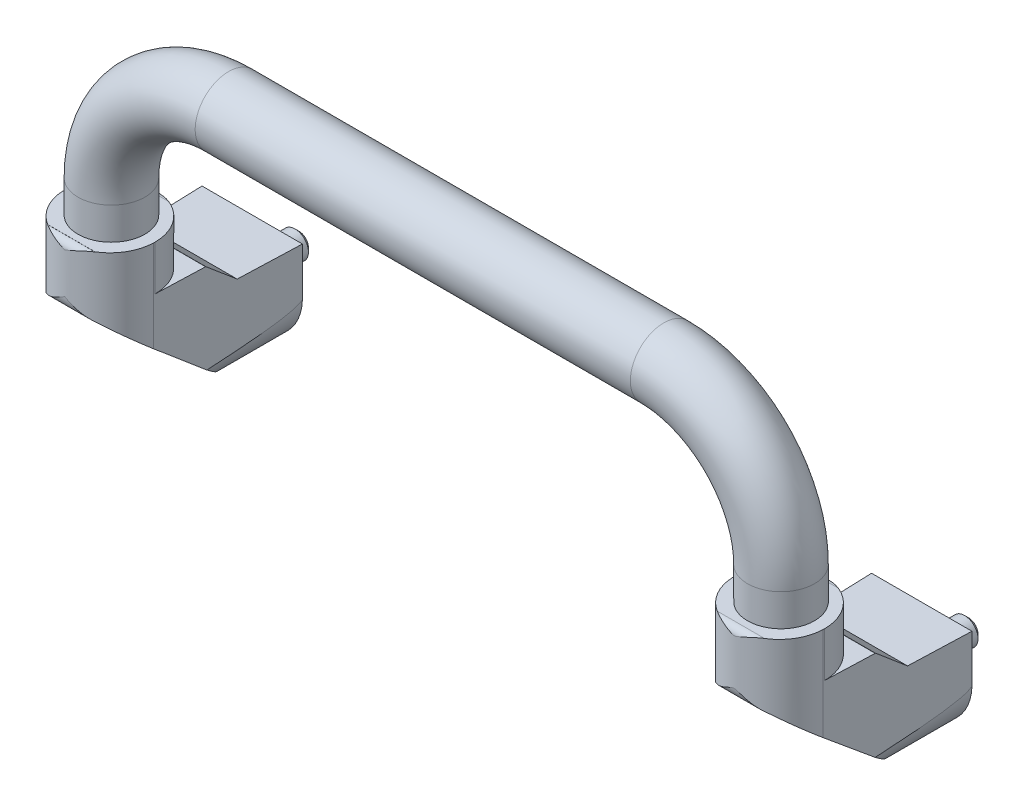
ISO-10303-21;
HEADER;
FILE_DESCRIPTION(('STEP AP214'),'2;1');
FILE_NAME('part.step','',(''),(''),'','','');
FILE_SCHEMA(('AUTOMOTIVE_DESIGN { 1 0 10303 214 1 1 1 1 }'));
ENDSEC;
DATA;
#1=APPLICATION_CONTEXT('core data for automotive mechanical design processes');
#2=APPLICATION_PROTOCOL_DEFINITION('international standard','automotive_design',2000,#1);
#3=PRODUCT_CONTEXT('',#1,'mechanical');
#4=PRODUCT('Part','Part','',(#3));
#5=PRODUCT_RELATED_PRODUCT_CATEGORY('part','',(#4));
#6=PRODUCT_DEFINITION_FORMATION('','',#4);
#7=PRODUCT_DEFINITION_CONTEXT('part definition',#1,'design');
#8=PRODUCT_DEFINITION('design','',#6,#7);
#9=PRODUCT_DEFINITION_SHAPE('','',#8);
#10=(LENGTH_UNIT() NAMED_UNIT(*) SI_UNIT(.MILLI.,.METRE.));
#11=(NAMED_UNIT(*) PLANE_ANGLE_UNIT() SI_UNIT($,.RADIAN.));
#12=(NAMED_UNIT(*) SI_UNIT($,.STERADIAN.) SOLID_ANGLE_UNIT());
#13=UNCERTAINTY_MEASURE_WITH_UNIT(LENGTH_MEASURE(1.E-05),#10,'distance_accuracy_value','');
#14=(GEOMETRIC_REPRESENTATION_CONTEXT(3) GLOBAL_UNCERTAINTY_ASSIGNED_CONTEXT((#13)) GLOBAL_UNIT_ASSIGNED_CONTEXT((#10,
#11,#12)) REPRESENTATION_CONTEXT('',''));
#15=CARTESIAN_POINT('',(0.,0.,0.));
#16=DIRECTION('',(0.,0.,1.));
#17=DIRECTION('',(1.,0.,0.));
#18=AXIS2_PLACEMENT_3D('',#15,#16,#17);
#19=CARTESIAN_POINT('',(14.5950313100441,35.,11.5380553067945));
#20=DIRECTION('',(-0.999384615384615,0.,-0.0350769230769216));
#21=DIRECTION('',(-0.0350769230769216,0.,0.999384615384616));
#22=AXIS2_PLACEMENT_3D('',#19,#20,#21);
#23=PLANE('',#22);
#24=DIRECTION('',(0.0350769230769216,0.,-0.999384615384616));
#25=VECTOR('',#24,1.);
#26=CARTESIAN_POINT('',(14.5950313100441,14.0068766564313,11.5380553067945));
#27=LINE('',#26,#25);
#28=CARTESIAN_POINT('',(14.339275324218,14.0068766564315,18.824857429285));
#29=VERTEX_POINT('',#28);
#30=CARTESIAN_POINT('',(15.,14.0068766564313,0.));
#31=VERTEX_POINT('',#30);
#32=EDGE_CURVE('E655',#29,#31,#27,.T.);
#33=ORIENTED_EDGE('',*,*,#32,.F.);
#34=DIRECTION('',(0.0268773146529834,-0.642555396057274,-0.76576770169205));
#35=VECTOR('',#34,1.);
#36=CARTESIAN_POINT('',(14.1268807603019,19.0845890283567,24.876239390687));
#37=LINE('',#36,#35);
#38=CARTESIAN_POINT('',(14.0194412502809,21.6531431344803,27.9373229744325));
#39=VERTEX_POINT('',#38);
#40=EDGE_CURVE('E649',#39,#29,#37,.T.);
#41=ORIENTED_EDGE('',*,*,#40,.F.);
#42=DIRECTION('',(0.,1.,0.));
#43=VECTOR('',#42,1.);
#44=CARTESIAN_POINT('',(14.0194412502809,35.,27.9373229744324));
#45=LINE('',#44,#43);
#46=CARTESIAN_POINT('',(14.0194412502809,21.6,27.9373229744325));
#47=VERTEX_POINT('',#46);
#48=EDGE_CURVE('E736',#47,#39,#45,.T.);
#49=ORIENTED_EDGE('',*,*,#48,.F.);
#50=DIRECTION('',(0.0350769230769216,0.,-0.999384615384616));
#51=VECTOR('',#50,1.);
#52=CARTESIAN_POINT('',(14.5950313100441,21.6,11.5380553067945));
#53=LINE('',#52,#51);
#54=CARTESIAN_POINT('',(13.5083128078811,21.6,42.5));
#55=VERTEX_POINT('',#54);
#56=EDGE_CURVE('E733',#55,#47,#53,.T.);
#57=ORIENTED_EDGE('',*,*,#56,.F.);
#58=DIRECTION('',(0.,1.,0.));
#59=VECTOR('',#58,1.);
#60=CARTESIAN_POINT('',(13.508312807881,35.,42.5));
#61=LINE('',#60,#59);
#62=CARTESIAN_POINT('',(13.508312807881,35.,42.5));
#63=VERTEX_POINT('',#62);
#64=EDGE_CURVE('E701',#55,#63,#61,.T.);
#65=ORIENTED_EDGE('',*,*,#64,.T.);
#66=DIRECTION('',(0.0350769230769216,0.,-0.999384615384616));
#67=VECTOR('',#66,1.);
#68=CARTESIAN_POINT('',(14.5950313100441,35.,11.5380553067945));
#69=LINE('',#68,#67);
#70=CARTESIAN_POINT('',(13.491692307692,35.,42.9735384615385));
#71=VERTEX_POINT('',#70);
#72=EDGE_CURVE('E322',#71,#63,#69,.T.);
#73=ORIENTED_EDGE('',*,*,#72,.F.);
#74=DIRECTION('',(0.,-1.,0.));
#75=VECTOR('',#74,1.);
#76=CARTESIAN_POINT('',(13.491692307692,35.,42.9735384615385));
#77=LINE('',#76,#75);
#78=CARTESIAN_POINT('',(13.491692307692,7.63348617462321,42.9735384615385));
#79=VERTEX_POINT('',#78);
#80=EDGE_CURVE('E334',#71,#79,#77,.T.);
#81=ORIENTED_EDGE('',*,*,#80,.T.);
#82=DIRECTION('',(0.0268773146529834,-0.642555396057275,-0.765767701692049));
#83=VECTOR('',#82,1.);
#84=CARTESIAN_POINT('',(13.6668633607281,3.44567549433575,37.9827000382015));
#85=LINE('',#84,#83);
#86=CARTESIAN_POINT('',(14.0326622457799,-5.29947075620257,27.5606405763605));
#87=VERTEX_POINT('',#86);
#88=EDGE_CURVE('E675',#79,#87,#85,.T.);
#89=ORIENTED_EDGE('',*,*,#88,.T.);
#90=CARTESIAN_POINT('',(0.,0.,427.36842105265));
#91=DIRECTION('',(-0.999384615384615,0.,-0.0350769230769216));
#92=DIRECTION('',(0.0350769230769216,0.,-0.999384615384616));
#93=AXIS2_PLACEMENT_3D('',#90,#91,#92);
#94=ELLIPSE('',#93,427.631578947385,15.);
#95=CARTESIAN_POINT('',(14.988671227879,-0.582867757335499,0.322770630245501));
#96=VERTEX_POINT('',#95);
#97=EDGE_CURVE('E308',#87,#96,#94,.F.);
#98=ORIENTED_EDGE('',*,*,#97,.T.);
#99=DIRECTION('',(0.0350769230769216,0.,-0.999384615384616));
#100=VECTOR('',#99,1.);
#101=CARTESIAN_POINT('',(14.5950313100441,-0.582867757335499,11.5380553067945));
#102=LINE('',#101,#100);
#103=CARTESIAN_POINT('',(15.,-0.582867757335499,0.));
#104=VERTEX_POINT('',#103);
#105=EDGE_CURVE('E310',#96,#104,#102,.T.);
#106=ORIENTED_EDGE('',*,*,#105,.T.);
#107=DIRECTION('',(0.,-1.,0.));
#108=VECTOR('',#107,1.);
#109=CARTESIAN_POINT('',(15.,35.,0.));
#110=LINE('',#109,#108);
#111=EDGE_CURVE('E332',#31,#104,#110,.T.);
#112=ORIENTED_EDGE('',*,*,#111,.F.);
#113=EDGE_LOOP('',(#33,#41,#49,#57,#65,#73,#81,#89,#98,#106,#112));
#114=FACE_BOUND('',#113,.T.);
#115=ADVANCED_FACE('F14',(#114),#23,.F.);
#116=CARTESIAN_POINT('',(0.,35.,0.));
#117=DIRECTION('',(0.,0.,-1.));
#118=DIRECTION('',(0.,-1.,0.));
#119=AXIS2_PLACEMENT_3D('',#116,#117,#118);
#120=PLANE('',#119);
#121=CARTESIAN_POINT('',(0.,0.,0.));
#122=DIRECTION('',(0.,0.,-1.));
#123=DIRECTION('',(0.,-1.,0.));
#124=AXIS2_PLACEMENT_3D('',#121,#122,#123);
#125=CIRCLE('',#124,3.99999999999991);
#126=CARTESIAN_POINT('',(0.,-3.99999999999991,0.));
#127=VERTEX_POINT('',#126);
#128=EDGE_CURVE('E734',#127,#127,#125,.T.);
#129=ORIENTED_EDGE('',*,*,#128,.F.);
#130=EDGE_LOOP('',(#129));
#131=FACE_BOUND('',#130,.T.);
#132=DIRECTION('',(0.,-1.,0.));
#133=VECTOR('',#132,1.);
#134=CARTESIAN_POINT('',(-15.,35.,0.));
#135=LINE('',#134,#133);
#136=CARTESIAN_POINT('',(-15.,14.0068766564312,-2.98589278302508E-12));
#137=VERTEX_POINT('',#136);
#138=CARTESIAN_POINT('',(-15.,-0.582867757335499,0.));
#139=VERTEX_POINT('',#138);
#140=EDGE_CURVE('E340',#137,#139,#135,.T.);
#141=ORIENTED_EDGE('',*,*,#140,.F.);
#142=DIRECTION('',(1.,0.,0.));
#143=VECTOR('',#142,1.);
#144=CARTESIAN_POINT('',(0.,14.0068766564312,0.));
#145=LINE('',#144,#143);
#146=EDGE_CURVE('E653',#137,#31,#145,.T.);
#147=ORIENTED_EDGE('',*,*,#146,.T.);
#148=ORIENTED_EDGE('',*,*,#111,.T.);
#149=DIRECTION('',(1.,0.,0.));
#150=VECTOR('',#149,1.);
#151=CARTESIAN_POINT('',(14.988671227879,-0.582867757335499,0.));
#152=LINE('',#151,#150);
#153=CARTESIAN_POINT('',(14.988671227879,-0.582867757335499,0.));
#154=VERTEX_POINT('',#153);
#155=EDGE_CURVE('E297',#154,#104,#152,.T.);
#156=ORIENTED_EDGE('',*,*,#155,.F.);
#157=CARTESIAN_POINT('',(0.,0.,0.));
#158=DIRECTION('',(0.,0.,1.));
#159=DIRECTION('',(0.,-1.,0.));
#160=AXIS2_PLACEMENT_3D('',#157,#158,#159);
#161=CIRCLE('',#160,15.);
#162=CARTESIAN_POINT('',(-14.98867122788,-0.582867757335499,0.));
#163=VERTEX_POINT('',#162);
#164=EDGE_CURVE('E292',#163,#154,#161,.T.);
#165=ORIENTED_EDGE('',*,*,#164,.F.);
#166=DIRECTION('',(-1.,0.,0.));
#167=VECTOR('',#166,1.);
#168=CARTESIAN_POINT('',(-14.98867122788,-0.582867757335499,0.));
#169=LINE('',#168,#167);
#170=EDGE_CURVE('E294',#163,#139,#169,.T.);
#171=ORIENTED_EDGE('',*,*,#170,.T.);
#172=EDGE_LOOP('',(#141,#147,#148,#156,#165,#171));
#173=FACE_BOUND('',#172,.T.);
#174=ADVANCED_FACE('F564',(#131,#173),#120,.T.);
#175=CARTESIAN_POINT('',(0.,35.,42.5));
#176=DIRECTION('',(0.,1.,0.));
#177=DIRECTION('',(1.,0.,0.));
#178=AXIS2_PLACEMENT_3D('',#175,#176,#177);
#179=PLANE('',#178);
#180=CARTESIAN_POINT('',(-0.0396757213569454,35.,41.9999909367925));
#181=DIRECTION('',(0.,1.,0.));
#182=DIRECTION('',(-1.,0.,0.));
#183=AXIS2_PLACEMENT_3D('',#180,#181,#182);
#184=CIRCLE('',#183,10.);
#185=CARTESIAN_POINT('',(-10.0396757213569,35.,41.9999909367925));
#186=VERTEX_POINT('',#185);
#187=EDGE_CURVE('E342',#186,#186,#184,.T.);
#188=ORIENTED_EDGE('',*,*,#187,.F.);
#189=EDGE_LOOP('',(#188));
#190=FACE_BOUND('',#189,.T.);
#191=CARTESIAN_POINT('',(0.,35.,42.5));
#192=DIRECTION('',(0.,-1.,0.));
#193=DIRECTION('',(1.,0.,0.));
#194=AXIS2_PLACEMENT_3D('',#191,#192,#193);
#195=CIRCLE('',#194,13.5);
#196=CARTESIAN_POINT('',(5.09901951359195,35.,30.));
#197=VERTEX_POINT('',#196);
#198=CARTESIAN_POINT('',(13.5,35.,42.5));
#199=VERTEX_POINT('',#198);
#200=EDGE_CURVE('E257',#197,#199,#195,.T.);
#201=ORIENTED_EDGE('',*,*,#200,.F.);
#202=DIRECTION('',(1.,0.,0.));
#203=VECTOR('',#202,1.);
#204=CARTESIAN_POINT('',(-15.,35.,30.));
#205=LINE('',#204,#203);
#206=CARTESIAN_POINT('',(-5.09901951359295,35.,30.));
#207=VERTEX_POINT('',#206);
#208=EDGE_CURVE('E36',#207,#197,#205,.T.);
#209=ORIENTED_EDGE('',*,*,#208,.F.);
#210=CARTESIAN_POINT('',(-13.5,35.,42.5));
#211=VERTEX_POINT('',#210);
#212=EDGE_CURVE('E255',#211,#207,#195,.T.);
#213=ORIENTED_EDGE('',*,*,#212,.F.);
#214=DIRECTION('',(1.,0.,0.));
#215=VECTOR('',#214,1.);
#216=CARTESIAN_POINT('',(-14.98867122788,35.,42.5));
#217=LINE('',#216,#215);
#218=CARTESIAN_POINT('',(-13.508312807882,35.,42.5));
#219=VERTEX_POINT('',#218);
#220=EDGE_CURVE('E265',#219,#211,#217,.T.);
#221=ORIENTED_EDGE('',*,*,#220,.F.);
#222=DIRECTION('',(0.0350769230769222,0.,0.999384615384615));
#223=VECTOR('',#222,1.);
#224=CARTESIAN_POINT('',(-14.595031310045,35.,11.5380553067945));
#225=LINE('',#224,#223);
#226=CARTESIAN_POINT('',(-13.491692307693,35.,42.9735384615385));
#227=VERTEX_POINT('',#226);
#228=EDGE_CURVE('E329',#219,#227,#225,.T.);
#229=ORIENTED_EDGE('',*,*,#228,.T.);
#230=CARTESIAN_POINT('',(0.,35.,42.5));
#231=DIRECTION('',(0.,-1.,0.));
#232=DIRECTION('',(1.,0.,0.));
#233=AXIS2_PLACEMENT_3D('',#230,#231,#232);
#234=CIRCLE('',#233,13.5);
#235=CARTESIAN_POINT('',(-7.07092481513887,35.,54.000087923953));
#236=VERTEX_POINT('',#235);
#237=EDGE_CURVE('E325',#236,#227,#234,.T.);
#238=ORIENTED_EDGE('',*,*,#237,.F.);
#239=DIRECTION('',(-1.,0.,0.));
#240=VECTOR('',#239,1.);
#241=CARTESIAN_POINT('',(0.,35.,54.000087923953));
#242=LINE('',#241,#240);
#243=CARTESIAN_POINT('',(7.07092481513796,35.,54.000087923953));
#244=VERTEX_POINT('',#243);
#245=EDGE_CURVE('E598',#244,#236,#242,.T.);
#246=ORIENTED_EDGE('',*,*,#245,.F.);
#247=EDGE_CURVE('E326',#71,#244,#234,.T.);
#248=ORIENTED_EDGE('',*,*,#247,.F.);
#249=ORIENTED_EDGE('',*,*,#72,.T.);
#250=DIRECTION('',(1.,0.,0.));
#251=VECTOR('',#250,1.);
#252=CARTESIAN_POINT('',(13.5,35.,42.5));
#253=LINE('',#252,#251);
#254=EDGE_CURVE('E267',#199,#63,#253,.T.);
#255=ORIENTED_EDGE('',*,*,#254,.F.);
#256=EDGE_LOOP('',(#201,#209,#213,#221,#229,#238,#246,#248,#249,#255));
#257=FACE_BOUND('',#256,.T.);
#258=ADVANCED_FACE('F253',(#190,#257),#179,.T.);
#259=CARTESIAN_POINT('',(-14.595031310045,35.,11.5380553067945));
#260=DIRECTION('',(0.999384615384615,0.,-0.0350769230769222));
#261=DIRECTION('',(-0.0350769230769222,0.,-0.999384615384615));
#262=AXIS2_PLACEMENT_3D('',#259,#260,#261);
#263=PLANE('',#262);
#264=DIRECTION('',(0.0350769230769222,0.,0.999384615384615));
#265=VECTOR('',#264,1.);
#266=CARTESIAN_POINT('',(-14.595031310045,14.0068766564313,11.5380553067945));
#267=LINE('',#266,#265);
#268=CARTESIAN_POINT('',(-14.3392753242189,14.0068766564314,18.824857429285));
#269=VERTEX_POINT('',#268);
#270=EDGE_CURVE('E9',#137,#269,#267,.T.);
#271=ORIENTED_EDGE('',*,*,#270,.F.);
#272=ORIENTED_EDGE('',*,*,#140,.T.);
#273=DIRECTION('',(-0.0350769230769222,0.,-0.999384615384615));
#274=VECTOR('',#273,1.);
#275=CARTESIAN_POINT('',(-14.595031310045,-0.582867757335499,11.5380553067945));
#276=LINE('',#275,#274);
#277=CARTESIAN_POINT('',(-14.98867122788,-0.5828677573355,0.322770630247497));
#278=VERTEX_POINT('',#277);
#279=EDGE_CURVE('E313',#278,#139,#276,.T.);
#280=ORIENTED_EDGE('',*,*,#279,.F.);
#281=CARTESIAN_POINT('',(0.,0.,427.36842105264));
#282=DIRECTION('',(0.999384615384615,0.,-0.0350769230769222));
#283=DIRECTION('',(-0.0350769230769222,0.,-0.999384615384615));
#284=AXIS2_PLACEMENT_3D('',#281,#282,#283);
#285=ELLIPSE('',#284,427.631578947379,15.);
#286=CARTESIAN_POINT('',(-14.0326622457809,-5.29947075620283,27.5606405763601));
#287=VERTEX_POINT('',#286);
#288=EDGE_CURVE('E305',#278,#287,#285,.F.);
#289=ORIENTED_EDGE('',*,*,#288,.T.);
#290=DIRECTION('',(0.0268773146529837,0.642555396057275,0.765767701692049));
#291=VECTOR('',#290,1.);
#292=CARTESIAN_POINT('',(-13.6668633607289,3.4456754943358,37.9827000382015));
#293=LINE('',#292,#291);
#294=CARTESIAN_POINT('',(-13.491692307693,7.6334861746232,42.9735384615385));
#295=VERTEX_POINT('',#294);
#296=EDGE_CURVE('E672',#287,#295,#293,.T.);
#297=ORIENTED_EDGE('',*,*,#296,.T.);
#298=DIRECTION('',(0.,-1.,0.));
#299=VECTOR('',#298,1.);
#300=CARTESIAN_POINT('',(-13.491692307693,35.,42.9735384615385));
#301=LINE('',#300,#299);
#302=EDGE_CURVE('E337',#227,#295,#301,.T.);
#303=ORIENTED_EDGE('',*,*,#302,.F.);
#304=ORIENTED_EDGE('',*,*,#228,.F.);
#305=DIRECTION('',(0.,-1.,0.));
#306=VECTOR('',#305,1.);
#307=CARTESIAN_POINT('',(-13.508312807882,35.,42.5));
#308=LINE('',#307,#306);
#309=CARTESIAN_POINT('',(-13.508312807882,21.6,42.5));
#310=VERTEX_POINT('',#309);
#311=EDGE_CURVE('E693',#219,#310,#308,.T.);
#312=ORIENTED_EDGE('',*,*,#311,.T.);
#313=DIRECTION('',(0.0350769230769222,0.,0.999384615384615));
#314=VECTOR('',#313,1.);
#315=CARTESIAN_POINT('',(-14.595031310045,21.6,11.5380553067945));
#316=LINE('',#315,#314);
#317=CARTESIAN_POINT('',(-14.019441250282,21.6,27.9373229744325));
#318=VERTEX_POINT('',#317);
#319=EDGE_CURVE('E288',#318,#310,#316,.T.);
#320=ORIENTED_EDGE('',*,*,#319,.F.);
#321=DIRECTION('',(0.,-1.,0.));
#322=VECTOR('',#321,1.);
#323=CARTESIAN_POINT('',(-14.019441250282,35.,27.9373229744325));
#324=LINE('',#323,#322);
#325=CARTESIAN_POINT('',(-14.019441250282,21.6531431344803,27.9373229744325));
#326=VERTEX_POINT('',#325);
#327=EDGE_CURVE('E290',#326,#318,#324,.T.);
#328=ORIENTED_EDGE('',*,*,#327,.F.);
#329=DIRECTION('',(0.0268773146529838,0.642555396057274,0.76576770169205));
#330=VECTOR('',#329,1.);
#331=CARTESIAN_POINT('',(-14.1268807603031,19.0845890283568,24.8762393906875));
#332=LINE('',#331,#330);
#333=EDGE_CURVE('E29',#269,#326,#332,.T.);
#334=ORIENTED_EDGE('',*,*,#333,.F.);
#335=EDGE_LOOP('',(#271,#272,#280,#289,#297,#303,#304,#312,#320,#328,#334));
#336=FACE_BOUND('',#335,.T.);
#337=ADVANCED_FACE('F583',(#336),#263,.F.);
#338=CARTESIAN_POINT('',(-14.98867122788,21.6,27.9373229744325));
#339=DIRECTION('',(0.,0.,1.));
#340=DIRECTION('',(0.,1.,0.));
#341=AXIS2_PLACEMENT_3D('',#338,#339,#340);
#342=PLANE('',#341);
#343=ORIENTED_EDGE('',*,*,#48,.T.);
#344=DIRECTION('',(-1.,0.,0.));
#345=VECTOR('',#344,1.);
#346=CARTESIAN_POINT('',(-14.98867122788,21.6531431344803,27.9373229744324));
#347=LINE('',#346,#345);
#348=EDGE_CURVE('E22',#39,#326,#347,.T.);
#349=ORIENTED_EDGE('',*,*,#348,.T.);
#350=ORIENTED_EDGE('',*,*,#327,.T.);
#351=DIRECTION('',(1.,0.,0.));
#352=VECTOR('',#351,1.);
#353=CARTESIAN_POINT('',(-14.98867122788,21.6,27.9373229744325));
#354=LINE('',#353,#352);
#355=EDGE_CURVE('E279',#318,#47,#354,.T.);
#356=ORIENTED_EDGE('',*,*,#355,.T.);
#357=EDGE_LOOP('',(#343,#349,#350,#356));
#358=FACE_BOUND('',#357,.T.);
#359=ADVANCED_FACE('F581',(#358),#342,.T.);
#360=CARTESIAN_POINT('',(0.,35.,42.5));
#361=DIRECTION('',(0.,-1.,0.));
#362=DIRECTION('',(1.,0.,0.));
#363=AXIS2_PLACEMENT_3D('',#360,#361,#362);
#364=CYLINDRICAL_SURFACE('',#363,13.5);
#365=DIRECTION('',(0.,-1.,0.));
#366=VECTOR('',#365,1.);
#367=CARTESIAN_POINT('',(7.07092481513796,35.,54.000087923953));
#368=LINE('',#367,#366);
#369=CARTESIAN_POINT('',(7.07092481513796,34.9704219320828,54.000087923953));
#370=VERTEX_POINT('',#369);
#371=EDGE_CURVE('E682',#370,#244,#368,.F.);
#372=ORIENTED_EDGE('',*,*,#371,.F.);
#373=CARTESIAN_POINT('',(-7.07092481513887,34.9704219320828,54.000087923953));
#374=CARTESIAN_POINT('',(-6.87750374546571,34.9704282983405,54.1190115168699));
#375=CARTESIAN_POINT('',(-6.68105374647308,34.959869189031,54.2330583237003));
#376=CARTESIAN_POINT('',(-6.28381350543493,34.9221612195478,54.450527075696));
#377=CARTESIAN_POINT('',(-6.08301891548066,34.8949949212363,54.5539377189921));
#378=CARTESIAN_POINT('',(-5.6770713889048,34.8272761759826,54.7503886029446));
#379=CARTESIAN_POINT('',(-5.47189888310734,34.7866398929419,54.8433588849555));
#380=CARTESIAN_POINT('',(-5.0593139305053,34.694757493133,55.0181285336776));
#381=CARTESIAN_POINT('',(-4.851902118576,34.6435143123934,55.09993098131));
#382=CARTESIAN_POINT('',(-4.36508724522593,34.5138570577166,55.2782623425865));
#383=CARTESIAN_POINT('',(-4.08498441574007,34.4321066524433,55.3704604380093));
#384=CARTESIAN_POINT('',(-3.52253018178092,34.2574892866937,55.5356338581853));
#385=CARTESIAN_POINT('',(-3.24017788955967,34.1646177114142,55.6086011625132));
#386=CARTESIAN_POINT('',(-2.67652768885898,33.9718090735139,55.7351381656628));
#387=CARTESIAN_POINT('',(-2.39524290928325,33.8719425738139,55.7888753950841));
#388=CARTESIAN_POINT('',(-1.8318438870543,33.6670280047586,55.8781780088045));
#389=CARTESIAN_POINT('',(-1.5497301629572,33.5619827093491,55.9137530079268));
#390=CARTESIAN_POINT('',(-1.17146433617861,33.4192935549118,55.9494219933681));
#391=CARTESIAN_POINT('',(-1.07551786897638,33.3829421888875,55.9574338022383));
#392=CARTESIAN_POINT('',(-0.8835134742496,33.3099862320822,55.9714019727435));
#393=CARTESIAN_POINT('',(-0.787455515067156,33.2733815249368,55.9773573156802));
#394=CARTESIAN_POINT('',(-0.593228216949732,33.1991990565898,55.9873180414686));
#395=CARTESIAN_POINT('',(-0.495058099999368,33.1616173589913,55.9912785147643));
#396=CARTESIAN_POINT('',(-0.347759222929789,33.1055246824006,55.9956090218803));
#397=CARTESIAN_POINT('',(-0.298700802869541,33.0868920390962,55.996783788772));
#398=CARTESIAN_POINT('',(-0.200553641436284,33.0496905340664,55.998599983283));
#399=CARTESIAN_POINT('',(-0.151464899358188,33.0311216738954,55.9992413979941));
#400=CARTESIAN_POINT('',(-0.084987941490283,33.0080155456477,55.9997430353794));
#401=CARTESIAN_POINT('',(-0.0680493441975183,33.0023025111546,55.9998394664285));
#402=CARTESIAN_POINT('',(-0.0424994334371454,32.9952097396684,55.9999356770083));
#403=CARTESIAN_POINT('',(-0.0341004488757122,32.9931150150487,55.9999596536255));
#404=CARTESIAN_POINT('',(-0.0171291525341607,32.9901026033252,55.9999917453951));
#405=CARTESIAN_POINT('',(-0.00855921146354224,32.9891740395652,56.0000000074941));
#406=CARTESIAN_POINT('',(0.00879402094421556,32.9891765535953,55.9999999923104));
#407=CARTESIAN_POINT('',(0.0175772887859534,32.9901547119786,55.9999912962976));
#408=CARTESIAN_POINT('',(0.0349664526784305,32.9933005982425,55.9999575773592));
#409=CARTESIAN_POINT('',(0.0435697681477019,32.9954798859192,55.999932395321));
#410=CARTESIAN_POINT('',(0.0697279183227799,33.002831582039,55.9998314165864));
#411=CARTESIAN_POINT('',(0.0870672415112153,33.0087214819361,55.9997302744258));
#412=CARTESIAN_POINT('',(0.171095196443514,33.038014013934,55.9990808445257));
#413=CARTESIAN_POINT('',(0.237058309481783,33.0633144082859,55.9980811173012));
#414=CARTESIAN_POINT('',(0.367738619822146,33.1132270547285,55.9951443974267));
#415=CARTESIAN_POINT('',(0.432454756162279,33.1378430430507,55.9932262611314));
#416=CARTESIAN_POINT('',(0.627360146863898,33.2121316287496,55.9860459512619));
#417=CARTESIAN_POINT('',(0.757454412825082,33.2619227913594,55.9793646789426));
#418=CARTESIAN_POINT('',(1.01760396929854,33.3610278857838,55.9622233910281));
#419=CARTESIAN_POINT('',(1.14765924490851,33.4103417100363,55.9517625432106));
#420=CARTESIAN_POINT('',(1.54015609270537,33.558312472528,55.9144503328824));
#421=CARTESIAN_POINT('',(1.80241871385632,33.6560305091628,55.8817605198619));
#422=CARTESIAN_POINT('',(2.39427723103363,33.8719079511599,55.7901814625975));
#423=CARTESIAN_POINT('',(2.72364690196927,33.9887746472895,55.7266896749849));
#424=CARTESIAN_POINT('',(3.38052871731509,34.2114954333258,55.574242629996));
#425=CARTESIAN_POINT('',(3.70803931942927,34.3173413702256,55.4852687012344));
#426=CARTESIAN_POINT('',(4.35819027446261,34.5122628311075,55.2816858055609));
#427=CARTESIAN_POINT('',(4.68084736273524,34.6014256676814,55.1672175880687));
#428=CARTESIAN_POINT('',(5.16087542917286,34.7178726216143,54.9757774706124));
#429=CARTESIAN_POINT('',(5.32015518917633,34.7537932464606,54.9087086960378));
#430=CARTESIAN_POINT('',(5.63716070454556,34.8187750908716,54.7679448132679));
#431=CARTESIAN_POINT('',(5.79488691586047,34.8478383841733,54.6942517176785));
#432=CARTESIAN_POINT('',(6.06000533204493,34.890081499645,54.564034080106));
#433=CARTESIAN_POINT('',(6.16790737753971,34.9053950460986,54.5092308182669));
#434=CARTESIAN_POINT('',(6.3826151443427,34.9315949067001,54.3965087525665));
#435=CARTESIAN_POINT('',(6.48942096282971,34.9424816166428,54.3385902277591));
#436=CARTESIAN_POINT('',(6.70186294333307,34.959243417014,54.2196361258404));
#437=CARTESIAN_POINT('',(6.80749751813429,34.9651123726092,54.1585968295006));
#438=CARTESIAN_POINT('',(7.01720095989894,34.9711201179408,54.033593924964));
#439=CARTESIAN_POINT('',(7.12126983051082,34.9712589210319,53.9696303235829));
#440=CARTESIAN_POINT('',(7.32838648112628,34.9649685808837,53.8384260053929));
#441=CARTESIAN_POINT('',(7.43141794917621,34.9584833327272,53.771161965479));
#442=CARTESIAN_POINT('',(7.63511779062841,34.9378853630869,53.6341833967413));
#443=CARTESIAN_POINT('',(7.73578568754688,34.923771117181,53.5644683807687));
#444=CARTESIAN_POINT('',(7.93394129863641,34.8868175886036,53.4232476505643));
#445=CARTESIAN_POINT('',(8.03143518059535,34.8639964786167,53.3517459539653));
#446=CARTESIAN_POINT('',(8.22260264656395,34.808343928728,53.2076198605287));
#447=CARTESIAN_POINT('',(8.3162787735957,34.7755192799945,53.1349962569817));
#448=CARTESIAN_POINT('',(8.51057580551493,34.6934220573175,52.9803342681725));
#449=CARTESIAN_POINT('',(8.61054102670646,34.6425773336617,52.8982859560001));
#450=CARTESIAN_POINT('',(8.80216710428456,34.5239909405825,52.7365776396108));
#451=CARTESIAN_POINT('',(8.89383372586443,34.4562611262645,52.6569160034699));
#452=CARTESIAN_POINT('',(9.05162034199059,34.3145923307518,52.5163590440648));
#453=CARTESIAN_POINT('',(9.11946043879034,34.2435185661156,52.4545352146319));
#454=CARTESIAN_POINT('',(9.2447662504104,34.087467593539,52.3382710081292));
#455=CARTESIAN_POINT('',(9.30224701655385,34.0025109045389,52.2838199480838));
#456=CARTESIAN_POINT('',(9.39284210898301,33.8391516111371,52.1967822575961));
#457=CARTESIAN_POINT('',(9.4285367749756,33.7633500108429,52.1620164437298));
#458=CARTESIAN_POINT('',(9.4902787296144,33.6045451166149,52.1013794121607));
#459=CARTESIAN_POINT('',(9.51633106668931,33.5215456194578,52.0755035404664));
#460=CARTESIAN_POINT('',(9.55753005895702,33.3497074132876,52.0343845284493));
#461=CARTESIAN_POINT('',(9.57260589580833,33.260834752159,52.0192104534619));
#462=CARTESIAN_POINT('',(9.59060313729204,33.0806412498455,52.0010792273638));
#463=CARTESIAN_POINT('',(9.59353024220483,32.9893215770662,51.9981163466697));
#464=CARTESIAN_POINT('',(9.58739700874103,32.8171715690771,52.0043054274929));
#465=CARTESIAN_POINT('',(9.57956343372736,32.7362469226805,52.0122176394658));
#466=CARTESIAN_POINT('',(9.5544571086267,32.5774089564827,52.0374347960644));
#467=CARTESIAN_POINT('',(9.53718461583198,32.499495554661,52.0547394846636));
#468=CARTESIAN_POINT('',(9.49381006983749,32.3477345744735,52.0978384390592));
#469=CARTESIAN_POINT('',(9.46761759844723,32.2739380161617,52.1237195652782));
#470=CARTESIAN_POINT('',(9.4075515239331,32.1325392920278,52.1824450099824));
#471=CARTESIAN_POINT('',(9.37367436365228,32.0649400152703,52.2152925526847));
#472=CARTESIAN_POINT('',(9.28309871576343,31.9085063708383,52.3020150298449));
#473=CARTESIAN_POINT('',(9.22289796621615,31.8233081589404,52.3588047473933));
#474=CARTESIAN_POINT('',(9.09201649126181,31.6673398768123,52.4796404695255));
#475=CARTESIAN_POINT('',(9.02131423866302,31.5966001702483,52.5437013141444));
#476=CARTESIAN_POINT('',(8.83971629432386,31.4412059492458,52.7043937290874));
#477=CARTESIAN_POINT('',(8.72463129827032,31.3636956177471,52.8031628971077));
#478=CARTESIAN_POINT('',(8.48328068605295,31.2326908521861,53.0027921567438));
#479=CARTESIAN_POINT('',(8.35699456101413,31.179241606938,53.1036558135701));
#480=CARTESIAN_POINT('',(8.12310761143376,31.1012155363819,53.2834270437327));
#481=CARTESIAN_POINT('',(8.01691189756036,31.0729815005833,53.3626386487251));
#482=CARTESIAN_POINT('',(7.80064869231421,31.027444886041,53.5189695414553));
#483=CARTESIAN_POINT('',(7.69057893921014,31.0101488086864,53.5960875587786));
#484=CARTESIAN_POINT('',(7.46735068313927,30.9849468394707,53.747528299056));
#485=CARTESIAN_POINT('',(7.35418900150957,30.9770510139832,53.8218479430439));
#486=CARTESIAN_POINT('',(7.1254687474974,30.9693699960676,53.9671737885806));
#487=CARTESIAN_POINT('',(7.00990934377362,30.9695876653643,54.0381788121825));
#488=CARTESIAN_POINT('',(6.6942034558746,30.9796506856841,54.2256662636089));
#489=CARTESIAN_POINT('',(6.49219751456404,30.9962153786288,54.3386830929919));
#490=CARTESIAN_POINT('',(6.08416654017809,31.0453499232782,54.553471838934));
#491=CARTESIAN_POINT('',(5.87813877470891,31.0779310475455,54.6552357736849));
#492=CARTESIAN_POINT('',(5.46253603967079,31.1558917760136,54.8476027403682));
#493=CARTESIAN_POINT('',(5.25295184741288,31.2013118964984,54.9381691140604));
#494=CARTESIAN_POINT('',(4.83167592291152,31.3022724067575,55.1077942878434));
#495=CARTESIAN_POINT('',(4.61998458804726,31.3578109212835,55.1868552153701));
#496=CARTESIAN_POINT('',(4.13829353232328,31.4928100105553,55.3532339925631));
#497=CARTESIAN_POINT('',(3.8677944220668,31.574700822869,55.4371341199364));
#498=CARTESIAN_POINT('',(3.3249023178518,31.7480204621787,55.5871836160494));
#499=CARTESIAN_POINT('',(3.05250878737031,31.8394521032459,55.6533277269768));
#500=CARTESIAN_POINT('',(2.50838879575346,32.0284631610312,55.7678081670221));
#501=CARTESIAN_POINT('',(2.23667121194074,32.1259945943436,55.8162669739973));
#502=CARTESIAN_POINT('',(1.69251556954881,32.3255150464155,55.8963048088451));
#503=CARTESIAN_POINT('',(1.42007787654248,32.4275021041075,55.9278911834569));
#504=CARTESIAN_POINT('',(1.05943377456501,32.563997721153,55.9586551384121));
#505=CARTESIAN_POINT('',(0.971407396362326,32.5974308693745,55.965294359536));
#506=CARTESIAN_POINT('',(0.795276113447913,32.664494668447,55.9768441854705));
#507=CARTESIAN_POINT('',(0.707171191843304,32.6981253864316,55.9817541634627));
#508=CARTESIAN_POINT('',(0.574252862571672,32.7488848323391,55.9878553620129));
#509=CARTESIAN_POINT('',(0.52946012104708,32.7659944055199,55.9896878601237));
#510=CARTESIAN_POINT('',(0.439859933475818,32.8002299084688,55.9929068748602));
#511=CARTESIAN_POINT('',(0.395052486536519,32.8173558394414,55.9942933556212));
#512=CARTESIAN_POINT('',(0.305429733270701,32.8514111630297,55.9966185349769));
#513=CARTESIAN_POINT('',(0.260614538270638,32.8683408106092,55.9975578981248));
#514=CARTESIAN_POINT('',(0.170992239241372,32.9022294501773,55.9989921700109));
#515=CARTESIAN_POINT('',(0.126185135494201,32.9191884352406,55.9994871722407));
#516=CARTESIAN_POINT('',(0.0673393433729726,32.9385313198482,55.9998385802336));
#517=CARTESIAN_POINT('',(0.0539644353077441,32.9427370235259,55.999899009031));
#518=CARTESIAN_POINT('',(0.0337306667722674,32.9476947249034,55.9999594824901));
#519=CARTESIAN_POINT('',(0.0270488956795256,32.9491116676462,55.9999746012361));
#520=CARTESIAN_POINT('',(0.0135759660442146,32.9510967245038,55.9999948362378));
#521=CARTESIAN_POINT('',(0.00678553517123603,32.9516691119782,56.000000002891));
#522=CARTESIAN_POINT('',(-0.00692023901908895,32.9516680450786,55.9999999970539));
#523=CARTESIAN_POINT('',(-0.0138355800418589,32.9510732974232,55.9999946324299));
#524=CARTESIAN_POINT('',(-0.02755367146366,32.9490209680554,55.9999736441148));
#525=CARTESIAN_POINT('',(-0.0343556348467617,32.947558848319,55.9999579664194));
#526=CARTESIAN_POINT('',(-0.0549419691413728,32.94245796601,55.999895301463));
#527=CARTESIAN_POINT('',(-0.0685452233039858,32.9381473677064,55.9998327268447));
#528=CARTESIAN_POINT('',(-0.137339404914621,32.915460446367,55.9994146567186));
#529=CARTESIAN_POINT('',(-0.191635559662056,32.8946356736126,55.9987504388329));
#530=CARTESIAN_POINT('',(-0.299452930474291,32.8535542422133,55.9967831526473));
#531=CARTESIAN_POINT('',(-0.352973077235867,32.8332937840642,55.9954901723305));
#532=CARTESIAN_POINT('',(-0.51391004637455,32.7721117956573,55.9906445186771));
#533=CARTESIAN_POINT('',(-0.621219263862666,32.7309705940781,55.9861281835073));
#534=CARTESIAN_POINT('',(-0.835826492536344,32.6489898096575,55.9745286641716));
#535=CARTESIAN_POINT('',(-0.943124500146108,32.6081502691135,55.967445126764));
#536=CARTESIAN_POINT('',(-1.26653114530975,32.4854908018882,55.9422069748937));
#537=CARTESIAN_POINT('',(-1.48252415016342,32.4041563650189,55.9201133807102));
#538=CARTESIAN_POINT('',(-2.0531065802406,32.1922671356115,55.8477580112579));
#539=CARTESIAN_POINT('',(-2.4073649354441,32.0637495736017,55.7885189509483));
#540=CARTESIAN_POINT('',(-3.11404692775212,31.8178919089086,55.6408966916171));
#541=CARTESIAN_POINT('',(-3.46646876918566,31.7005613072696,55.5524889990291));
#542=CARTESIAN_POINT('',(-4.16746062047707,31.4833378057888,55.3458337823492));
#543=CARTESIAN_POINT('',(-4.51603625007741,31.3834150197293,55.2276382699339));
#544=CARTESIAN_POINT('',(-5.03457491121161,31.2526265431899,55.0274642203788));
#545=CARTESIAN_POINT('',(-5.2066243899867,31.2122268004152,54.9569626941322));
#546=CARTESIAN_POINT('',(-5.54900117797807,31.1391058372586,54.8082653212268));
#547=CARTESIAN_POINT('',(-5.71932895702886,31.1063824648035,54.7300716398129));
#548=CARTESIAN_POINT('',(-6.05789214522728,31.0501830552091,54.5659581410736));
#549=CARTESIAN_POINT('',(-6.22612665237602,31.0267108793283,54.480035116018));
#550=CARTESIAN_POINT('',(-6.55983624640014,30.9910136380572,54.3006114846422));
#551=CARTESIAN_POINT('',(-6.72531058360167,30.978791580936,54.2071088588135));
#552=CARTESIAN_POINT('',(-7.05166813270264,30.9681285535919,54.013460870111));
#553=CARTESIAN_POINT('',(-7.21257096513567,30.9696151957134,53.9133531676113));
#554=CARTESIAN_POINT('',(-7.52921914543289,30.9893042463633,53.7069833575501));
#555=CARTESIAN_POINT('',(-7.68497020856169,31.0074874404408,53.6007284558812));
#556=CARTESIAN_POINT('',(-7.96520055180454,31.0599487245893,53.4009313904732));
#557=CARTESIAN_POINT('',(-8.09070943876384,31.0912019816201,53.3080599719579));
#558=CARTESIAN_POINT('',(-8.33518178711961,31.171254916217,53.120661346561));
#559=CARTESIAN_POINT('',(-8.45413646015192,31.2200775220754,53.0261321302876));
#560=CARTESIAN_POINT('',(-8.68395719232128,31.3392533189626,52.8373706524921));
#561=CARTESIAN_POINT('',(-8.7947139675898,31.4098486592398,52.7431544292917));
#562=CARTESIAN_POINT('',(-9.00217867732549,31.5758213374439,52.561293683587));
#563=CARTESIAN_POINT('',(-9.09893281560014,31.6711141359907,52.4736280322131));
#564=CARTESIAN_POINT('',(-9.23879434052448,31.8463568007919,52.3437817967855));
#565=CARTESIAN_POINT('',(-9.28817710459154,31.9179858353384,52.2971229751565));
#566=CARTESIAN_POINT('',(-9.37762994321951,32.0711185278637,52.2115327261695));
#567=CARTESIAN_POINT('',(-9.41770381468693,32.1526181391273,52.1725981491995));
#568=CARTESIAN_POINT('',(-9.48688680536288,32.3251423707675,52.1047578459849));
#569=CARTESIAN_POINT('',(-9.51588964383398,32.4162491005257,52.0759495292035));
#570=CARTESIAN_POINT('',(-9.56048639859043,32.6047461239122,52.0314280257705));
#571=CARTESIAN_POINT('',(-9.57609448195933,32.7021296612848,52.0157010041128));
#572=CARTESIAN_POINT('',(-9.59162429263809,32.8858851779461,52.0000441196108));
#573=CARTESIAN_POINT('',(-9.59339475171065,32.9719479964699,51.9982526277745));
#574=CARTESIAN_POINT('',(-9.58599731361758,33.1431030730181,52.0057185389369));
#575=CARTESIAN_POINT('',(-9.57683219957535,33.2281955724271,52.0149731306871));
#576=CARTESIAN_POINT('',(-9.54901245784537,33.3895386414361,52.0428879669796));
#577=CARTESIAN_POINT('',(-9.53098605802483,33.4660095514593,52.0609248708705));
#578=CARTESIAN_POINT('',(-9.48665037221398,33.6140818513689,52.1049172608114));
#579=CARTESIAN_POINT('',(-9.46033984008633,33.6856825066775,52.1308739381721));
#580=CARTESIAN_POINT('',(-9.39781448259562,33.828959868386,52.1919112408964));
#581=CARTESIAN_POINT('',(-9.36092955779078,33.9000833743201,52.2275957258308));
#582=CARTESIAN_POINT('',(-9.27994226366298,34.0345276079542,52.3048874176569));
#583=CARTESIAN_POINT('',(-9.23583574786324,34.0978438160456,52.346498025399));
#584=CARTESIAN_POINT('',(-9.11466106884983,34.2505440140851,52.4590709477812));
#585=CARTESIAN_POINT('',(-9.03317781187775,34.334101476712,52.5331997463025));
#586=CARTESIAN_POINT('',(-8.85933060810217,34.4828442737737,52.6870411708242));
#587=CARTESIAN_POINT('',(-8.76693805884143,34.5479797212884,52.766768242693));
#588=CARTESIAN_POINT('',(-8.59815180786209,34.6477136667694,52.9082068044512));
#589=CARTESIAN_POINT('',(-8.52345485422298,34.6858802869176,52.9694956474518));
#590=CARTESIAN_POINT('',(-8.3704343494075,34.7538821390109,53.0922352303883));
#591=CARTESIAN_POINT('',(-8.29210876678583,34.7837126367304,53.1536860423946));
#592=CARTESIAN_POINT('',(-8.13252186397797,34.8359308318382,53.2760015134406));
#593=CARTESIAN_POINT('',(-8.05125866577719,34.8583136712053,53.3368657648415));
#594=CARTESIAN_POINT('',(-7.88639943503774,34.8964308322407,53.457423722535));
#595=CARTESIAN_POINT('',(-7.80280402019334,34.9121668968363,53.5171177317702));
#596=CARTESIAN_POINT('',(-7.61287066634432,34.9408824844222,53.6494700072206));
#597=CARTESIAN_POINT('',(-7.50599405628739,34.9522332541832,53.7217075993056));
#598=CARTESIAN_POINT('',(-7.29004404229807,34.9669944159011,53.8631824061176));
#599=CARTESIAN_POINT('',(-7.18097469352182,34.970418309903,53.9324245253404));
#600=CARTESIAN_POINT('',(-7.07092481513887,34.9704219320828,54.000087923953));
#601=B_SPLINE_CURVE_WITH_KNOTS('',3,(#373,#374,#375,#376,#377,#378,#379,#380,#381,#382,#383,
#384,#385,#386,#387,#388,#389,#390,#391,#392,#393,#394,#395,#396,#397,#398,#399,#400,#401,#402,
#403,#404,#405,#406,#407,#408,#409,#410,#411,#412,#413,#414,#415,#416,#417,#418,#419,#420,#421,
#422,#423,#424,#425,#426,#427,#428,#429,#430,#431,#432,#433,#434,#435,#436,#437,#438,#439,#440,
#441,#442,#443,#444,#445,#446,#447,#448,#449,#450,#451,#452,#453,#454,#455,#456,#457,#458,#459,
#460,#461,#462,#463,#464,#465,#466,#467,#468,#469,#470,#471,#472,#473,#474,#475,#476,#477,#478,
#479,#480,#481,#482,#483,#484,#485,#486,#487,#488,#489,#490,#491,#492,#493,#494,#495,#496,#497,
#498,#499,#500,#501,#502,#503,#504,#505,#506,#507,#508,#509,#510,#511,#512,#513,#514,#515,#516,
#517,#518,#519,#520,#521,#522,#523,#524,#525,#526,#527,#528,#529,#530,#531,#532,#533,#534,#535,
#536,#537,#538,#539,#540,#541,#542,#543,#544,#545,#546,#547,#548,#549,#550,#551,#552,#553,#554,
#555,#556,#557,#558,#559,#560,#561,#562,#563,#564,#565,#566,#567,#568,#569,#570,#571,#572,#573,
#574,#575,#576,#577,#578,#579,#580,#581,#582,#583,#584,#585,#586,#587,#588,#589,#590,#591,#592,
#593,#594,#595,#596,#597,#598,#599,#600),.UNSPECIFIED.,.T.,.F.,(4,2,2,2,2,2,2,2,2,2,2,2,2,2,2,2,
2,2,2,2,2,2,2,2,2,2,2,2,2,2,2,2,2,2,2,2,2,2,2,2,2,2,2,2,2,2,2,2,2,2,2,2,2,2,2,2,2,2,2,2,2,2,2,2,
2,2,2,2,2,2,2,2,2,2,2,2,2,2,2,2,2,2,2,2,2,2,2,2,2,2,2,2,2,2,2,2,2,2,2,2,2,2,2,2,2,2,2,2,2,2,2,2,
2,4),(0.,0.681018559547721,1.36275344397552,2.04881365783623,2.73468422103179,3.65175112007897,
4.56919988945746,5.47844931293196,6.38721689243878,6.69594660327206,7.00482902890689,
7.32038497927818,7.4778521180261,7.63532306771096,7.68891598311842,7.71485961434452,
7.74055943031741,7.76690186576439,7.79350236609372,7.84840622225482,8.06037455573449,
8.26816619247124,8.68648102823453,9.10488802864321,9.94976609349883,11.0143604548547,
12.0797368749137,13.1393712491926,13.6687175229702,14.1979035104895,14.5637563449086,
14.9295764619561,15.2958432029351,15.6621090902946,16.0315031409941,16.4009710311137,
16.7696719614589,17.1381231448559,17.5539479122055,17.969481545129,18.3164992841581,
18.6630086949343,18.9340664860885,19.2049821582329,19.4776306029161,19.7501511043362,
19.9940484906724,20.2379392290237,20.4843796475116,20.7309343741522,21.0852760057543,
21.4403542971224,21.9484772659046,22.4575505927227,22.8633742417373,23.2694388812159,
23.675937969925,24.0825804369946,24.7776517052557,25.4732128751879,26.1709940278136,
26.8686459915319,27.7522861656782,28.6361877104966,29.5138461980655,30.3911222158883,
30.6742994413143,30.9575792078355,31.1015306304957,31.2454936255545,31.3892419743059,
31.5329600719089,31.5749801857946,31.5954442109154,31.6158043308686,31.6365393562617,
31.6573838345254,31.700153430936,31.8745914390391,32.0463187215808,32.3913236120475,
32.736375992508,33.4317113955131,34.574878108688,35.7190072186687,36.8611522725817,
37.4317149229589,38.0021174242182,38.5727577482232,39.1435506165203,39.7113311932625,
40.278459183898,40.7552568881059,41.2326790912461,41.7156151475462,42.1969194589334,
42.4920691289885,42.7870982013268,43.0848922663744,43.3823709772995,43.6392865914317,
43.8961368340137,44.1369500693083,44.3777995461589,44.6399476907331,44.9022468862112,
45.3147013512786,45.7282622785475,46.039510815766,46.3509357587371,46.6625634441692,
46.9741093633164,47.362246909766,47.7497228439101),.UNSPECIFIED.);
#602=CARTESIAN_POINT('',(-7.07092481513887,34.9704219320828,54.000087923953));
#603=VERTEX_POINT('',#602);
#604=EDGE_CURVE('E249',#603,#370,#601,.T.);
#605=ORIENTED_EDGE('',*,*,#604,.F.);
#606=DIRECTION('',(0.,-1.,0.));
#607=VECTOR('',#606,1.);
#608=CARTESIAN_POINT('',(-7.07092481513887,35.,54.000087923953));
#609=LINE('',#608,#607);
#610=EDGE_CURVE('E681',#236,#603,#609,.T.);
#611=ORIENTED_EDGE('',*,*,#610,.F.);
#612=ORIENTED_EDGE('',*,*,#237,.T.);
#613=ORIENTED_EDGE('',*,*,#302,.T.);
#614=CARTESIAN_POINT('',(0.,7.236140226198,42.5));
#615=DIRECTION('',(0.,0.766044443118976,-0.642787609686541));
#616=DIRECTION('',(0.,-0.642787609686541,-0.766044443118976));
#617=AXIS2_PLACEMENT_3D('',#614,#615,#616);
#618=ELLIPSE('',#617,17.6229984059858,13.5);
#619=CARTESIAN_POINT('',(-6.71071198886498,17.0653013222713,54.2139380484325));
#620=VERTEX_POINT('',#619);
#621=EDGE_CURVE('E680',#620,#295,#618,.F.);
#622=ORIENTED_EDGE('',*,*,#621,.F.);
#623=CARTESIAN_POINT('',(-10.488017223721,25.8955973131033,51.0000879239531));
#624=CARTESIAN_POINT('',(-10.3548605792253,25.8955979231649,51.1643849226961));
#625=CARTESIAN_POINT('',(-10.217821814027,25.8874993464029,51.3255642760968));
#626=CARTESIAN_POINT('',(-9.93699849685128,25.8569288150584,51.640604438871));
#627=CARTESIAN_POINT('',(-9.79320977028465,25.8344478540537,51.7944605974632));
#628=CARTESIAN_POINT('',(-9.49944231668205,25.7767476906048,52.0945196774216));
#629=CARTESIAN_POINT('',(-9.34944643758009,25.7414907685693,52.2406984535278));
#630=CARTESIAN_POINT('',(-9.04452071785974,25.6598445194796,52.5244722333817));
#631=CARTESIAN_POINT('',(-8.88959109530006,25.6134556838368,52.6620676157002));
#632=CARTESIAN_POINT('',(-8.49514726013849,25.4847540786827,52.996633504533));
#633=CARTESIAN_POINT('',(-8.25288648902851,25.39620051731,53.1879927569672));
#634=CARTESIAN_POINT('',(-7.76065884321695,25.2010951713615,53.5505988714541));
#635=CARTESIAN_POINT('',(-7.51068827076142,25.0945346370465,53.7218358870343));
#636=CARTESIAN_POINT('',(-7.00422101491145,24.8666368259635,54.044749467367));
#637=CARTESIAN_POINT('',(-6.74771300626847,24.7452723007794,54.1963888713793));
#638=CARTESIAN_POINT('',(-6.22992441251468,24.490752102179,54.4802014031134));
#639=CARTESIAN_POINT('',(-5.96864394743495,24.3575967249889,54.6123750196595));
#640=CARTESIAN_POINT('',(-5.30820307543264,24.0115585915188,54.920349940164));
#641=CARTESIAN_POINT('',(-4.90656953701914,23.7925991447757,55.0841034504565));
#642=CARTESIAN_POINT('',(-4.0971823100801,23.339392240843,55.3704138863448));
#643=CARTESIAN_POINT('',(-3.68942504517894,23.1051355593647,55.4929456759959));
#644=CARTESIAN_POINT('',(-2.8707339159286,22.6268982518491,55.6979748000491));
#645=CARTESIAN_POINT('',(-2.45980821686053,22.382938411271,55.7805531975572));
#646=CARTESIAN_POINT('',(-1.84190070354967,22.0126117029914,55.8753801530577));
#647=CARTESIAN_POINT('',(-1.63571327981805,21.888459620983,55.9021469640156));
#648=CARTESIAN_POINT('',(-1.22288134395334,21.6392455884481,55.9461013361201));
#649=CARTESIAN_POINT('',(-1.01623681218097,21.5141835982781,55.9632884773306));
#650=CARTESIAN_POINT('',(-0.66098729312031,21.2986496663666,55.9846299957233));
#651=CARTESIAN_POINT('',(-0.512445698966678,21.2083671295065,55.9910926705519));
#652=CARTESIAN_POINT('',(-0.288978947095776,21.0739261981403,55.9971129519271));
#653=CARTESIAN_POINT('',(-0.214278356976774,21.0292158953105,55.9985068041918));
#654=CARTESIAN_POINT('',(-0.110081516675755,20.9683395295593,55.9995830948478));
#655=CARTESIAN_POINT('',(-0.0811745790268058,20.9516065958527,55.9997908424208));
#656=CARTESIAN_POINT('',(-0.0440013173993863,20.9354847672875,55.9999298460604));
#657=CARTESIAN_POINT('',(-0.0373038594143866,20.9327771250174,55.9999502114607));
#658=CARTESIAN_POINT('',(-0.0236582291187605,20.9283699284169,55.9999809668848));
#659=CARTESIAN_POINT('',(-0.0167157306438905,20.9266550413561,55.9999915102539));
#660=CARTESIAN_POINT('',(-0.00420442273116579,20.9251855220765,56.0000004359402));
#661=CARTESIAN_POINT('',(0.00131572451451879,20.9250724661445,56.0000010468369));
#662=CARTESIAN_POINT('',(0.0122948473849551,20.9260015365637,55.9999955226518));
#663=CARTESIAN_POINT('',(0.0177528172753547,20.9270541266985,55.999989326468));
#664=CARTESIAN_POINT('',(0.043432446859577,20.9335799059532,55.9999456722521));
#665=CARTESIAN_POINT('',(0.0623499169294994,20.9431922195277,55.9998692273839));
#666=CARTESIAN_POINT('',(0.0998980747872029,20.9631863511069,55.9996432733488));
#667=CARTESIAN_POINT('',(0.118515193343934,20.9735798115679,55.999492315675));
#668=CARTESIAN_POINT('',(0.20938920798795,21.0252324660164,55.9985706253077));
#669=CARTESIAN_POINT('',(0.280702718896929,21.0686318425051,55.9972717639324));
#670=CARTESIAN_POINT('',(0.422572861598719,21.1545843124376,55.9935675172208));
#671=CARTESIAN_POINT('',(0.493129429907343,21.1971414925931,55.9911741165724));
#672=CARTESIAN_POINT('',(0.705230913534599,21.3253630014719,55.9823136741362));
#673=CARTESIAN_POINT('',(0.846637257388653,21.4112356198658,55.9741723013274));
#674=CARTESIAN_POINT('',(1.12935298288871,21.582587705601,55.953424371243));
#675=CARTESIAN_POINT('',(1.27066234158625,21.6680670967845,55.9408169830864));
#676=CARTESIAN_POINT('',(1.695898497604,21.9248259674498,55.8961011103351));
#677=CARTESIAN_POINT('',(1.97953535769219,22.0954541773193,55.857165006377));
#678=CARTESIAN_POINT('',(2.65304513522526,22.4977175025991,55.7426673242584));
#679=CARTESIAN_POINT('',(3.04238509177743,22.7279307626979,55.6588139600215));
#680=CARTESIAN_POINT('',(3.81754881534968,23.1788562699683,55.4551919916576));
#681=CARTESIAN_POINT('',(4.20337030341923,23.3995626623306,55.3354016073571));
#682=CARTESIAN_POINT('',(4.96887628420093,23.8265994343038,55.0588869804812));
#683=CARTESIAN_POINT('',(5.34856975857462,24.0329526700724,54.9022232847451));
#684=CARTESIAN_POINT('',(6.09998448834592,24.4261563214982,54.5503963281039));
#685=CARTESIAN_POINT('',(6.47171197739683,24.6130224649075,54.3552644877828));
#686=CARTESIAN_POINT('',(7.04729310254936,24.8858749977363,54.01714567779));
#687=CARTESIAN_POINT('',(7.25487898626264,24.980797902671,53.8876034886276));
#688=CARTESIAN_POINT('',(7.66570848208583,25.1603136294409,53.6151978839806));
#689=CARTESIAN_POINT('',(7.8689532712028,25.2449092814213,53.4723381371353));
#690=CARTESIAN_POINT('',(8.27002203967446,25.4017761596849,53.1732959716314));
#691=CARTESIAN_POINT('',(8.46785127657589,25.4740597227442,53.0171271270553));
#692=CARTESIAN_POINT('',(8.85717962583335,25.6041200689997,52.6914050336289));
#693=CARTESIAN_POINT('',(9.0486801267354,25.6619000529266,52.5218547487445));
#694=CARTESIAN_POINT('',(9.38290422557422,25.7495181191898,52.2083217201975));
#695=CARTESIAN_POINT('',(9.52712673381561,25.7827041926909,52.0668696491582));
#696=CARTESIAN_POINT('',(9.81013044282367,25.8371648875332,51.7764444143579));
#697=CARTESIAN_POINT('',(9.94891296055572,25.8584424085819,51.627473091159));
#698=CARTESIAN_POINT('',(10.2200906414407,25.8875183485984,51.322771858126));
#699=CARTESIAN_POINT('',(10.3524915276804,25.8953290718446,51.167048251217));
#700=CARTESIAN_POINT('',(10.6100882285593,25.8958517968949,50.8497155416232));
#701=CARTESIAN_POINT('',(10.7352857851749,25.8885674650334,50.6881078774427));
#702=CARTESIAN_POINT('',(10.9513686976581,25.8606211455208,50.3957639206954));
#703=CARTESIAN_POINT('',(11.0438329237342,25.8431813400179,50.265882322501));
#704=CARTESIAN_POINT('',(11.2232283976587,25.79722985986,50.0042840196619));
#705=CARTESIAN_POINT('',(11.3101609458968,25.7687207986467,49.8725677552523));
#706=CARTESIAN_POINT('',(11.4780246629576,25.6999538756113,49.6084058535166));
#707=CARTESIAN_POINT('',(11.5589572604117,25.6596988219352,49.4759603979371));
#708=CARTESIAN_POINT('',(11.7144306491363,25.5668868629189,49.2116038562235));
#709=CARTESIAN_POINT('',(11.788971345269,25.5143297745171,49.079692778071));
#710=CARTESIAN_POINT('',(11.9318496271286,25.3961181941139,48.8169212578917));
#711=CARTESIAN_POINT('',(12.0001374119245,25.3303699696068,48.6860757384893));
#712=CARTESIAN_POINT('',(12.129658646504,25.1858964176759,48.4280871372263));
#713=CARTESIAN_POINT('',(12.1908919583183,25.107170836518,48.3009441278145));
#714=CARTESIAN_POINT('',(12.3061961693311,24.9369282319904,48.0521467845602));
#715=CARTESIAN_POINT('',(12.3602694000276,24.8454153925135,47.9304906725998));
#716=CARTESIAN_POINT('',(12.4613362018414,24.6500309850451,47.6943808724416));
#717=CARTESIAN_POINT('',(12.5083306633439,24.5461609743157,47.5799262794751));
#718=CARTESIAN_POINT('',(12.5901797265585,24.340075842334,47.3732128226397));
#719=CARTESIAN_POINT('',(12.6258151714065,24.2391802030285,47.2799437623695));
#720=CARTESIAN_POINT('',(12.6920032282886,24.0290621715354,47.1013179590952));
#721=CARTESIAN_POINT('',(12.7225561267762,23.9198402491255,47.0159607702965));
#722=CARTESIAN_POINT('',(12.7788459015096,23.6938712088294,46.8541291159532));
#723=CARTESIAN_POINT('',(12.8045837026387,23.5771255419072,46.7776529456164));
#724=CARTESIAN_POINT('',(12.8515542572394,23.3369680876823,46.6343970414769));
#725=CARTESIAN_POINT('',(12.8727870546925,23.2135563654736,46.5676172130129));
#726=CARTESIAN_POINT('',(12.910154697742,22.9669799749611,46.4473639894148));
#727=CARTESIAN_POINT('',(12.9264825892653,22.844077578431,46.3934119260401));
#728=CARTESIAN_POINT('',(12.9555886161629,22.5939213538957,46.2954365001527));
#729=CARTESIAN_POINT('',(12.9683655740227,22.4666660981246,46.2514164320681));
#730=CARTESIAN_POINT('',(12.9905831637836,22.2088040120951,46.1737421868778));
#731=CARTESIAN_POINT('',(13.0000251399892,22.0781985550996,46.1400838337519));
#732=CARTESIAN_POINT('',(13.0157656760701,21.814464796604,46.0833937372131));
#733=CARTESIAN_POINT('',(13.0220630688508,21.6813355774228,46.0603659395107));
#734=CARTESIAN_POINT('',(13.0316435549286,21.4134264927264,46.0251383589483));
#735=CARTESIAN_POINT('',(13.0349240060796,21.2786452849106,46.0129480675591));
#736=CARTESIAN_POINT('',(13.0385325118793,21.0084491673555,45.9995311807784));
#737=CARTESIAN_POINT('',(13.0388594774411,20.8730340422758,45.9983086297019));
#738=CARTESIAN_POINT('',(13.0365657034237,20.6026204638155,46.0068467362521));
#739=CARTESIAN_POINT('',(13.0339459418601,20.4676218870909,46.0166037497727));
#740=CARTESIAN_POINT('',(13.0257019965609,20.1989000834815,46.0470177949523));
#741=CARTESIAN_POINT('',(13.0200767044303,20.0651773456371,46.0676788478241));
#742=CARTESIAN_POINT('',(13.0056820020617,19.7996162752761,46.1198021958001));
#743=CARTESIAN_POINT('',(12.9969034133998,19.6677846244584,46.1512960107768));
#744=CARTESIAN_POINT('',(12.9760266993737,19.40730442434,46.2248073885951));
#745=CARTESIAN_POINT('',(12.9639273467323,19.2786570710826,46.2668288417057));
#746=CARTESIAN_POINT('',(12.9361962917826,19.0255770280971,46.3609883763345));
#747=CARTESIAN_POINT('',(12.9205661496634,18.9011425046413,46.4131219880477));
#748=CARTESIAN_POINT('',(12.8855111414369,18.6572776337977,46.5270527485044));
#749=CARTESIAN_POINT('',(12.8660848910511,18.5378491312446,46.5888534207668));
#750=CARTESIAN_POINT('',(12.8232627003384,18.3053939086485,46.7212260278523));
#751=CARTESIAN_POINT('',(12.7998840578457,18.1923420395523,46.791759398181));
#752=CARTESIAN_POINT('',(12.7488337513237,17.9728723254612,46.9411105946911));
#753=CARTESIAN_POINT('',(12.7211620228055,17.8664545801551,47.0199285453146));
#754=CARTESIAN_POINT('',(12.6612841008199,17.6609769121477,47.1850390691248));
#755=CARTESIAN_POINT('',(12.6290786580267,17.5619157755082,47.2713304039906));
#756=CARTESIAN_POINT('',(12.5599224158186,17.3717380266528,47.4505122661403));
#757=CARTESIAN_POINT('',(12.5229715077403,17.2806215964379,47.5434029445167));
#758=CARTESIAN_POINT('',(12.4441635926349,17.1068210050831,47.7348344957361));
#759=CARTESIAN_POINT('',(12.4023063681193,17.0241372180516,47.8333756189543));
#760=CARTESIAN_POINT('',(12.3136055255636,16.867550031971,48.0350971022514));
#761=CARTESIAN_POINT('',(12.2667602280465,16.7936496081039,48.1382790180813));
#762=CARTESIAN_POINT('',(12.1187135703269,16.5855668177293,48.4531761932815));
#763=CARTESIAN_POINT('',(12.0099295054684,16.4648427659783,48.6704218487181));
#764=CARTESIAN_POINT('',(11.7678031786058,16.2551766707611,49.1209642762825));
#765=CARTESIAN_POINT('',(11.6335833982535,16.1678882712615,49.3545451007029));
#766=CARTESIAN_POINT('',(11.3459200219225,16.0305626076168,49.8208710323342));
#767=CARTESIAN_POINT('',(11.1924658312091,15.9805459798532,50.053615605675));
#768=CARTESIAN_POINT('',(10.9165278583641,15.9238342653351,50.4447395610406));
#769=CARTESIAN_POINT('',(10.7981559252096,15.9087369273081,50.6049141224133));
#770=CARTESIAN_POINT('',(10.5540273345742,15.8937412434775,50.9203474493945));
#771=CARTESIAN_POINT('',(10.4282682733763,15.8938478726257,51.075604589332));
#772=CARTESIAN_POINT('',(10.1701428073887,15.9077324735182,51.3802099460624));
#773=CARTESIAN_POINT('',(10.0377673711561,15.9215296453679,51.529549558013));
#774=CARTESIAN_POINT('',(9.76737886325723,15.9613101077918,51.8213682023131));
#775=CARTESIAN_POINT('',(9.62936419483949,15.9872968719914,51.9638452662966));
#776=CARTESIAN_POINT('',(9.29224626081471,16.0626056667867,52.296966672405));
#777=CARTESIAN_POINT('',(9.09079425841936,16.117104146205,52.4840757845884));
#778=CARTESIAN_POINT('',(8.68009232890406,16.2437764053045,52.8431372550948));
#779=CARTESIAN_POINT('',(8.4708393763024,16.3159571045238,53.0150836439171));
#780=CARTESIAN_POINT('',(8.04569568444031,16.4751694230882,53.3438505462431));
#781=CARTESIAN_POINT('',(7.82979537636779,16.562223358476,53.5006477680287));
#782=CARTESIAN_POINT('',(7.39285931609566,16.7486156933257,53.7989213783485));
#783=CARTESIAN_POINT('',(7.17182359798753,16.8479540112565,53.9403978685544));
#784=CARTESIAN_POINT('',(6.62411073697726,17.1043086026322,54.2692159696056));
#785=CARTESIAN_POINT('',(6.29506028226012,17.2670255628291,54.4481946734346));
#786=CARTESIAN_POINT('',(5.63026361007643,17.6088965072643,54.7754848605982));
#787=CARTESIAN_POINT('',(5.29451420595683,17.788058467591,54.9237813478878));
#788=CARTESIAN_POINT('',(4.618003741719,18.1587807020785,55.1907958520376));
#789=CARTESIAN_POINT('',(4.27724083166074,18.3503456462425,55.3095026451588));
#790=CARTESIAN_POINT('',(3.59233445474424,18.7424534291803,55.5181914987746));
#791=CARTESIAN_POINT('',(3.24819199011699,18.9429936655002,55.6081818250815));
#792=CARTESIAN_POINT('',(2.46097634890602,19.4071295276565,55.7814958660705));
#793=CARTESIAN_POINT('',(2.01709242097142,19.672706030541,55.8559531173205));
#794=CARTESIAN_POINT('',(1.12868028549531,20.20869622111,55.9601635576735));
#795=CARTESIAN_POINT('',(0.684155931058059,20.4790973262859,55.9900195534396));
#796=CARTESIAN_POINT('',(0.189087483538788,20.7772150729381,55.9987660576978));
#797=CARTESIAN_POINT('',(0.140248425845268,20.8065921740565,55.9993655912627));
#798=CARTESIAN_POINT('',(0.080168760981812,20.8385431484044,55.9997654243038));
#799=CARTESIAN_POINT('',(0.070308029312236,20.8436576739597,55.9998206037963));
#800=CARTESIAN_POINT('',(0.0502289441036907,20.853207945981,55.9999103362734));
#801=CARTESIAN_POINT('',(0.0400108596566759,20.8576441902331,55.9999449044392));
#802=CARTESIAN_POINT('',(0.0237052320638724,20.8627480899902,55.9999803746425));
#803=CARTESIAN_POINT('',(0.017893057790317,20.8642097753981,55.9999894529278));
#804=CARTESIAN_POINT('',(0.00613225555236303,20.8659054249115,55.9999998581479));
#805=CARTESIAN_POINT('',(0.00018590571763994,20.8661530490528,56.0000012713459));
#806=CARTESIAN_POINT('',(-0.011587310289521,20.865333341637,55.9999963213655));
#807=CARTESIAN_POINT('',(-0.0174144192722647,20.8642690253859,55.9999899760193));
#808=CARTESIAN_POINT('',(-0.0288946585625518,20.8612659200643,55.9999703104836));
#809=CARTESIAN_POINT('',(-0.0345443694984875,20.8593154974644,55.9999568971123));
#810=CARTESIAN_POINT('',(-0.0648116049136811,20.8477595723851,55.9998672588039));
#811=CARTESIAN_POINT('',(-0.0880235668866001,20.834842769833,55.9997333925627));
#812=CARTESIAN_POINT('',(-0.134102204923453,20.8087371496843,55.9993528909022));
#813=CARTESIAN_POINT('',(-0.156968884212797,20.7955483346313,55.9991062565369));
#814=CARTESIAN_POINT('',(-0.27034170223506,20.7294286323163,55.9975984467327));
#815=CARTESIAN_POINT('',(-0.360005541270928,20.6748161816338,55.9954997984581));
#816=CARTESIAN_POINT('',(-0.539316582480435,20.5659982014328,55.9895186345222));
#817=CARTESIAN_POINT('',(-0.628963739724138,20.5117923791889,55.9856375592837));
#818=CARTESIAN_POINT('',(-0.89816389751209,20.3488415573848,55.9712924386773));
#819=CARTESIAN_POINT('',(-1.07756064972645,20.2400132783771,55.9581320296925));
#820=CARTESIAN_POINT('',(-1.43612248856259,20.0230973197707,55.9246021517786));
#821=CARTESIAN_POINT('',(-1.61528754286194,19.9150097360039,55.9042317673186));
#822=CARTESIAN_POINT('',(-2.15284447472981,19.5917792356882,55.8321492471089));
#823=CARTESIAN_POINT('',(-2.51069140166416,19.3780382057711,55.7694977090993));
#824=CARTESIAN_POINT('',(-3.22871236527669,18.9542783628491,55.6134374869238));
#825=CARTESIAN_POINT('',(-3.58885104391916,18.7443507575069,55.5196188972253));
#826=CARTESIAN_POINT('',(-4.3054433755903,18.3343003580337,55.3005305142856));
#827=CARTESIAN_POINT('',(-4.66189525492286,18.1341821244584,55.1752462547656));
#828=CARTESIAN_POINT('',(-5.36911483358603,17.7478236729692,54.8922393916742));
#829=CARTESIAN_POINT('',(-5.71988627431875,17.5615740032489,54.7345391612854));
#830=CARTESIAN_POINT('',(-6.41382571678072,17.2076189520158,54.3854325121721));
#831=CARTESIAN_POINT('',(-6.75699880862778,17.0399008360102,54.1940494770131));
#832=CARTESIAN_POINT('',(-7.29711005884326,16.791596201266,53.8603974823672));
#833=CARTESIAN_POINT('',(-7.49737094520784,16.7030887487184,53.7293174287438));
#834=CARTESIAN_POINT('',(-7.89347764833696,16.536506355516,53.4545005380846));
#835=CARTESIAN_POINT('',(-8.08932461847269,16.4584286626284,53.3107670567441));
#836=CARTESIAN_POINT('',(-8.47553410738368,16.3146541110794,53.0107116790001));
#837=CARTESIAN_POINT('',(-8.66590214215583,16.248944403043,52.8544030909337));
#838=CARTESIAN_POINT('',(-9.04026353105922,16.1320244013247,52.5292103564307));
#839=CARTESIAN_POINT('',(-9.22425827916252,16.0808109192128,52.3603289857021));
#840=CARTESIAN_POINT('',(-9.5456674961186,16.0046574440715,52.0482468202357));
#841=CARTESIAN_POINT('',(-9.68456380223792,15.9764324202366,51.9073712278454));
#842=CARTESIAN_POINT('',(-9.95689024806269,15.9318572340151,51.6186451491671));
#843=CARTESIAN_POINT('',(-10.0903217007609,15.9155042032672,51.4707963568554));
#844=CARTESIAN_POINT('',(-10.3508062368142,15.8961632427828,51.1689397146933));
#845=CARTESIAN_POINT('',(-10.4778649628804,15.8931632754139,51.0149375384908));
#846=CARTESIAN_POINT('',(-10.7248241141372,15.9020518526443,50.7017001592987));
#847=CARTESIAN_POINT('',(-10.8447261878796,15.9139369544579,50.5424661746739));
#848=CARTESIAN_POINT('',(-11.052352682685,15.9499440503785,50.2537240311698));
#849=CARTESIAN_POINT('',(-11.1415856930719,15.9710095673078,50.1249156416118));
#850=CARTESIAN_POINT('',(-11.3145112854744,16.0241471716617,49.8658718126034));
#851=CARTESIAN_POINT('',(-11.3982051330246,16.0562167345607,49.7356367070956));
#852=CARTESIAN_POINT('',(-11.5596166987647,16.1319716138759,49.4748670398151));
#853=CARTESIAN_POINT('',(-11.6373358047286,16.1756542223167,49.3443325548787));
#854=CARTESIAN_POINT('',(-11.7864460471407,16.275111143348,49.08423563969));
#855=CARTESIAN_POINT('',(-11.8578370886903,16.330885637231,48.954673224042));
#856=CARTESIAN_POINT('',(-11.9944672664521,16.4552288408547,48.6971083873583));
#857=CARTESIAN_POINT('',(-12.0596608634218,16.5238826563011,48.5691227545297));
#858=CARTESIAN_POINT('',(-12.183160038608,16.6737724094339,48.3172406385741));
#859=CARTESIAN_POINT('',(-12.2414654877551,16.7550085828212,48.193344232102));
#860=CARTESIAN_POINT('',(-12.3511298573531,16.9298083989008,47.9513520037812));
#861=CARTESIAN_POINT('',(-12.4024906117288,17.0233687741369,47.833254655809));
#862=CARTESIAN_POINT('',(-12.4983800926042,17.2223255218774,47.6044959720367));
#863=CARTESIAN_POINT('',(-12.5429095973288,17.3277205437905,47.4938337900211));
#864=CARTESIAN_POINT('',(-12.6206688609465,17.5369225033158,47.2936319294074));
#865=CARTESIAN_POINT('',(-12.6546080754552,17.6395409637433,47.2031224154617));
#866=CARTESIAN_POINT('',(-12.7175437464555,17.8527879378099,47.0301820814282));
#867=CARTESIAN_POINT('',(-12.7465404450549,17.9634160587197,46.9477508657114));
#868=CARTESIAN_POINT('',(-12.799863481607,18.1918678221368,46.7918856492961));
#869=CARTESIAN_POINT('',(-12.8241906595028,18.3096901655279,46.7184500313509));
#870=CARTESIAN_POINT('',(-12.8684827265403,18.5516659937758,46.5813411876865));
#871=CARTESIAN_POINT('',(-12.8884476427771,18.6758194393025,46.5176679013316));
#872=CARTESIAN_POINT('',(-12.9235762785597,18.9242686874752,46.4031544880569));
#873=CARTESIAN_POINT('',(-12.9389039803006,19.048347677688,46.3518935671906));
#874=CARTESIAN_POINT('',(-12.9660785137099,19.300608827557,46.2594060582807));
#875=CARTESIAN_POINT('',(-12.9779241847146,19.4287923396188,46.2181828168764));
#876=CARTESIAN_POINT('',(-12.9983382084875,19.6882584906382,46.1461767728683));
#877=CARTESIAN_POINT('',(-13.0069078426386,19.8195398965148,46.1153898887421));
#878=CARTESIAN_POINT('',(-13.0209480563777,20.0843696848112,46.0644929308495));
#879=CARTESIAN_POINT('',(-13.0264174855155,20.2179188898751,46.0443868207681));
#880=CARTESIAN_POINT('',(-13.0343744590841,20.4865520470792,46.015012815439));
#881=CARTESIAN_POINT('',(-13.0368562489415,20.6216384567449,46.0057658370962));
#882=CARTESIAN_POINT('',(-13.0388730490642,20.8921880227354,45.9982574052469));
#883=CARTESIAN_POINT('',(-13.0384069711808,21.0276512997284,46.0000000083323));
#884=CARTESIAN_POINT('',(-13.0345159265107,21.2979023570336,46.0144630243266));
#885=CARTESIAN_POINT('',(-13.0310919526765,21.4326903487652,46.0271797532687));
#886=CARTESIAN_POINT('',(-13.0212108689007,21.7007327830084,46.0634843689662));
#887=CARTESIAN_POINT('',(-13.0147526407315,21.8339866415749,46.0870762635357));
#888=CARTESIAN_POINT('',(-12.9986490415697,22.0982914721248,46.1450004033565));
#889=CARTESIAN_POINT('',(-12.9889958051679,22.229336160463,46.1793591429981));
#890=CARTESIAN_POINT('',(-12.9663145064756,22.4879908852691,46.2585079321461));
#891=CARTESIAN_POINT('',(-12.9532851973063,22.6155996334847,46.3033018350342));
#892=CARTESIAN_POINT('',(-12.9236294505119,22.8663585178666,46.4028832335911));
#893=CARTESIAN_POINT('',(-12.9070046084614,22.9895106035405,46.4576662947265));
#894=CARTESIAN_POINT('',(-12.869888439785,23.2305764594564,46.5767462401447));
#895=CARTESIAN_POINT('',(-12.8493957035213,23.3484883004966,46.6410465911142));
#896=CARTESIAN_POINT('',(-12.8043797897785,23.577659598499,46.7782053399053));
#897=CARTESIAN_POINT('',(-12.7798755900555,23.6889471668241,46.851023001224));
#898=CARTESIAN_POINT('',(-12.7265082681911,23.9046948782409,47.0047312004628));
#899=CARTESIAN_POINT('',(-12.6976450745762,24.0091549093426,47.0856218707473));
#900=CARTESIAN_POINT('',(-12.6353287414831,24.2105444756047,47.2546370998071));
#901=CARTESIAN_POINT('',(-12.6018765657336,24.3074755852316,47.3427601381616));
#902=CARTESIAN_POINT('',(-12.5301836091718,24.4932557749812,47.5253476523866));
#903=CARTESIAN_POINT('',(-12.4919427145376,24.5821046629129,47.6198122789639));
#904=CARTESIAN_POINT('',(-12.4104742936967,24.7513797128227,47.8142486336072));
#905=CARTESIAN_POINT('',(-12.3672399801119,24.8317941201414,47.9142277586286));
#906=CARTESIAN_POINT('',(-12.2757644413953,24.9837534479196,48.1185567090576));
#907=CARTESIAN_POINT('',(-12.227521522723,25.0552953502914,48.2229080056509));
#908=CARTESIAN_POINT('',(-12.0752565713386,25.2562626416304,48.5409564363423));
#909=CARTESIAN_POINT('',(-11.9636452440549,25.3721408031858,48.7597777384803));
#910=CARTESIAN_POINT('',(-11.7152513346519,25.5724969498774,49.2136575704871));
#911=CARTESIAN_POINT('',(-11.5774924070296,25.6551249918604,49.448982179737));
#912=CARTESIAN_POINT('',(-11.2829671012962,25.7830543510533,49.917624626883));
#913=CARTESIAN_POINT('',(-11.1262095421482,25.8283729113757,50.1509433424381));
#914=CARTESIAN_POINT('',(-10.8857257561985,25.8701789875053,50.4854805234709));
#915=CARTESIAN_POINT('',(-10.8083613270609,25.8798202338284,50.5898875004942));
#916=CARTESIAN_POINT('',(-10.6504927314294,25.8925271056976,50.7966186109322));
#917=CARTESIAN_POINT('',(-10.5699906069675,25.8955969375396,50.8989440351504));
#918=CARTESIAN_POINT('',(-10.488017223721,25.8955973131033,51.0000879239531));
#919=B_SPLINE_CURVE_WITH_KNOTS('',3,(#623,#624,#625,#626,#627,#628,#629,#630,#631,#632,#633,
#634,#635,#636,#637,#638,#639,#640,#641,#642,#643,#644,#645,#646,#647,#648,#649,#650,#651,#652,
#653,#654,#655,#656,#657,#658,#659,#660,#661,#662,#663,#664,#665,#666,#667,#668,#669,#670,#671,
#672,#673,#674,#675,#676,#677,#678,#679,#680,#681,#682,#683,#684,#685,#686,#687,#688,#689,#690,
#691,#692,#693,#694,#695,#696,#697,#698,#699,#700,#701,#702,#703,#704,#705,#706,#707,#708,#709,
#710,#711,#712,#713,#714,#715,#716,#717,#718,#719,#720,#721,#722,#723,#724,#725,#726,#727,#728,
#729,#730,#731,#732,#733,#734,#735,#736,#737,#738,#739,#740,#741,#742,#743,#744,#745,#746,#747,
#748,#749,#750,#751,#752,#753,#754,#755,#756,#757,#758,#759,#760,#761,#762,#763,#764,#765,#766,
#767,#768,#769,#770,#771,#772,#773,#774,#775,#776,#777,#778,#779,#780,#781,#782,#783,#784,#785,
#786,#787,#788,#789,#790,#791,#792,#793,#794,#795,#796,#797,#798,#799,#800,#801,#802,#803,#804,
#805,#806,#807,#808,#809,#810,#811,#812,#813,#814,#815,#816,#817,#818,#819,#820,#821,#822,#823,
#824,#825,#826,#827,#828,#829,#830,#831,#832,#833,#834,#835,#836,#837,#838,#839,#840,#841,#842,
#843,#844,#845,#846,#847,#848,#849,#850,#851,#852,#853,#854,#855,#856,#857,#858,#859,#860,#861,
#862,#863,#864,#865,#866,#867,#868,#869,#870,#871,#872,#873,#874,#875,#876,#877,#878,#879,#880,
#881,#882,#883,#884,#885,#886,#887,#888,#889,#890,#891,#892,#893,#894,#895,#896,#897,#898,#899,
#900,#901,#902,#903,#904,#905,#906,#907,#908,#909,#910,#911,#912,#913,#914,#915,#916,#917,#918),
.UNSPECIFIED.,.T.,.F.,(4,2,2,2,2,2,2,2,2,2,2,2,2,2,2,2,2,2,2,2,2,2,2,2,2,2,2,2,2,2,2,2,2,2,2,2,
2,2,2,2,2,2,2,2,2,2,2,2,2,2,2,2,2,2,2,2,2,2,2,2,2,2,2,2,2,2,2,2,2,2,2,2,2,2,2,2,2,2,2,2,2,2,2,2,
2,2,2,2,2,2,2,2,2,2,2,2,2,2,2,2,2,2,2,2,2,2,2,2,2,2,2,2,2,2,2,2,2,2,2,2,2,2,2,2,2,2,2,2,2,2,2,2,
2,2,2,2,2,2,2,2,2,2,2,2,2,2,2,4),(0.,0.634307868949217,1.26901333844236,1.90560817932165,
2.54217492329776,3.50420659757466,4.4667070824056,5.43100667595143,6.39528204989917,
7.85048613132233,9.30657595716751,10.7596989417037,11.4860154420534,12.2123637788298,
12.7339148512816,12.9954066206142,13.0953206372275,13.1169697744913,13.1382749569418,
13.1547111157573,13.1712960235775,13.2341628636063,13.2983030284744,13.5483655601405,
13.7957532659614,14.2925245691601,14.7893883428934,15.7887233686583,17.1673068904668,
18.546727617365,19.9238989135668,21.2999499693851,22.0868385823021,22.873511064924,
23.6593906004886,24.4450965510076,25.0587625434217,25.6722790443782,26.2852346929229,
26.8980414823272,27.3787508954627,27.8593468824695,28.3398280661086,28.820316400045,
29.3043482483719,29.7883895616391,30.2722728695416,30.7560952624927,31.1813965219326,
31.606673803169,32.0318693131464,32.4570606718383,32.8622206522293,33.2675148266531,
33.6726454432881,34.077926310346,34.4835617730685,34.8893468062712,35.2949971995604,
35.7007972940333,36.1077882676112,36.514929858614,36.9218918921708,37.3290026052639,
37.7343756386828,38.139754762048,38.5450668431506,38.9503882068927,39.3557275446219,
39.7612037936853,40.5714130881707,41.4176820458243,42.2644192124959,42.8628859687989,
43.4615485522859,44.0610519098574,44.6607262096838,45.5003231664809,46.3402492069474,
47.1814467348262,48.0226386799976,49.2459873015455,50.4699324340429,51.6943411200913,
52.9183970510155,54.4839977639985,56.0459841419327,56.2168607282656,56.2501912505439,
56.2834971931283,56.3013989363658,56.3190987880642,56.3367580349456,56.354656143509,
56.4339419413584,56.513226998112,56.8280198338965,57.1425587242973,57.7730898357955,
58.4037010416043,59.66705248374,60.947724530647,62.2289864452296,63.5093669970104,
64.7888621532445,65.5539452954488,66.3188261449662,67.0829079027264,67.8468214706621,
68.4458448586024,69.0447234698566,69.6430620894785,70.2412623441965,70.7151411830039,
71.1889113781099,71.6625711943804,72.1362381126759,72.6131528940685,73.0900766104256,
73.5668741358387,74.043617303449,74.4660158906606,74.8883937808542,75.3106956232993,
75.7329948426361,76.1378870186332,76.5429140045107,76.9477824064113,77.3528009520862,
77.7585983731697,78.1645455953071,78.5703565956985,78.9763172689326,79.3832848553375,
79.7904029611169,80.1973407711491,80.6044271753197,81.0096405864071,81.4148606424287,
81.8199957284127,82.2251404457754,82.6308424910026,83.0366821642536,83.8478312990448,
84.699353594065,85.5504821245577,85.9412224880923,86.3317126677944),.UNSPECIFIED.);
#920=CARTESIAN_POINT('',(6.71071198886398,17.0653013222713,54.2139380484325));
#921=VERTEX_POINT('',#920);
#922=EDGE_CURVE('E592',#921,#620,#919,.T.);
#923=ORIENTED_EDGE('',*,*,#922,.F.);
#924=EDGE_CURVE('E678',#79,#921,#618,.F.);
#925=ORIENTED_EDGE('',*,*,#924,.F.);
#926=ORIENTED_EDGE('',*,*,#80,.F.);
#927=ORIENTED_EDGE('',*,*,#247,.T.);
#928=EDGE_LOOP('',(#372,#605,#611,#612,#613,#622,#923,#925,#926,#927));
#929=FACE_BOUND('',#928,.T.);
#930=ADVANCED_FACE('F576',(#929),#364,.T.);
#931=CARTESIAN_POINT('',(185.404968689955,35.,11.5380553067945));
#932=DIRECTION('',(0.999384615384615,0.,-0.0350769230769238));
#933=DIRECTION('',(-0.0350769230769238,0.,-0.999384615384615));
#934=AXIS2_PLACEMENT_3D('',#931,#932,#933);
#935=PLANE('',#934);
#936=DIRECTION('',(0.,1.,0.));
#937=VECTOR('',#936,1.);
#938=CARTESIAN_POINT('',(186.491687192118,35.,42.5));
#939=LINE('',#938,#937);
#940=CARTESIAN_POINT('',(186.491687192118,21.6,42.5));
#941=VERTEX_POINT('',#940);
#942=CARTESIAN_POINT('',(186.491687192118,35.,42.5));
#943=VERTEX_POINT('',#942);
#944=EDGE_CURVE('E392',#941,#943,#939,.T.);
#945=ORIENTED_EDGE('',*,*,#944,.F.);
#946=DIRECTION('',(0.0350769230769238,0.,0.999384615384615));
#947=VECTOR('',#946,1.);
#948=CARTESIAN_POINT('',(185.404968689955,21.6,11.5380553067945));
#949=LINE('',#948,#947);
#950=CARTESIAN_POINT('',(185.980558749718,21.6,27.9373229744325));
#951=VERTEX_POINT('',#950);
#952=EDGE_CURVE('E394',#951,#941,#949,.T.);
#953=ORIENTED_EDGE('',*,*,#952,.F.);
#954=DIRECTION('',(0.,1.,0.));
#955=VECTOR('',#954,1.);
#956=CARTESIAN_POINT('',(185.980558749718,35.,27.9373229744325));
#957=LINE('',#956,#955);
#958=CARTESIAN_POINT('',(185.980558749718,21.6735814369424,27.9373229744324));
#959=VERTEX_POINT('',#958);
#960=EDGE_CURVE('E386',#951,#959,#957,.T.);
#961=ORIENTED_EDGE('',*,*,#960,.T.);
#962=DIRECTION('',(-0.0268773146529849,-0.642555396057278,-0.765767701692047));
#963=VECTOR('',#962,1.);
#964=CARTESIAN_POINT('',(185.872766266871,19.0965888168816,24.8661827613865));
#965=LINE('',#964,#963);
#966=CARTESIAN_POINT('',(185.652541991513,13.8316916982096,18.59172270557));
#967=VERTEX_POINT('',#966);
#968=EDGE_CURVE('E445',#959,#967,#965,.T.);
#969=ORIENTED_EDGE('',*,*,#968,.T.);
#970=DIRECTION('',(-0.0350769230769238,0.,-0.999384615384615));
#971=VECTOR('',#970,1.);
#972=CARTESIAN_POINT('',(185.404968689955,13.8316916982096,11.5380553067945));
#973=LINE('',#972,#971);
#974=CARTESIAN_POINT('',(185.,13.8316916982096,-5.36896915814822E-13));
#975=VERTEX_POINT('',#974);
#976=EDGE_CURVE('E447',#967,#975,#973,.T.);
#977=ORIENTED_EDGE('',*,*,#976,.T.);
#978=DIRECTION('',(0.,-1.,0.));
#979=VECTOR('',#978,1.);
#980=CARTESIAN_POINT('',(185.,35.,0.));
#981=LINE('',#980,#979);
#982=CARTESIAN_POINT('',(185.,-0.582867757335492,0.));
#983=VERTEX_POINT('',#982);
#984=EDGE_CURVE('E1091',#975,#983,#981,.T.);
#985=ORIENTED_EDGE('',*,*,#984,.T.);
#986=DIRECTION('',(-0.0350769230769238,0.,-0.999384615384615));
#987=VECTOR('',#986,1.);
#988=CARTESIAN_POINT('',(185.404968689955,-0.582867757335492,11.5380553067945));
#989=LINE('',#988,#987);
#990=CARTESIAN_POINT('',(185.011328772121,-0.582867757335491,0.322770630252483));
#991=VERTEX_POINT('',#990);
#992=EDGE_CURVE('E415',#991,#983,#989,.T.);
#993=ORIENTED_EDGE('',*,*,#992,.F.);
#994=CARTESIAN_POINT('',(200.,0.,427.368421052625));
#995=DIRECTION('',(0.999384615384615,0.,-0.0350769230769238));
#996=DIRECTION('',(-0.0350769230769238,0.,-0.999384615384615));
#997=AXIS2_PLACEMENT_3D('',#994,#995,#996);
#998=ELLIPSE('',#997,427.631578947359,15.);
#999=CARTESIAN_POINT('',(185.980558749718,-5.33434785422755,27.9373229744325));
#1000=VERTEX_POINT('',#999);
#1001=EDGE_CURVE('E411',#1000,#991,#998,.T.);
#1002=ORIENTED_EDGE('',*,*,#1001,.F.);
#1003=DIRECTION('',(-0.0270950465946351,-0.63507983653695,-0.771971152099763));
#1004=VECTOR('',#1003,1.);
#1005=CARTESIAN_POINT('',(186.331173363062,2.88369563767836,37.9267638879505));
#1006=LINE('',#1005,#1004);
#1007=CARTESIAN_POINT('',(186.508307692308,7.03554090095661,42.9735384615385));
#1008=VERTEX_POINT('',#1007);
#1009=EDGE_CURVE('E441',#1008,#1000,#1006,.T.);
#1010=ORIENTED_EDGE('',*,*,#1009,.F.);
#1011=DIRECTION('',(0.,-1.,0.));
#1012=VECTOR('',#1011,1.);
#1013=CARTESIAN_POINT('',(186.508307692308,35.,42.9735384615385));
#1014=LINE('',#1013,#1012);
#1015=CARTESIAN_POINT('',(186.508307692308,35.,42.9735384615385));
#1016=VERTEX_POINT('',#1015);
#1017=EDGE_CURVE('E1149',#1016,#1008,#1014,.T.);
#1018=ORIENTED_EDGE('',*,*,#1017,.F.);
#1019=DIRECTION('',(0.0350769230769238,0.,0.999384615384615));
#1020=VECTOR('',#1019,1.);
#1021=CARTESIAN_POINT('',(185.404968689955,35.,11.5380553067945));
#1022=LINE('',#1021,#1020);
#1023=EDGE_CURVE('E1139',#943,#1016,#1022,.T.);
#1024=ORIENTED_EDGE('',*,*,#1023,.F.);
#1025=EDGE_LOOP('',(#945,#953,#961,#969,#977,#985,#993,#1002,#1010,#1018,#1024));
#1026=FACE_BOUND('',#1025,.T.);
#1027=ADVANCED_FACE('F580',(#1026),#935,.F.);
#1028=CARTESIAN_POINT('',(200.,35.,42.5));
#1029=DIRECTION('',(0.,1.,0.));
#1030=DIRECTION('',(-1.,0.,0.));
#1031=AXIS2_PLACEMENT_3D('',#1028,#1029,#1030);
#1032=PLANE('',#1031);
#1033=CARTESIAN_POINT('',(199.960324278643,35.,41.9999909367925));
#1034=DIRECTION('',(0.,1.,0.));
#1035=DIRECTION('',(-1.,0.,0.));
#1036=AXIS2_PLACEMENT_3D('',#1033,#1034,#1035);
#1037=CIRCLE('',#1036,10.);
#1038=CARTESIAN_POINT('',(189.960324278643,35.,41.9999909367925));
#1039=VERTEX_POINT('',#1038);
#1040=EDGE_CURVE('E739',#1039,#1039,#1037,.T.);
#1041=ORIENTED_EDGE('',*,*,#1040,.F.);
#1042=EDGE_LOOP('',(#1041));
#1043=FACE_BOUND('',#1042,.T.);
#1044=DIRECTION('',(-1.,0.,0.));
#1045=VECTOR('',#1044,1.);
#1046=CARTESIAN_POINT('',(215.,35.,29.9999999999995));
#1047=LINE('',#1046,#1045);
#1048=CARTESIAN_POINT('',(205.099019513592,35.,29.9999999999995));
#1049=VERTEX_POINT('',#1048);
#1050=CARTESIAN_POINT('',(194.900980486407,35.,29.9999999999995));
#1051=VERTEX_POINT('',#1050);
#1052=EDGE_CURVE('E427',#1049,#1051,#1047,.T.);
#1053=ORIENTED_EDGE('',*,*,#1052,.T.);
#1054=CARTESIAN_POINT('',(200.,35.,42.5));
#1055=DIRECTION('',(0.,1.,0.));
#1056=DIRECTION('',(-1.,0.,0.));
#1057=AXIS2_PLACEMENT_3D('',#1054,#1055,#1056);
#1058=CIRCLE('',#1057,13.5);
#1059=CARTESIAN_POINT('',(186.5,35.,42.5));
#1060=VERTEX_POINT('',#1059);
#1061=EDGE_CURVE('E363',#1051,#1060,#1058,.T.);
#1062=ORIENTED_EDGE('',*,*,#1061,.T.);
#1063=DIRECTION('',(-1.,0.,0.));
#1064=VECTOR('',#1063,1.);
#1065=CARTESIAN_POINT('',(186.5,35.,42.5));
#1066=LINE('',#1065,#1064);
#1067=EDGE_CURVE('E362',#1060,#943,#1066,.T.);
#1068=ORIENTED_EDGE('',*,*,#1067,.T.);
#1069=ORIENTED_EDGE('',*,*,#1023,.T.);
#1070=CARTESIAN_POINT('',(200.,35.,42.5));
#1071=DIRECTION('',(0.,1.,0.));
#1072=DIRECTION('',(-1.,0.,0.));
#1073=AXIS2_PLACEMENT_3D('',#1070,#1071,#1072);
#1074=CIRCLE('',#1073,13.5);
#1075=CARTESIAN_POINT('',(192.928932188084,35.,53.999999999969));
#1076=VERTEX_POINT('',#1075);
#1077=EDGE_CURVE('E1099',#1016,#1076,#1074,.T.);
#1078=ORIENTED_EDGE('',*,*,#1077,.T.);
#1079=CARTESIAN_POINT('',(192.928932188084,35.,53.9999999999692));
#1080=CARTESIAN_POINT('',(192.940493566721,35.,54.007102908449));
#1081=CARTESIAN_POINT('',(192.952063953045,35.,54.0141911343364));
#1082=B_SPLINE_CURVE_WITH_KNOTS('',2,(#1079,#1080,#1081),.UNSPECIFIED.,.F.,.F.,(3,3),(0.,1.),.UNSPECIFIED.);
#1083=CARTESIAN_POINT('',(192.952063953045,35.,54.014191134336));
#1084=VERTEX_POINT('',#1083);
#1085=EDGE_CURVE('E1128',#1076,#1084,#1082,.T.);
#1086=ORIENTED_EDGE('',*,*,#1085,.T.);
#1087=DIRECTION('',(-1.,0.,0.));
#1088=VECTOR('',#1087,1.);
#1089=CARTESIAN_POINT('',(215.,35.,54.014191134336));
#1090=LINE('',#1089,#1088);
#1091=CARTESIAN_POINT('',(207.047936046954,35.,54.0141911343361));
#1092=VERTEX_POINT('',#1091);
#1093=EDGE_CURVE('E1088',#1084,#1092,#1090,.F.);
#1094=ORIENTED_EDGE('',*,*,#1093,.T.);
#1095=CARTESIAN_POINT('',(207.047936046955,35.,54.0141911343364));
#1096=CARTESIAN_POINT('',(207.059506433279,35.,54.007102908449));
#1097=CARTESIAN_POINT('',(207.071067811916,35.,53.9999999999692));
#1098=B_SPLINE_CURVE_WITH_KNOTS('',2,(#1095,#1096,#1097),.UNSPECIFIED.,.F.,.F.,(3,3),(0.,1.),.UNSPECIFIED.);
#1099=CARTESIAN_POINT('',(207.071067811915,35.,53.999999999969));
#1100=VERTEX_POINT('',#1099);
#1101=EDGE_CURVE('E1106',#1092,#1100,#1098,.T.);
#1102=ORIENTED_EDGE('',*,*,#1101,.T.);
#1103=CARTESIAN_POINT('',(213.491692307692,35.,42.9735384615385));
#1104=VERTEX_POINT('',#1103);
#1105=EDGE_CURVE('E1171',#1100,#1104,#1074,.T.);
#1106=ORIENTED_EDGE('',*,*,#1105,.T.);
#1107=DIRECTION('',(-0.0350769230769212,0.,0.999384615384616));
#1108=VECTOR('',#1107,1.);
#1109=CARTESIAN_POINT('',(215.,35.,0.));
#1110=LINE('',#1109,#1108);
#1111=CARTESIAN_POINT('',(213.508312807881,35.,42.5));
#1112=VERTEX_POINT('',#1111);
#1113=EDGE_CURVE('E450',#1112,#1104,#1110,.T.);
#1114=ORIENTED_EDGE('',*,*,#1113,.F.);
#1115=DIRECTION('',(-1.,0.,0.));
#1116=VECTOR('',#1115,1.);
#1117=CARTESIAN_POINT('',(214.988671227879,35.,42.5));
#1118=LINE('',#1117,#1116);
#1119=CARTESIAN_POINT('',(213.5,35.,42.5));
#1120=VERTEX_POINT('',#1119);
#1121=EDGE_CURVE('E366',#1112,#1120,#1118,.T.);
#1122=ORIENTED_EDGE('',*,*,#1121,.T.);
#1123=EDGE_CURVE('E359',#1120,#1049,#1058,.T.);
#1124=ORIENTED_EDGE('',*,*,#1123,.T.);
#1125=EDGE_LOOP('',(#1053,#1062,#1068,#1069,#1078,#1086,#1094,#1102,#1106,#1114,#1122,#1124));
#1126=FACE_BOUND('',#1125,.T.);
#1127=ADVANCED_FACE('F487',(#1043,#1126),#1032,.T.);
#1128=CARTESIAN_POINT('',(215.,33.,29.9999999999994));
#1129=DIRECTION('',(-1.,0.,0.));
#1130=DIRECTION('',(0.,-1.,0.));
#1131=AXIS2_PLACEMENT_3D('',#1128,#1129,#1130);
#1132=CYLINDRICAL_SURFACE('',#1131,2.);
#1133=ORIENTED_EDGE('',*,*,#1052,.F.);
#1134=CARTESIAN_POINT('',(205.099019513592,35.,29.9999999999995));
#1135=CARTESIAN_POINT('',(204.943398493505,34.9999677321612,29.9365158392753));
#1136=CARTESIAN_POINT('',(204.786632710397,34.9969794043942,29.8759603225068));
#1137=CARTESIAN_POINT('',(204.471139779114,34.9864940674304,29.7608054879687));
#1138=CARTESIAN_POINT('',(204.312413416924,34.978998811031,29.7062038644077));
#1139=CARTESIAN_POINT('',(203.993266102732,34.9609042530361,29.6030256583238));
#1140=CARTESIAN_POINT('',(203.832845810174,34.9503061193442,29.5544468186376));
#1141=CARTESIAN_POINT('',(203.510433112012,34.9272220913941,29.4633235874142));
#1142=CARTESIAN_POINT('',(203.348440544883,34.9147360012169,29.4207798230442));
#1143=CARTESIAN_POINT('',(202.86152269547,34.8762823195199,29.3025396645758));
#1144=CARTESIAN_POINT('',(202.534429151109,34.8492317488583,29.2358378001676));
#1145=CARTESIAN_POINT('',(202.040573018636,34.8125325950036,29.1540671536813));
#1146=CARTESIAN_POINT('',(201.875403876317,34.8009448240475,29.1298559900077));
#1147=CARTESIAN_POINT('',(201.544152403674,34.7798938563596,29.0875631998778));
#1148=CARTESIAN_POINT('',(201.37807018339,34.7704304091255,29.0694808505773));
#1149=CARTESIAN_POINT('',(201.044522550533,34.7543044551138,29.0394231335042));
#1150=CARTESIAN_POINT('',(200.877054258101,34.7476537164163,29.0274733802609));
#1151=CARTESIAN_POINT('',(200.541686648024,34.7377171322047,29.0098269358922));
#1152=CARTESIAN_POINT('',(200.373787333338,34.7344312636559,29.0041302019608));
#1153=CARTESIAN_POINT('',(200.037863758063,34.7314803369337,28.9990080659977));
#1154=CARTESIAN_POINT('',(199.869839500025,34.7318152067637,28.9995825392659));
#1155=CARTESIAN_POINT('',(199.53397711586,34.7360787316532,29.0070003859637));
#1156=CARTESIAN_POINT('',(199.366138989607,34.7400073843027,29.0138437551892));
#1157=CARTESIAN_POINT('',(199.031047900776,34.7511525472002,29.0337724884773));
#1158=CARTESIAN_POINT('',(198.863794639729,34.7583670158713,29.0468539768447));
#1159=CARTESIAN_POINT('',(198.530040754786,34.7755261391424,29.0792198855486));
#1160=CARTESIAN_POINT('',(198.363540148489,34.7854708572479,29.0985044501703));
#1161=CARTESIAN_POINT('',(197.865485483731,34.8183255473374,29.1656063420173));
#1162=CARTESIAN_POINT('',(197.535320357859,34.8442584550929,29.2226753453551));
#1163=CARTESIAN_POINT('',(197.010924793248,34.8862053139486,29.3335288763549));
#1164=CARTESIAN_POINT('',(196.814983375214,34.9020513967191,29.3795502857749));
#1165=CARTESIAN_POINT('',(196.425296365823,34.9320212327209,29.4803238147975));
#1166=CARTESIAN_POINT('',(196.231549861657,34.9461457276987,29.5350721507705));
#1167=CARTESIAN_POINT('',(195.846726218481,34.9706216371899,29.6531807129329));
#1168=CARTESIAN_POINT('',(195.6556457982,34.9809781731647,29.7165290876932));
#1169=CARTESIAN_POINT('',(195.371071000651,34.9919921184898,29.8179981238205));
#1170=CARTESIAN_POINT('',(195.276512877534,34.9949102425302,29.8529121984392));
#1171=CARTESIAN_POINT('',(195.088157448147,34.9989122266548,29.9248670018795));
#1172=CARTESIAN_POINT('',(194.994360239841,34.9999958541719,29.9619079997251));
#1173=CARTESIAN_POINT('',(194.900980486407,35.,29.9999999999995));
#1174=B_SPLINE_CURVE_WITH_KNOTS('',3,(#1134,#1135,#1136,#1137,#1138,#1139,#1140,#1141,#1142,
#1143,#1144,#1145,#1146,#1147,#1148,#1149,#1150,#1151,#1152,#1153,#1154,#1155,#1156,#1157,#1158,
#1159,#1160,#1161,#1162,#1163,#1164,#1165,#1166,#1167,#1168,#1169,#1170,#1171,#1172,#1173),
.UNSPECIFIED.,.F.,.F.,(4,2,2,2,2,2,2,2,2,2,2,2,2,2,2,2,2,2,2,4),(0.,0.50409448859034,
1.00799305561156,1.51170220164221,2.01546365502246,3.01911517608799,3.52102799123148,
4.02288158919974,4.52681460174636,5.0307441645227,5.53466370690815,6.0385829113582,
6.54218944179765,7.04580768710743,8.05286953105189,8.65839546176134,9.2636595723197,
9.86809789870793,10.170581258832,10.4731029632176),.UNSPECIFIED.);
#1175=EDGE_CURVE('E492',#1049,#1051,#1174,.T.);
#1176=ORIENTED_EDGE('',*,*,#1175,.T.);
#1177=EDGE_LOOP('',(#1133,#1176));
#1178=FACE_BOUND('',#1177,.T.);
#1179=ADVANCED_FACE('F482',(#1178),#1132,.T.);
#1180=CARTESIAN_POINT('',(215.,35.,0.));
#1181=DIRECTION('',(0.999384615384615,0.,0.0350769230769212));
#1182=DIRECTION('',(0.0350769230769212,0.,-0.999384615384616));
#1183=AXIS2_PLACEMENT_3D('',#1180,#1181,#1182);
#1184=PLANE('',#1183);
#1185=DIRECTION('',(0.,1.,0.));
#1186=VECTOR('',#1185,1.);
#1187=CARTESIAN_POINT('',(214.019441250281,35.,27.9373229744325));
#1188=LINE('',#1187,#1186);
#1189=CARTESIAN_POINT('',(214.019441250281,21.6000000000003,27.9373229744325));
#1190=VERTEX_POINT('',#1189);
#1191=CARTESIAN_POINT('',(214.019441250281,21.6735814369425,27.9373229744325));
#1192=VERTEX_POINT('',#1191);
#1193=EDGE_CURVE('E384',#1190,#1192,#1188,.T.);
#1194=ORIENTED_EDGE('',*,*,#1193,.F.);
#1195=DIRECTION('',(-0.0350769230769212,0.,0.999384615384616));
#1196=VECTOR('',#1195,1.);
#1197=CARTESIAN_POINT('',(215.,21.6,0.));
#1198=LINE('',#1197,#1196);
#1199=CARTESIAN_POINT('',(213.508312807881,21.6,42.5));
#1200=VERTEX_POINT('',#1199);
#1201=EDGE_CURVE('E1076',#1190,#1200,#1198,.T.);
#1202=ORIENTED_EDGE('',*,*,#1201,.T.);
#1203=DIRECTION('',(0.,1.,0.));
#1204=VECTOR('',#1203,1.);
#1205=CARTESIAN_POINT('',(213.508312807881,35.,42.5));
#1206=LINE('',#1205,#1204);
#1207=EDGE_CURVE('E389',#1200,#1112,#1206,.T.);
#1208=ORIENTED_EDGE('',*,*,#1207,.T.);
#1209=ORIENTED_EDGE('',*,*,#1113,.T.);
#1210=DIRECTION('',(0.,-1.,0.));
#1211=VECTOR('',#1210,1.);
#1212=CARTESIAN_POINT('',(213.491692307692,35.,42.9735384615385));
#1213=LINE('',#1212,#1211);
#1214=CARTESIAN_POINT('',(213.491692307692,7.03554090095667,42.9735384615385));
#1215=VERTEX_POINT('',#1214);
#1216=EDGE_CURVE('E1144',#1104,#1215,#1213,.T.);
#1217=ORIENTED_EDGE('',*,*,#1216,.T.);
#1218=DIRECTION('',(0.0270950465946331,-0.63507983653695,-0.771971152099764));
#1219=VECTOR('',#1218,1.);
#1220=CARTESIAN_POINT('',(213.910460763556,-2.77995808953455,31.0423108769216));
#1221=LINE('',#1220,#1219);
#1222=CARTESIAN_POINT('',(214.019441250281,-5.33434785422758,27.9373229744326));
#1223=VERTEX_POINT('',#1222);
#1224=EDGE_CURVE('E435',#1215,#1223,#1221,.T.);
#1225=ORIENTED_EDGE('',*,*,#1224,.T.);
#1226=CARTESIAN_POINT('',(200.,0.,427.368421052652));
#1227=DIRECTION('',(0.999384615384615,0.,0.0350769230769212));
#1228=DIRECTION('',(0.0350769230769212,0.,-0.999384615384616));
#1229=AXIS2_PLACEMENT_3D('',#1226,#1227,#1228);
#1230=ELLIPSE('',#1229,427.63157894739,15.);
#1231=CARTESIAN_POINT('',(214.988671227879,-0.582867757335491,0.322770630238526));
#1232=VERTEX_POINT('',#1231);
#1233=EDGE_CURVE('E408',#1223,#1232,#1230,.T.);
#1234=ORIENTED_EDGE('',*,*,#1233,.T.);
#1235=DIRECTION('',(-0.0350769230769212,0.,0.999384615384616));
#1236=VECTOR('',#1235,1.);
#1237=CARTESIAN_POINT('',(215.,-0.58286775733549,0.));
#1238=LINE('',#1237,#1236);
#1239=CARTESIAN_POINT('',(215.,-0.58286775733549,0.));
#1240=VERTEX_POINT('',#1239);
#1241=EDGE_CURVE('E413',#1240,#1232,#1238,.T.);
#1242=ORIENTED_EDGE('',*,*,#1241,.F.);
#1243=DIRECTION('',(0.,-1.,0.));
#1244=VECTOR('',#1243,1.);
#1245=CARTESIAN_POINT('',(215.,35.,0.));
#1246=LINE('',#1245,#1244);
#1247=CARTESIAN_POINT('',(215.,13.8316916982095,-5.29090660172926E-13));
#1248=VERTEX_POINT('',#1247);
#1249=EDGE_CURVE('E1141',#1248,#1240,#1246,.T.);
#1250=ORIENTED_EDGE('',*,*,#1249,.F.);
#1251=DIRECTION('',(0.0350769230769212,0.,-0.999384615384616));
#1252=VECTOR('',#1251,1.);
#1253=CARTESIAN_POINT('',(215.,13.8316916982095,0.));
#1254=LINE('',#1253,#1252);
#1255=CARTESIAN_POINT('',(214.347458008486,13.8316916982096,18.59172270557));
#1256=VERTEX_POINT('',#1255);
#1257=EDGE_CURVE('E1087',#1256,#1248,#1254,.T.);
#1258=ORIENTED_EDGE('',*,*,#1257,.F.);
#1259=DIRECTION('',(0.026877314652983,-0.642555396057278,-0.765767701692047));
#1260=VECTOR('',#1259,1.);
#1261=CARTESIAN_POINT('',(214.364999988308,13.4123159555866,18.0919301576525));
#1262=LINE('',#1261,#1260);
#1263=EDGE_CURVE('E1083',#1192,#1256,#1262,.T.);
#1264=ORIENTED_EDGE('',*,*,#1263,.F.);
#1265=EDGE_LOOP('',(#1194,#1202,#1208,#1209,#1217,#1225,#1234,#1242,#1250,#1258,#1264));
#1266=FACE_BOUND('',#1265,.T.);
#1267=ADVANCED_FACE('F486',(#1266),#1184,.T.);
#1268=CARTESIAN_POINT('',(200.,35.,0.));
#1269=DIRECTION('',(0.,0.,1.));
#1270=DIRECTION('',(0.,1.,0.));
#1271=AXIS2_PLACEMENT_3D('',#1268,#1269,#1270);
#1272=PLANE('',#1271);
#1273=CARTESIAN_POINT('',(200.,0.,0.));
#1274=DIRECTION('',(0.,0.,1.));
#1275=DIRECTION('',(0.,1.,0.));
#1276=AXIS2_PLACEMENT_3D('',#1273,#1274,#1275);
#1277=CIRCLE('',#1276,3.99999999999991);
#1278=CARTESIAN_POINT('',(200.,3.99999999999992,0.));
#1279=VERTEX_POINT('',#1278);
#1280=EDGE_CURVE('E423',#1279,#1279,#1277,.T.);
#1281=ORIENTED_EDGE('',*,*,#1280,.T.);
#1282=EDGE_LOOP('',(#1281));
#1283=FACE_BOUND('',#1282,.T.);
#1284=DIRECTION('',(-1.,0.,0.));
#1285=VECTOR('',#1284,1.);
#1286=CARTESIAN_POINT('',(185.011328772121,-0.582867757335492,0.));
#1287=LINE('',#1286,#1285);
#1288=CARTESIAN_POINT('',(185.011328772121,-0.582867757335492,0.));
#1289=VERTEX_POINT('',#1288);
#1290=EDGE_CURVE('E398',#1289,#983,#1287,.T.);
#1291=ORIENTED_EDGE('',*,*,#1290,.T.);
#1292=ORIENTED_EDGE('',*,*,#984,.F.);
#1293=DIRECTION('',(-1.,0.,0.));
#1294=VECTOR('',#1293,1.);
#1295=CARTESIAN_POINT('',(215.,13.8316916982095,-5.29090660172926E-13));
#1296=LINE('',#1295,#1294);
#1297=EDGE_CURVE('E433',#1248,#975,#1296,.T.);
#1298=ORIENTED_EDGE('',*,*,#1297,.F.);
#1299=ORIENTED_EDGE('',*,*,#1249,.T.);
#1300=DIRECTION('',(1.,0.,0.));
#1301=VECTOR('',#1300,1.);
#1302=CARTESIAN_POINT('',(214.988671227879,-0.58286775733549,0.));
#1303=LINE('',#1302,#1301);
#1304=CARTESIAN_POINT('',(214.988671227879,-0.58286775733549,0.));
#1305=VERTEX_POINT('',#1304);
#1306=EDGE_CURVE('E401',#1305,#1240,#1303,.T.);
#1307=ORIENTED_EDGE('',*,*,#1306,.F.);
#1308=CARTESIAN_POINT('',(200.,0.,0.));
#1309=DIRECTION('',(0.,0.,-1.));
#1310=DIRECTION('',(0.,-1.,0.));
#1311=AXIS2_PLACEMENT_3D('',#1308,#1309,#1310);
#1312=CIRCLE('',#1311,15.);
#1313=EDGE_CURVE('E396',#1305,#1289,#1312,.T.);
#1314=ORIENTED_EDGE('',*,*,#1313,.T.);
#1315=EDGE_LOOP('',(#1291,#1292,#1298,#1299,#1307,#1314));
#1316=FACE_BOUND('',#1315,.T.);
#1317=ADVANCED_FACE('F16',(#1283,#1316),#1272,.F.);
#1318=CARTESIAN_POINT('',(215.,-15.,16.188241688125));
#1319=DIRECTION('',(0.,-0.772254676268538,0.635313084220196));
#1320=DIRECTION('',(0.,0.635313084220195,0.772254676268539));
#1321=AXIS2_PLACEMENT_3D('',#1318,#1319,#1320);
#1322=PLANE('',#1321);
#1323=CARTESIAN_POINT('',(200.,0.,34.421488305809));
#1324=DIRECTION('',(0.,-0.772254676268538,0.635313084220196));
#1325=DIRECTION('',(0.,0.635313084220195,0.772254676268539));
#1326=AXIS2_PLACEMENT_3D('',#1323,#1324,#1325);
#1327=ELLIPSE('',#1326,10.3885787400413,6.6);
#1328=CARTESIAN_POINT('',(200.,6.60000000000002,42.4441168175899));
#1329=VERTEX_POINT('',#1328);
#1330=EDGE_CURVE('E358',#1329,#1329,#1327,.T.);
#1331=ORIENTED_EDGE('',*,*,#1330,.F.);
#1332=EDGE_LOOP('',(#1331));
#1333=FACE_BOUND('',#1332,.T.);
#1334=CARTESIAN_POINT('',(200.,0.,34.4214883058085));
#1335=DIRECTION('',(0.,-0.772254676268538,0.635313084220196));
#1336=DIRECTION('',(0.,-0.635313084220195,-0.772254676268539));
#1337=AXIS2_PLACEMENT_3D('',#1334,#1335,#1336);
#1338=ELLIPSE('',#1337,23.6104062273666,15.);
#1339=EDGE_CURVE('E502',#1000,#1223,#1338,.T.);
#1340=ORIENTED_EDGE('',*,*,#1339,.T.);
#1341=ORIENTED_EDGE('',*,*,#1224,.F.);
#1342=CARTESIAN_POINT('',(200.,6.64597358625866,42.5));
#1343=DIRECTION('',(0.,-0.772254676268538,0.635313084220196));
#1344=DIRECTION('',(0.,-0.635313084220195,-0.772254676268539));
#1345=AXIS2_PLACEMENT_3D('',#1342,#1343,#1344);
#1346=ELLIPSE('',#1345,17.4812797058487,13.5);
#1347=CARTESIAN_POINT('',(206.139868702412,16.5369535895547,54.5229785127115));
#1348=VERTEX_POINT('',#1347);
#1349=EDGE_CURVE('E438',#1215,#1348,#1346,.T.);
#1350=ORIENTED_EDGE('',*,*,#1349,.T.);
#1351=DIRECTION('',(-1.,0.,0.));
#1352=VECTOR('',#1351,1.);
#1353=CARTESIAN_POINT('',(215.,16.5369535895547,54.5229785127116));
#1354=LINE('',#1353,#1352);
#1355=CARTESIAN_POINT('',(193.860131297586,16.5369535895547,54.5229785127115));
#1356=VERTEX_POINT('',#1355);
#1357=EDGE_CURVE('E424',#1348,#1356,#1354,.T.);
#1358=ORIENTED_EDGE('',*,*,#1357,.T.);
#1359=EDGE_CURVE('E440',#1356,#1008,#1346,.T.);
#1360=ORIENTED_EDGE('',*,*,#1359,.T.);
#1361=ORIENTED_EDGE('',*,*,#1009,.T.);
#1362=EDGE_LOOP('',(#1340,#1341,#1350,#1358,#1360,#1361));
#1363=FACE_BOUND('',#1362,.T.);
#1364=ADVANCED_FACE('F550',(#1333,#1363),#1322,.T.);
#1365=CARTESIAN_POINT('',(200.,35.,42.5));
#1366=DIRECTION('',(0.,-1.,0.));
#1367=DIRECTION('',(1.,0.,0.));
#1368=AXIS2_PLACEMENT_3D('',#1365,#1366,#1367);
#1369=CYLINDRICAL_SURFACE('',#1368,13.5);
#1370=CARTESIAN_POINT('',(207.05951496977,31.0000125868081,54.0070955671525));
#1371=CARTESIAN_POINT('',(206.864835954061,31.0000120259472,54.1265290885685));
#1372=CARTESIAN_POINT('',(206.667155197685,31.0106530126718,54.240987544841));
#1373=CARTESIAN_POINT('',(206.267404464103,31.0486287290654,54.4591636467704));
#1374=CARTESIAN_POINT('',(206.065330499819,31.075979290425,54.5628709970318));
#1375=CARTESIAN_POINT('',(205.657975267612,31.1439138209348,54.7592198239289));
#1376=CARTESIAN_POINT('',(205.452692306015,31.1845050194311,54.8518552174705));
#1377=CARTESIAN_POINT('',(205.039757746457,31.2762129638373,55.0260163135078));
#1378=CARTESIAN_POINT('',(204.832105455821,31.3273328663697,55.1075386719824));
#1379=CARTESIAN_POINT('',(204.345969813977,31.4562310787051,55.2847501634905));
#1380=CARTESIAN_POINT('',(204.066792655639,31.5372325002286,55.3761964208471));
#1381=CARTESIAN_POINT('',(203.505969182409,31.7099917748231,55.5400779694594));
#1382=CARTESIAN_POINT('',(203.224320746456,31.8017599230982,55.6124948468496));
#1383=CARTESIAN_POINT('',(202.654559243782,31.9942563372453,55.7397117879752));
#1384=CARTESIAN_POINT('',(202.366417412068,32.095109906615,55.7941931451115));
#1385=CARTESIAN_POINT('',(201.933463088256,32.2491030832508,55.8616229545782));
#1386=CARTESIAN_POINT('',(201.789208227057,32.3008177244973,55.8817007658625));
#1387=CARTESIAN_POINT('',(201.500227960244,32.4045333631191,55.917172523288));
#1388=CARTESIAN_POINT('',(201.355502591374,32.4565343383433,55.9325668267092));
#1389=CARTESIAN_POINT('',(201.108550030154,32.5441024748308,55.9547970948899));
#1390=CARTESIAN_POINT('',(201.006523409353,32.5799447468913,55.9628161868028));
#1391=CARTESIAN_POINT('',(200.801040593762,32.650323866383,55.976610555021));
#1392=CARTESIAN_POINT('',(200.697579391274,32.6848497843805,55.9823696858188));
#1393=CARTESIAN_POINT('',(200.543142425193,32.7323210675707,55.9891626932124));
#1394=CARTESIAN_POINT('',(200.492799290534,32.7471657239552,55.9910975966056));
#1395=CARTESIAN_POINT('',(200.391459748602,32.7747621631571,55.9944186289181));
#1396=CARTESIAN_POINT('',(200.340462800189,32.7875120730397,55.9958042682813));
#1397=CARTESIAN_POINT('',(200.238327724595,32.8090925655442,55.997991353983));
#1398=CARTESIAN_POINT('',(200.187201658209,32.8179757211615,55.9988007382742));
#1399=CARTESIAN_POINT('',(200.084320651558,32.8296158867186,55.9998339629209));
#1400=CARTESIAN_POINT('',(200.032568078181,32.8323913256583,56.0000595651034));
#1401=CARTESIAN_POINT('',(199.927903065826,32.8306501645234,55.9999115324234));
#1402=CARTESIAN_POINT('',(199.87499413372,32.8259487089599,55.9995227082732));
#1403=CARTESIAN_POINT('',(199.769923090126,32.8108468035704,55.9981423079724));
#1404=CARTESIAN_POINT('',(199.717764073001,32.8004273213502,55.9971487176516));
#1405=CARTESIAN_POINT('',(199.613464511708,32.7761664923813,55.9945675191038));
#1406=CARTESIAN_POINT('',(199.561336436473,32.7622752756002,55.992971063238));
#1407=CARTESIAN_POINT('',(199.457704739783,32.7326646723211,55.9892030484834));
#1408=CARTESIAN_POINT('',(199.406200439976,32.7169475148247,55.9870321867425));
#1409=CARTESIAN_POINT('',(199.247614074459,32.6668508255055,55.9794457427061));
#1410=CARTESIAN_POINT('',(199.141113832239,32.6307944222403,55.9730718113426));
#1411=CARTESIAN_POINT('',(198.929566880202,32.5575914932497,55.9579090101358));
#1412=CARTESIAN_POINT('',(198.824515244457,32.5204549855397,55.9491383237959));
#1413=CARTESIAN_POINT('',(198.527916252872,32.4148717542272,55.9208823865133));
#1414=CARTESIAN_POINT('',(198.336793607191,32.3459677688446,55.8985394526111));
#1415=CARTESIAN_POINT('',(197.955238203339,32.2093394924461,55.8456369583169));
#1416=CARTESIAN_POINT('',(197.764805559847,32.141615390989,55.8150760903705));
#1417=CARTESIAN_POINT('',(197.383945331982,32.0082756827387,55.7455222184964));
#1418=CARTESIAN_POINT('',(197.193520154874,31.9426683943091,55.7064997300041));
#1419=CARTESIAN_POINT('',(196.81348568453,31.814884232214,55.6199892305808));
#1420=CARTESIAN_POINT('',(196.623876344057,31.7527071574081,55.5725017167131));
#1421=CARTESIAN_POINT('',(196.062892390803,31.5748360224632,55.4188896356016));
#1422=CARTESIAN_POINT('',(195.692704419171,31.4654065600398,55.3004056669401));
#1423=CARTESIAN_POINT('',(195.142153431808,31.3211646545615,55.0972034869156));
#1424=CARTESIAN_POINT('',(194.959562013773,31.2764275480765,55.025287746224));
#1425=CARTESIAN_POINT('',(194.596190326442,31.1950408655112,54.8728585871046));
#1426=CARTESIAN_POINT('',(194.415409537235,31.1583889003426,54.7923477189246));
#1427=CARTESIAN_POINT('',(194.054553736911,31.0946796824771,54.6219566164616));
#1428=CARTESIAN_POINT('',(193.874499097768,31.0677101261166,54.5319998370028));
#1429=CARTESIAN_POINT('',(193.517367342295,31.0261262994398,54.3434052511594));
#1430=CARTESIAN_POINT('',(193.340291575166,31.0115174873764,54.2447636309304));
#1431=CARTESIAN_POINT('',(192.991129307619,30.9976543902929,54.0397794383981));
#1432=CARTESIAN_POINT('',(192.819022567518,30.9983250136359,53.9334770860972));
#1433=CARTESIAN_POINT('',(192.480646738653,31.0185616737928,53.7138246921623));
#1434=CARTESIAN_POINT('',(192.314369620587,31.0381005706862,53.6004849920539));
#1435=CARTESIAN_POINT('',(192.031376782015,31.0928270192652,53.3983082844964));
#1436=CARTESIAN_POINT('',(191.91284726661,31.1227447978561,53.3106045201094));
#1437=CARTESIAN_POINT('',(191.681648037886,31.1982118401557,53.1337284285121));
#1438=CARTESIAN_POINT('',(191.568984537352,31.2437773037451,53.0445546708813));
#1439=CARTESIAN_POINT('',(191.350886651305,31.3538199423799,52.8664281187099));
#1440=CARTESIAN_POINT('',(191.245528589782,31.4184677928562,52.7774849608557));
#1441=CARTESIAN_POINT('',(191.046734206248,31.5694357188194,52.604763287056));
#1442=CARTESIAN_POINT('',(190.953269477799,31.6557026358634,52.5209727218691));
#1443=CARTESIAN_POINT('',(190.811341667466,31.819309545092,52.3906315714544));
#1444=CARTESIAN_POINT('',(190.758236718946,31.8901141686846,52.3409494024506));
#1445=CARTESIAN_POINT('',(190.661355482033,32.0423095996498,52.2490594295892));
#1446=CARTESIAN_POINT('',(190.617576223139,32.1236970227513,52.2068492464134));
#1447=CARTESIAN_POINT('',(190.541091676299,32.2969754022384,52.1323390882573));
#1448=CARTESIAN_POINT('',(190.508503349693,32.388964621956,52.1001440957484));
#1449=CARTESIAN_POINT('',(190.45719676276,32.580253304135,52.0491490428));
#1450=CARTESIAN_POINT('',(190.43846109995,32.6795434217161,52.0303321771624));
#1451=CARTESIAN_POINT('',(190.417913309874,32.86658346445,52.0096680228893));
#1452=CARTESIAN_POINT('',(190.414014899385,32.9538789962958,52.0057294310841));
#1453=CARTESIAN_POINT('',(190.417555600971,33.1279910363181,52.0092991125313));
#1454=CARTESIAN_POINT('',(190.424990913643,33.2148076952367,52.0168035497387));
#1455=CARTESIAN_POINT('',(190.449714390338,33.3783977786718,52.0416094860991));
#1456=CARTESIAN_POINT('',(190.46618277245,33.4554244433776,52.0580951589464));
#1457=CARTESIAN_POINT('',(190.507549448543,33.6048778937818,52.0991785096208));
#1458=CARTESIAN_POINT('',(190.532448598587,33.6773042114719,52.1237770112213));
#1459=CARTESIAN_POINT('',(190.591873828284,33.8216830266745,52.181890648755));
#1460=CARTESIAN_POINT('',(190.62699295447,33.8931708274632,52.2159459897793));
#1461=CARTESIAN_POINT('',(190.704506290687,34.0286093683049,52.2901320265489));
#1462=CARTESIAN_POINT('',(190.746904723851,34.0925556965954,52.3302662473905));
#1463=CARTESIAN_POINT('',(190.862878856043,34.2459229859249,52.4384227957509));
#1464=CARTESIAN_POINT('',(190.940735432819,34.3298923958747,52.5095997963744));
#1465=CARTESIAN_POINT('',(191.10726437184,34.480117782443,52.6578415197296));
#1466=CARTESIAN_POINT('',(191.195963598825,34.5463284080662,52.7349206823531));
#1467=CARTESIAN_POINT('',(191.357802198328,34.6480462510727,52.8716275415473));
#1468=CARTESIAN_POINT('',(191.429210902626,34.6870843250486,52.9307442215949));
#1469=CARTESIAN_POINT('',(191.575607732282,34.7571239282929,53.0493370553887));
#1470=CARTESIAN_POINT('',(191.650597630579,34.7881214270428,53.1088133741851));
#1471=CARTESIAN_POINT('',(191.879991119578,34.8703422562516,53.2866931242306));
#1472=CARTESIAN_POINT('',(192.038771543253,34.9107661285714,53.4045074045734));
#1473=CARTESIAN_POINT('',(192.335473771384,34.9635404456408,53.6145053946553));
#1474=CARTESIAN_POINT('',(192.472196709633,34.9795603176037,53.707572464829));
#1475=CARTESIAN_POINT('',(192.749687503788,34.9986095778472,53.8890488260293));
#1476=CARTESIAN_POINT('',(192.890457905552,35.0016306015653,53.9774550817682));
#1477=CARTESIAN_POINT('',(193.17534090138,34.9968157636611,54.1491105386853));
#1478=CARTESIAN_POINT('',(193.319460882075,34.9889531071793,54.232346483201));
#1479=CARTESIAN_POINT('',(193.610086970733,34.9640869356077,54.3931329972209));
#1480=CARTESIAN_POINT('',(193.756593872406,34.9470803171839,54.470681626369));
#1481=CARTESIAN_POINT('',(194.158007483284,34.8903317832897,54.6738280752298));
#1482=CARTESIAN_POINT('',(194.41477731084,34.8430407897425,54.7936740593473));
#1483=CARTESIAN_POINT('',(194.932208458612,34.7314383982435,55.0158662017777));
#1484=CARTESIAN_POINT('',(195.192872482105,34.6671146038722,55.1181995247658));
#1485=CARTESIAN_POINT('',(195.716683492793,34.5257671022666,55.3054868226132));
#1486=CARTESIAN_POINT('',(195.979828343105,34.4487535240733,55.3904545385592));
#1487=CARTESIAN_POINT('',(196.50795890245,34.2853816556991,55.5434356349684));
#1488=CARTESIAN_POINT('',(196.772943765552,34.1990274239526,55.6114563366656));
#1489=CARTESIAN_POINT('',(197.248602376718,34.0386027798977,55.7184004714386));
#1490=CARTESIAN_POINT('',(197.458999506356,33.9657593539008,55.7604345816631));
#1491=CARTESIAN_POINT('',(197.775281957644,33.8544691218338,55.8158587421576));
#1492=CARTESIAN_POINT('',(197.880862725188,33.8170207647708,55.8330672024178));
#1493=CARTESIAN_POINT('',(198.092234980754,33.7416687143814,55.8649487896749));
#1494=CARTESIAN_POINT('',(198.198026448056,33.7037650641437,55.8796221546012));
#1495=CARTESIAN_POINT('',(198.409986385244,33.6277278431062,55.9064642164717));
#1496=CARTESIAN_POINT('',(198.516155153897,33.5895940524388,55.9186299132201));
#1497=CARTESIAN_POINT('',(198.728874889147,33.5135335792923,55.9404493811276));
#1498=CARTESIAN_POINT('',(198.835425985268,33.4756069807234,55.9501021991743));
#1499=CARTESIAN_POINT('',(199.048904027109,33.4009000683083,55.9668801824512));
#1500=CARTESIAN_POINT('',(199.155829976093,33.3641178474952,55.9740097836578));
#1501=CARTESIAN_POINT('',(199.370764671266,33.2934978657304,55.9857579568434));
#1502=CARTESIAN_POINT('',(199.47877240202,33.2596575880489,55.9903786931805));
#1503=CARTESIAN_POINT('',(199.656060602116,33.2131469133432,55.9957885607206));
#1504=CARTESIAN_POINT('',(199.724438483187,33.1973208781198,55.9973666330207));
#1505=CARTESIAN_POINT('',(199.862086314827,33.1749356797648,55.999467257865));
#1506=CARTESIAN_POINT('',(199.931332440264,33.16825650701,56.0000035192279));
#1507=CARTESIAN_POINT('',(200.090779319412,33.1684341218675,55.9999953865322));
#1508=CARTESIAN_POINT('',(200.180956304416,33.1800185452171,55.9990732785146));
#1509=CARTESIAN_POINT('',(200.359798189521,33.2155651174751,55.9955112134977));
#1510=CARTESIAN_POINT('',(200.448406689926,33.2397462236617,55.9928406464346));
#1511=CARTESIAN_POINT('',(200.636060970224,33.2955763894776,55.9853737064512));
#1512=CARTESIAN_POINT('',(200.734924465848,33.3277911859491,55.9803415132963));
#1513=CARTESIAN_POINT('',(200.931872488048,33.3941716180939,55.968161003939));
#1514=CARTESIAN_POINT('',(201.029956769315,33.4283378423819,55.9610120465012));
#1515=CARTESIAN_POINT('',(201.225782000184,33.4973703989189,55.9445941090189));
#1516=CARTESIAN_POINT('',(201.32352265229,33.5322372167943,55.9353236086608));
#1517=CARTESIAN_POINT('',(201.51871209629,33.6021090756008,55.9146615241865));
#1518=CARTESIAN_POINT('',(201.616160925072,33.6371140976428,55.9032702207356));
#1519=CARTESIAN_POINT('',(201.907192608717,33.741496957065,55.8660297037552));
#1520=CARTESIAN_POINT('',(202.10047968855,33.8106103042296,55.8370283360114));
#1521=CARTESIAN_POINT('',(202.486306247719,33.9466330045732,55.7705156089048));
#1522=CARTESIAN_POINT('',(202.678845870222,34.0135428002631,55.7330059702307));
#1523=CARTESIAN_POINT('',(203.188919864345,34.1868431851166,55.6219917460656));
#1524=CARTESIAN_POINT('',(203.505821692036,34.2904256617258,55.5409927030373));
#1525=CARTESIAN_POINT('',(204.137084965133,34.4839555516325,55.3546821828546));
#1526=CARTESIAN_POINT('',(204.451444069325,34.573891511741,55.2493504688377));
#1527=CARTESIAN_POINT('',(204.919347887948,34.6938537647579,55.0728965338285));
#1528=CARTESIAN_POINT('',(205.074539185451,34.7313174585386,55.0110815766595));
#1529=CARTESIAN_POINT('',(205.383606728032,34.8003734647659,54.8812301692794));
#1530=CARTESIAN_POINT('',(205.537483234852,34.8319669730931,54.8131949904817));
#1531=CARTESIAN_POINT('',(205.843407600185,34.8881546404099,54.6709901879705));
#1532=CARTESIAN_POINT('',(205.995457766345,34.9127587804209,54.5968295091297));
#1533=CARTESIAN_POINT('',(206.297501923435,34.9537061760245,54.4423706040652));
#1534=CARTESIAN_POINT('',(206.44749674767,34.9700528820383,54.3620749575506));
#1535=CARTESIAN_POINT('',(206.684030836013,34.9882146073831,54.229615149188));
#1536=CARTESIAN_POINT('',(206.771415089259,34.9932389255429,54.1793879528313));
#1537=CARTESIAN_POINT('',(206.945128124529,34.9994511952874,54.0769325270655));
#1538=CARTESIAN_POINT('',(207.031457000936,35.0006394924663,54.0247044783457));
#1539=CARTESIAN_POINT('',(207.288632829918,34.9978093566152,53.8651438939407));
#1540=CARTESIAN_POINT('',(207.457694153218,34.9873980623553,53.7549208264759));
#1541=CARTESIAN_POINT('',(207.790287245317,34.9450914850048,53.5273381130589));
#1542=CARTESIAN_POINT('',(207.953770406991,34.913041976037,53.4099327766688));
#1543=CARTESIAN_POINT('',(208.191207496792,34.8445749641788,53.2314482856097));
#1544=CARTESIAN_POINT('',(208.269039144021,34.8183617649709,53.1715706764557));
#1545=CARTESIAN_POINT('',(208.421535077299,34.7583090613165,53.0516414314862));
#1546=CARTESIAN_POINT('',(208.496200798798,34.7244730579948,52.9915898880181));
#1547=CARTESIAN_POINT('',(208.663061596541,34.637081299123,52.8545240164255));
#1548=CARTESIAN_POINT('',(208.753957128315,34.58065258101,52.7777128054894));
#1549=CARTESIAN_POINT('',(208.926992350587,34.451645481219,52.6277772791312));
#1550=CARTESIAN_POINT('',(209.009140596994,34.3790830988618,52.5546493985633));
#1551=CARTESIAN_POINT('',(209.147915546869,34.2310104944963,52.4283844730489));
#1552=CARTESIAN_POINT('',(209.206474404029,34.1583827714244,52.3740186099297));
#1553=CARTESIAN_POINT('',(209.313456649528,34.0011138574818,52.2731733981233));
#1554=CARTESIAN_POINT('',(209.361892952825,33.9164882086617,52.2266840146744));
#1555=CARTESIAN_POINT('',(209.438210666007,33.7531820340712,52.1525888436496));
#1556=CARTESIAN_POINT('',(209.468244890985,33.6763795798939,52.1230758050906));
#1557=CARTESIAN_POINT('',(209.518652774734,33.5168196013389,52.0732185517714));
#1558=CARTESIAN_POINT('',(209.539031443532,33.434065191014,52.0528695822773));
#1559=CARTESIAN_POINT('',(209.569099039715,33.2642953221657,52.0227522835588));
#1560=CARTESIAN_POINT('',(209.578734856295,33.1772608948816,52.0130365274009));
#1561=CARTESIAN_POINT('',(209.586532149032,33.0021601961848,52.0051794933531));
#1562=CARTESIAN_POINT('',(209.584696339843,32.9140941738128,52.007035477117));
#1563=CARTESIAN_POINT('',(209.570303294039,32.7471503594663,52.0215218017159));
#1564=CARTESIAN_POINT('',(209.558640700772,32.668112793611,52.033253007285));
#1565=CARTESIAN_POINT('',(209.526369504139,32.5137753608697,52.0655004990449));
#1566=CARTESIAN_POINT('',(209.505760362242,32.4384757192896,52.0860173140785));
#1567=CARTESIAN_POINT('',(209.455516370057,32.2902202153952,52.135584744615));
#1568=CARTESIAN_POINT('',(209.425549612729,32.2174829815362,52.1649474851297));
#1569=CARTESIAN_POINT('',(209.358133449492,32.078780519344,52.2302387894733));
#1570=CARTESIAN_POINT('',(209.320680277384,32.0128187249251,52.2661706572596));
#1571=CARTESIAN_POINT('',(209.219604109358,31.8576489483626,52.3618338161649));
#1572=CARTESIAN_POINT('',(209.152133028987,31.7728192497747,52.4246184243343));
#1573=CARTESIAN_POINT('',(209.006578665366,31.6189664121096,52.5569027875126));
#1574=CARTESIAN_POINT('',(208.928471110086,31.549980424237,52.6264177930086));
#1575=CARTESIAN_POINT('',(208.726612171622,31.3983003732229,52.8015142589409));
#1576=CARTESIAN_POINT('',(208.598363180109,31.3238428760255,52.9090077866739));
#1577=CARTESIAN_POINT('',(208.330604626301,31.2009780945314,53.1245380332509));
#1578=CARTESIAN_POINT('',(208.191077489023,31.1526124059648,53.2325753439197));
#1579=CARTESIAN_POINT('',(207.890427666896,31.0735127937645,53.4557967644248));
#1580=CARTESIAN_POINT('',(207.728520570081,31.0449319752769,53.5706638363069));
#1581=CARTESIAN_POINT('',(207.398348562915,31.0081825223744,53.7939919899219));
#1582=CARTESIAN_POINT('',(207.230083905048,31.000013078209,53.9024533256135));
#1583=CARTESIAN_POINT('',(207.05951496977,31.0000125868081,54.0070955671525));
#1584=B_SPLINE_CURVE_WITH_KNOTS('',3,(#1370,#1371,#1372,#1373,#1374,#1375,#1376,#1377,#1378,
#1379,#1380,#1381,#1382,#1383,#1384,#1385,#1386,#1387,#1388,#1389,#1390,#1391,#1392,#1393,#1394,
#1395,#1396,#1397,#1398,#1399,#1400,#1401,#1402,#1403,#1404,#1405,#1406,#1407,#1408,#1409,#1410,
#1411,#1412,#1413,#1414,#1415,#1416,#1417,#1418,#1419,#1420,#1421,#1422,#1423,#1424,#1425,#1426,
#1427,#1428,#1429,#1430,#1431,#1432,#1433,#1434,#1435,#1436,#1437,#1438,#1439,#1440,#1441,#1442,
#1443,#1444,#1445,#1446,#1447,#1448,#1449,#1450,#1451,#1452,#1453,#1454,#1455,#1456,#1457,#1458,
#1459,#1460,#1461,#1462,#1463,#1464,#1465,#1466,#1467,#1468,#1469,#1470,#1471,#1472,#1473,#1474,
#1475,#1476,#1477,#1478,#1479,#1480,#1481,#1482,#1483,#1484,#1485,#1486,#1487,#1488,#1489,#1490,
#1491,#1492,#1493,#1494,#1495,#1496,#1497,#1498,#1499,#1500,#1501,#1502,#1503,#1504,#1505,#1506,
#1507,#1508,#1509,#1510,#1511,#1512,#1513,#1514,#1515,#1516,#1517,#1518,#1519,#1520,#1521,#1522,
#1523,#1524,#1525,#1526,#1527,#1528,#1529,#1530,#1531,#1532,#1533,#1534,#1535,#1536,#1537,#1538,
#1539,#1540,#1541,#1542,#1543,#1544,#1545,#1546,#1547,#1548,#1549,#1550,#1551,#1552,#1553,#1554,
#1555,#1556,#1557,#1558,#1559,#1560,#1561,#1562,#1563,#1564,#1565,#1566,#1567,#1568,#1569,#1570,
#1571,#1572,#1573,#1574,#1575,#1576,#1577,#1578,#1579,#1580,#1581,#1582,#1583),.UNSPECIFIED.,
.T.,.F.,(4,2,2,2,2,2,2,2,2,2,2,2,2,2,2,2,2,2,2,2,2,2,2,2,2,2,2,2,2,2,2,2,2,2,2,2,2,2,2,2,2,2,2,
2,2,2,2,2,2,2,2,2,2,2,2,2,2,2,2,2,2,2,2,2,2,2,2,2,2,2,2,2,2,2,2,2,2,2,2,2,2,2,2,2,2,2,2,2,2,2,2,
2,2,2,2,2,2,2,2,2,2,2,2,2,2,2,4),(0.,0.684914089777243,1.37047811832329,2.05641709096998,
2.74256201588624,3.6558279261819,4.56997433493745,5.49958346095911,5.96319166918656,
6.4267645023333,6.75205677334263,7.07963242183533,7.2371715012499,7.39485068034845,
7.55031343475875,7.70530645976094,7.86419141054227,8.02360844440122,8.18546222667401,
8.34712046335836,8.68489869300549,9.02018222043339,9.6331626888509,10.2462407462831,
10.8614904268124,11.4767039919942,12.6856693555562,13.2892346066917,13.8926212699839,
14.5013427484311,15.1103328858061,15.7163307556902,16.321458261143,16.7720692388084,
17.223148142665,17.6783905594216,18.1325243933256,18.4359757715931,18.7393303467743,
19.0457652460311,19.3518145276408,19.6127838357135,19.8736656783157,20.1140561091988,
20.3544709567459,20.6133728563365,20.8724254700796,21.2746405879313,21.677873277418,
21.9792290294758,22.2807355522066,22.8839491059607,23.3818357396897,23.8800427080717,
24.3794784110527,24.8790837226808,25.7395485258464,26.6006413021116,27.4610500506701,
28.3210864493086,29.0005737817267,29.340566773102,29.6805278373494,30.0208933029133,
30.3613876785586,30.7012804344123,31.0408795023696,31.2512538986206,31.4588407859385,
31.7294803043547,32.0049893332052,32.317204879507,32.6295151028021,32.9420498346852,
33.2545432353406,33.8762722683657,34.4978756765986,35.5261391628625,36.5552609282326,
37.0686793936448,37.5819931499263,38.0945701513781,38.6069327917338,38.9095917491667,
39.2122234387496,39.817400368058,40.4269368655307,40.7315724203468,41.0360683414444,
41.4300787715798,41.8237002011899,42.146458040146,42.4688015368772,42.7304853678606,
42.9920332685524,43.2548685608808,43.5176416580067,43.758792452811,43.999957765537,
44.2508958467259,44.5019604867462,44.8756301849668,45.250167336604,45.7965757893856,
46.343852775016,46.9439672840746,47.5440579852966),.UNSPECIFIED.);
#1585=EDGE_CURVE('E444',#1084,#1092,#1584,.T.);
#1586=ORIENTED_EDGE('',*,*,#1585,.F.);
#1587=ORIENTED_EDGE('',*,*,#1085,.F.);
#1588=ORIENTED_EDGE('',*,*,#1077,.F.);
#1589=ORIENTED_EDGE('',*,*,#1017,.T.);
#1590=ORIENTED_EDGE('',*,*,#1359,.F.);
#1591=CARTESIAN_POINT('',(210.458108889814,15.1212205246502,51.036858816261));
#1592=CARTESIAN_POINT('',(210.324399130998,15.1212198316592,51.2006594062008));
#1593=CARTESIAN_POINT('',(210.186822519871,15.129269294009,51.3613262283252));
#1594=CARTESIAN_POINT('',(209.904943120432,15.1596422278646,51.6753296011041));
#1595=CARTESIAN_POINT('',(209.760636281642,15.1819744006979,51.8286616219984));
#1596=CARTESIAN_POINT('',(209.465832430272,15.2392790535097,52.1276803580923));
#1597=CARTESIAN_POINT('',(209.315317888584,15.2742898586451,52.2733423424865));
#1598=CARTESIAN_POINT('',(209.009357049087,15.3553446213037,52.5560875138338));
#1599=CARTESIAN_POINT('',(208.853910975,15.4013880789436,52.6931710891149));
#1600=CARTESIAN_POINT('',(208.456396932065,15.5296629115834,53.0279485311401));
#1601=CARTESIAN_POINT('',(208.2115046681,15.6182326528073,53.2198888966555));
#1602=CARTESIAN_POINT('',(207.713847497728,15.8133509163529,53.5833943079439));
#1603=CARTESIAN_POINT('',(207.461078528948,15.9199088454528,53.7549486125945));
#1604=CARTESIAN_POINT('',(206.94899497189,16.1475897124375,54.0781366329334));
#1605=CARTESIAN_POINT('',(206.689672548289,16.2687308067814,54.2297450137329));
#1606=CARTESIAN_POINT('',(206.166054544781,16.5224950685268,54.5132598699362));
#1607=CARTESIAN_POINT('',(205.901759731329,16.6551164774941,54.6451693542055));
#1608=CARTESIAN_POINT('',(205.350885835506,16.9387129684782,54.898228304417));
#1609=CARTESIAN_POINT('',(205.064016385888,17.0903229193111,55.0180301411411));
#1610=CARTESIAN_POINT('',(204.486322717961,17.401083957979,55.2364946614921));
#1611=CARTESIAN_POINT('',(204.195497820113,17.5602363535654,55.3351536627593));
#1612=CARTESIAN_POINT('',(203.610948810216,17.8830132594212,55.5116912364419));
#1613=CARTESIAN_POINT('',(203.31723257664,18.0466270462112,55.5896154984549));
#1614=CARTESIAN_POINT('',(202.873812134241,18.2929006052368,55.6914429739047));
#1615=CARTESIAN_POINT('',(202.725550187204,18.3751233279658,55.7228725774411));
#1616=CARTESIAN_POINT('',(202.427834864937,18.5391538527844,55.780761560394));
#1617=CARTESIAN_POINT('',(202.27838157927,18.620961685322,55.8072213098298));
#1618=CARTESIAN_POINT('',(202.021073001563,18.7597142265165,55.8482961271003));
#1619=CARTESIAN_POINT('',(201.91361742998,18.8170422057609,55.8641290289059));
#1620=CARTESIAN_POINT('',(201.697550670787,18.9302174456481,55.8932898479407));
#1621=CARTESIAN_POINT('',(201.588939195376,18.9860643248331,55.9066171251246));
#1622=CARTESIAN_POINT('',(201.369603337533,19.095324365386,55.9308012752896));
#1623=CARTESIAN_POINT('',(201.258871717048,19.1487256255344,55.9416469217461));
#1624=CARTESIAN_POINT('',(201.034951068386,19.2505451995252,55.960739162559));
#1625=CARTESIAN_POINT('',(200.921763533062,19.29896644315,55.9689872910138));
#1626=CARTESIAN_POINT('',(200.68977801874,19.3871209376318,55.9828760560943));
#1627=CARTESIAN_POINT('',(200.570921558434,19.4267139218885,55.9884759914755));
#1628=CARTESIAN_POINT('',(200.329432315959,19.4865189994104,55.9965081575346));
#1629=CARTESIAN_POINT('',(200.206874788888,19.5069923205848,55.9989832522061));
#1630=CARTESIAN_POINT('',(199.958240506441,19.5193304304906,56.0005118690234));
#1631=CARTESIAN_POINT('',(199.83213851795,19.5107656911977,55.9995140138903));
#1632=CARTESIAN_POINT('',(199.583065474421,19.4688955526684,55.9941523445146));
#1633=CARTESIAN_POINT('',(199.460162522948,19.4352471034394,55.9897418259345));
#1634=CARTESIAN_POINT('',(199.242480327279,19.3625708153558,55.9790811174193));
#1635=CARTESIAN_POINT('',(199.146838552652,19.3258224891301,55.9733479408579));
#1636=CARTESIAN_POINT('',(198.957770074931,19.2472286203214,55.9600419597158));
#1637=CARTESIAN_POINT('',(198.864344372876,19.2053808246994,55.9524683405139));
#1638=CARTESIAN_POINT('',(198.585939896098,19.075316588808,55.9270362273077));
#1639=CARTESIAN_POINT('',(198.403275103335,18.982752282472,55.9064890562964));
#1640=CARTESIAN_POINT('',(198.040426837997,18.7932000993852,55.8582777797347));
#1641=CARTESIAN_POINT('',(197.860254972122,18.6961971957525,55.8305877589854));
#1642=CARTESIAN_POINT('',(197.502152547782,18.5009142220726,55.7681478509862));
#1643=CARTESIAN_POINT('',(197.324219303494,18.4026360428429,55.7334074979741));
#1644=CARTESIAN_POINT('',(196.969675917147,18.2060790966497,55.6567491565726));
#1645=CARTESIAN_POINT('',(196.793067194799,18.1078004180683,55.6148243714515));
#1646=CARTESIAN_POINT('',(196.441161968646,17.9122451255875,55.5237361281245));
#1647=CARTESIAN_POINT('',(196.265865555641,17.8149685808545,55.4745721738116));
#1648=CARTESIAN_POINT('',(195.741588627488,17.5255461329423,55.3159813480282));
#1649=CARTESIAN_POINT('',(195.394455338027,17.3359397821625,55.195506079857));
#1650=CARTESIAN_POINT('',(194.706756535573,16.9687011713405,54.9244858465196));
#1651=CARTESIAN_POINT('',(194.366177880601,16.7910426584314,54.7740098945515));
#1652=CARTESIAN_POINT('',(193.692391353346,16.4520079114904,54.4417335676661));
#1653=CARTESIAN_POINT('',(193.359178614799,16.2906206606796,54.259954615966));
#1654=CARTESIAN_POINT('',(192.824954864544,16.0459308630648,53.9379402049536));
#1655=CARTESIAN_POINT('',(192.621031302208,15.9559706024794,53.8075313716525));
#1656=CARTESIAN_POINT('',(192.217652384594,15.7863300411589,53.5337865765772));
#1657=CARTESIAN_POINT('',(192.018195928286,15.7066471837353,53.3904538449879));
#1658=CARTESIAN_POINT('',(191.624785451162,15.5595546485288,53.0908855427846));
#1659=CARTESIAN_POINT('',(191.430826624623,15.4921339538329,52.9346617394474));
#1660=CARTESIAN_POINT('',(191.049327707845,15.3717519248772,52.6093156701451));
#1661=CARTESIAN_POINT('',(190.861786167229,15.3187873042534,52.4401963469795));
#1662=CARTESIAN_POINT('',(190.534348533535,15.2395923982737,52.1276147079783));
#1663=CARTESIAN_POINT('',(190.39295228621,15.2100539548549,51.9865594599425));
#1664=CARTESIAN_POINT('',(190.115647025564,15.1628604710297,51.6972650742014));
#1665=CARTESIAN_POINT('',(189.979736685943,15.1452025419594,51.5490276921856));
#1666=CARTESIAN_POINT('',(189.714320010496,15.123298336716,51.2461589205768));
#1667=CARTESIAN_POINT('',(189.584808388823,15.1190408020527,51.0915330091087));
#1668=CARTESIAN_POINT('',(189.33299448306,15.1255094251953,50.7768090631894));
#1669=CARTESIAN_POINT('',(189.210690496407,15.1362320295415,50.6167123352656));
#1670=CARTESIAN_POINT('',(188.99926257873,15.1702223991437,50.3268017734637));
#1671=CARTESIAN_POINT('',(188.908591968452,15.1903572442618,50.1977445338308));
#1672=CARTESIAN_POINT('',(188.732801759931,15.2416550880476,49.9380648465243));
#1673=CARTESIAN_POINT('',(188.647680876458,15.2728155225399,49.8074427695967));
#1674=CARTESIAN_POINT('',(188.483442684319,15.3467979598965,49.5457621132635));
#1675=CARTESIAN_POINT('',(188.404323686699,15.3896166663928,49.414703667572));
#1676=CARTESIAN_POINT('',(188.252451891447,15.487420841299,49.1534160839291));
#1677=CARTESIAN_POINT('',(188.179699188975,15.5424064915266,49.0231869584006));
#1678=CARTESIAN_POINT('',(188.040376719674,15.6652859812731,48.7641196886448));
#1679=CARTESIAN_POINT('',(187.973854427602,15.7332685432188,48.6352979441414));
#1680=CARTESIAN_POINT('',(187.847777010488,15.8819567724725,48.3816273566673));
#1681=CARTESIAN_POINT('',(187.788222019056,15.9626626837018,48.2567785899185));
#1682=CARTESIAN_POINT('',(187.676156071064,16.1365667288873,48.0127936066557));
#1683=CARTESIAN_POINT('',(187.623643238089,16.2297615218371,47.8936558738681));
#1684=CARTESIAN_POINT('',(187.525561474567,16.4281681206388,47.6627627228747));
#1685=CARTESIAN_POINT('',(187.47999171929,16.5333784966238,47.5510064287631));
#1686=CARTESIAN_POINT('',(187.400509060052,16.7420848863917,47.3490409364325));
#1687=CARTESIAN_POINT('',(187.365856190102,16.8443431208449,47.2578401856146));
#1688=CARTESIAN_POINT('',(187.301559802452,17.0569649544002,47.0834759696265));
#1689=CARTESIAN_POINT('',(187.271916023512,17.1673281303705,47.0003120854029));
#1690=CARTESIAN_POINT('',(187.217369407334,17.3953463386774,46.8429589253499));
#1691=CARTESIAN_POINT('',(187.192465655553,17.5129999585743,46.768767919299));
#1692=CARTESIAN_POINT('',(187.147091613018,17.7547348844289,46.6301414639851));
#1693=CARTESIAN_POINT('',(187.126621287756,17.8788161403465,46.5657059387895));
#1694=CARTESIAN_POINT('',(187.090618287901,18.1268930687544,46.4498584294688));
#1695=CARTESIAN_POINT('',(187.074908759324,18.2506549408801,46.3979999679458));
#1696=CARTESIAN_POINT('',(187.047014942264,18.5023423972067,46.3042832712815));
#1697=CARTESIAN_POINT('',(187.034831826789,18.6302693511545,46.2624283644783));
#1698=CARTESIAN_POINT('',(187.013786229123,18.8892835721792,46.1891335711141));
#1699=CARTESIAN_POINT('',(187.004922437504,19.0203695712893,46.1576895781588));
#1700=CARTESIAN_POINT('',(186.990334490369,19.2848701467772,46.105459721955));
#1701=CARTESIAN_POINT('',(186.984611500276,19.4182855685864,46.0846778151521));
#1702=CARTESIAN_POINT('',(186.976187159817,19.6866267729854,46.0539490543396));
#1703=CARTESIAN_POINT('',(186.973489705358,19.8215542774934,46.0440161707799));
#1704=CARTESIAN_POINT('',(186.971071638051,20.0918468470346,46.0351162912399));
#1705=CARTESIAN_POINT('',(186.971352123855,20.2272120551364,46.0361533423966));
#1706=CARTESIAN_POINT('',(186.974898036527,20.4973286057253,46.049192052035));
#1707=CARTESIAN_POINT('',(186.978162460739,20.632080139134,46.0611900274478));
#1708=CARTESIAN_POINT('',(186.987745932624,20.9001117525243,46.0960492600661));
#1709=CARTESIAN_POINT('',(186.994066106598,21.0333912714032,46.118914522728));
#1710=CARTESIAN_POINT('',(187.009910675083,21.2978157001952,46.1753830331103));
#1711=CARTESIAN_POINT('',(187.019443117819,21.4289543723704,46.2090132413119));
#1712=CARTESIAN_POINT('',(187.041895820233,21.687859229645,46.2867096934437));
#1713=CARTESIAN_POINT('',(187.054817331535,21.8156241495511,46.3307797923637));
#1714=CARTESIAN_POINT('',(187.084266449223,22.0667561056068,46.4289246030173));
#1715=CARTESIAN_POINT('',(187.100792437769,22.1901250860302,46.4829948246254));
#1716=CARTESIAN_POINT('',(187.137716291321,22.4316850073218,46.6006657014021));
#1717=CARTESIAN_POINT('',(187.158115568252,22.5498740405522,46.664269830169));
#1718=CARTESIAN_POINT('',(187.20295154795,22.7796769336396,46.8000742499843));
#1719=CARTESIAN_POINT('',(187.227369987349,22.8913175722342,46.8722352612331));
#1720=CARTESIAN_POINT('',(187.280567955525,23.1078239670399,47.0246615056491));
#1721=CARTESIAN_POINT('',(187.309347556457,23.2126896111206,47.1049268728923));
#1722=CARTESIAN_POINT('',(187.371499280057,23.4149434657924,47.2727318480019));
#1723=CARTESIAN_POINT('',(187.404870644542,23.5123329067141,47.360270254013));
#1724=CARTESIAN_POINT('',(187.476403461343,23.6990729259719,47.5417300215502));
#1725=CARTESIAN_POINT('',(187.514565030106,23.7884233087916,47.6356515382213));
#1726=CARTESIAN_POINT('',(187.595885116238,23.9587572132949,47.8290657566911));
#1727=CARTESIAN_POINT('',(187.639051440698,24.0397272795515,47.9285670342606));
#1728=CARTESIAN_POINT('',(187.730396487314,24.1928258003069,48.1319892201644));
#1729=CARTESIAN_POINT('',(187.77857689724,24.2649512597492,48.2359116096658));
#1730=CARTESIAN_POINT('',(187.930640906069,24.4676705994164,48.5526985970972));
#1731=CARTESIAN_POINT('',(188.042118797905,24.5847584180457,48.7707570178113));
#1732=CARTESIAN_POINT('',(188.290200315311,24.7875851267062,49.2231277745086));
#1733=CARTESIAN_POINT('',(188.427769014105,24.8715020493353,49.4577124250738));
#1734=CARTESIAN_POINT('',(188.722065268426,25.0021329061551,49.9252610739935));
#1735=CARTESIAN_POINT('',(188.878803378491,25.0488262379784,50.1582241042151));
#1736=CARTESIAN_POINT('',(189.161520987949,25.1002993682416,50.5509768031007));
#1737=CARTESIAN_POINT('',(189.283513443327,25.1132376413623,50.7126758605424));
#1738=CARTESIAN_POINT('',(189.534957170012,25.1237477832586,51.0307650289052));
#1739=CARTESIAN_POINT('',(189.664410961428,25.1213144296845,51.1871533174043));
#1740=CARTESIAN_POINT('',(189.92997364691,25.102681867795,51.4936515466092));
#1741=CARTESIAN_POINT('',(190.066091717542,25.0864631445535,51.6437522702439));
#1742=CARTESIAN_POINT('',(190.343987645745,25.0418063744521,51.9367485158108));
#1743=CARTESIAN_POINT('',(190.485767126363,25.0133648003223,52.0796419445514));
#1744=CARTESIAN_POINT('',(190.833137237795,24.9318979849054,52.414545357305));
#1745=CARTESIAN_POINT('',(191.041138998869,24.8735765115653,52.6027788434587));
#1746=CARTESIAN_POINT('',(191.465032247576,24.7391907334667,52.9633572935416));
#1747=CARTESIAN_POINT('',(191.680926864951,24.6631193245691,53.1356958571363));
#1748=CARTESIAN_POINT('',(192.119532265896,24.4961401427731,53.4646484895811));
#1749=CARTESIAN_POINT('',(192.342255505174,24.4052037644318,53.6212312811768));
#1750=CARTESIAN_POINT('',(192.792915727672,24.2112047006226,53.9184418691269));
#1751=CARTESIAN_POINT('',(193.020852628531,24.1081422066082,54.0590699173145));
#1752=CARTESIAN_POINT('',(193.588240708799,23.8417453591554,54.3865891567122));
#1753=CARTESIAN_POINT('',(193.93019583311,23.6726921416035,54.5645311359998));
#1754=CARTESIAN_POINT('',(194.621289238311,23.3189365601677,54.8881068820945));
#1755=CARTESIAN_POINT('',(194.970431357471,23.1342256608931,55.03372286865));
#1756=CARTESIAN_POINT('',(195.673556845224,22.7545138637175,55.2934373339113));
#1757=CARTESIAN_POINT('',(196.027526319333,22.5595391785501,55.4076118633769));
#1758=CARTESIAN_POINT('',(196.562238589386,22.2630032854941,55.556261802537));
#1759=CARTESIAN_POINT('',(196.741071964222,22.1634960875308,55.6020373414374));
#1760=CARTESIAN_POINT('',(197.100173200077,21.9639438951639,55.6861679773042));
#1761=CARTESIAN_POINT('',(197.280440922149,21.8638989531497,55.7245237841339));
#1762=CARTESIAN_POINT('',(197.582326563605,21.6977908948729,55.7823174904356));
#1763=CARTESIAN_POINT('',(197.703447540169,21.631525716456,55.8037977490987));
#1764=CARTESIAN_POINT('',(197.946737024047,21.4999182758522,55.843511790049));
#1765=CARTESIAN_POINT('',(198.068905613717,21.4345760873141,55.8617453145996));
#1766=CARTESIAN_POINT('',(198.315406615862,21.3054139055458,55.8950632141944));
#1767=CARTESIAN_POINT('',(198.439747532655,21.241605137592,55.9101284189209));
#1768=CARTESIAN_POINT('',(198.690645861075,21.1177946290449,55.9369451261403));
#1769=CARTESIAN_POINT('',(198.817202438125,21.0577914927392,55.9486978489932));
#1770=CARTESIAN_POINT('',(199.080829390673,20.9422010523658,55.9693590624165));
#1771=CARTESIAN_POINT('',(199.218098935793,20.8870255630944,55.9780803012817));
#1772=CARTESIAN_POINT('',(199.497791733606,20.7957418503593,55.9913666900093));
#1773=CARTESIAN_POINT('',(199.640116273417,20.7593781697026,55.9959881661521));
#1774=CARTESIAN_POINT('',(199.8953374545,20.7271391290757,56.0000392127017));
#1775=CARTESIAN_POINT('',(200.007102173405,20.7236430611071,56.000448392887));
#1776=CARTESIAN_POINT('',(200.173696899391,20.7353319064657,55.9990000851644));
#1777=CARTESIAN_POINT('',(200.229264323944,20.7421093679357,55.9981664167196));
#1778=CARTESIAN_POINT('',(200.339599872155,20.7604373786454,55.9958402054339));
#1779=CARTESIAN_POINT('',(200.394367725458,20.7719895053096,55.9943474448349));
#1780=CARTESIAN_POINT('',(200.535704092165,20.8070266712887,55.9896488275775));
#1781=CARTESIAN_POINT('',(200.62149886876,20.833504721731,55.9859528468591));
#1782=CARTESIAN_POINT('',(200.790882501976,20.8926581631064,55.9770807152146));
#1783=CARTESIAN_POINT('',(200.874467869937,20.9253427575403,55.9719023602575));
#1784=CARTESIAN_POINT('',(201.123349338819,21.0292286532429,55.9542147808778));
#1785=CARTESIAN_POINT('',(201.286106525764,21.1060529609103,55.9395766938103));
#1786=CARTESIAN_POINT('',(201.610614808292,21.2667474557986,55.9045848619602));
#1787=CARTESIAN_POINT('',(201.772307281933,21.3507113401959,55.8841426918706));
#1788=CARTESIAN_POINT('',(202.093114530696,21.5210055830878,55.8377306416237));
#1789=CARTESIAN_POINT('',(202.25223479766,21.6073294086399,55.8117748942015));
#1790=CARTESIAN_POINT('',(202.608676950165,21.8025331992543,55.7470873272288));
#1791=CARTESIAN_POINT('',(202.805585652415,21.9116477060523,55.7067838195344));
#1792=CARTESIAN_POINT('',(203.197667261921,22.1294078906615,55.6173677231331));
#1793=CARTESIAN_POINT('',(203.392839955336,22.2380535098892,55.5682540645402));
#1794=CARTESIAN_POINT('',(203.976570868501,22.5618758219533,55.4073641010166));
#1795=CARTESIAN_POINT('',(204.362863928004,22.7746691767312,55.2821251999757));
#1796=CARTESIAN_POINT('',(205.125624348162,23.1855136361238,54.9957030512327));
#1797=CARTESIAN_POINT('',(205.502144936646,23.3836670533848,54.8348086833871));
#1798=CARTESIAN_POINT('',(206.246373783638,23.7607553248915,54.4751133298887));
#1799=CARTESIAN_POINT('',(206.614090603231,23.9397094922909,54.2763510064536));
#1800=CARTESIAN_POINT('',(207.180161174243,24.1987768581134,53.9346920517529));
#1801=CARTESIAN_POINT('',(207.382506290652,24.2879853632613,53.8051826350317));
#1802=CARTESIAN_POINT('',(207.782837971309,24.4562897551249,53.5334013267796));
#1803=CARTESIAN_POINT('',(207.980824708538,24.5353860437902,53.3911299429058));
#1804=CARTESIAN_POINT('',(208.371502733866,24.6815397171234,53.0937807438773));
#1805=CARTESIAN_POINT('',(208.564195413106,24.7486002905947,52.9387063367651));
#1806=CARTESIAN_POINT('',(208.943263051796,24.8684827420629,52.6158283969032));
#1807=CARTESIAN_POINT('',(209.12963933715,24.9213076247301,52.4480275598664));
#1808=CARTESIAN_POINT('',(209.456557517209,25.0008517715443,52.1365598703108));
#1809=CARTESIAN_POINT('',(209.598527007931,25.030720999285,51.9951940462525));
#1810=CARTESIAN_POINT('',(209.876958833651,25.0785261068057,51.7052190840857));
#1811=CARTESIAN_POINT('',(210.013422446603,25.0964647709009,51.5566116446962));
#1812=CARTESIAN_POINT('',(210.279902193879,25.118865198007,51.2529637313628));
#1813=CARTESIAN_POINT('',(210.409924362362,25.1233398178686,51.097929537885));
#1814=CARTESIAN_POINT('',(210.662724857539,25.1172299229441,50.7823386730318));
#1815=CARTESIAN_POINT('',(210.785504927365,25.1066490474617,50.6217833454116));
#1816=CARTESIAN_POINT('',(210.997465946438,25.0728752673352,50.331398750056));
#1817=CARTESIAN_POINT('',(211.088217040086,25.0528633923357,50.2023413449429));
#1818=CARTESIAN_POINT('',(211.264171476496,25.0018154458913,49.9426488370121));
#1819=CARTESIAN_POINT('',(211.349376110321,24.9707819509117,49.8120141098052));
#1820=CARTESIAN_POINT('',(211.51378461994,24.8970555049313,49.5502935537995));
#1821=CARTESIAN_POINT('',(211.592990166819,24.8543658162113,49.4192078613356));
#1822=CARTESIAN_POINT('',(211.74503665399,24.7568196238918,49.1578501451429));
#1823=CARTESIAN_POINT('',(211.817877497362,24.7019629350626,49.0275781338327));
#1824=CARTESIAN_POINT('',(211.957377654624,24.5793391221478,48.7684073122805));
#1825=CARTESIAN_POINT('',(212.023989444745,24.5114831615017,48.6395248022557));
#1826=CARTESIAN_POINT('',(212.150244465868,24.3630422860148,48.3857159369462));
#1827=CARTESIAN_POINT('',(212.209887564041,24.2824571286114,48.2607896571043));
#1828=CARTESIAN_POINT('',(212.322126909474,24.1087854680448,48.01663318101));
#1829=CARTESIAN_POINT('',(212.374725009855,24.0157022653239,47.8974014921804));
#1830=CARTESIAN_POINT('',(212.472972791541,23.8175073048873,47.6663059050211));
#1831=CARTESIAN_POINT('',(212.518623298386,23.7123969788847,47.5544411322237));
#1832=CARTESIAN_POINT('',(212.59825442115,23.5038614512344,47.3522552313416));
#1833=CARTESIAN_POINT('',(212.632975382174,23.401675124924,47.2609442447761));
#1834=CARTESIAN_POINT('',(212.697402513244,23.1891845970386,47.0863524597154));
#1835=CARTESIAN_POINT('',(212.727108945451,23.0788808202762,47.0030712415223));
#1836=CARTESIAN_POINT('',(212.781775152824,22.8509684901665,46.8454784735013));
#1837=CARTESIAN_POINT('',(212.806735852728,22.7333613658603,46.7711651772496));
#1838=CARTESIAN_POINT('',(212.852218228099,22.4917061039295,46.6322909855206));
#1839=CARTESIAN_POINT('',(212.872739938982,22.3676580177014,46.5677300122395));
#1840=CARTESIAN_POINT('',(212.908834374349,22.1196602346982,46.4516485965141));
#1841=CARTESIAN_POINT('',(212.924585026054,21.9959460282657,46.3996795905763));
#1842=CARTESIAN_POINT('',(212.952558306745,21.7443437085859,46.3057375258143));
#1843=CARTESIAN_POINT('',(212.964779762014,21.6164542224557,46.2637677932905));
#1844=CARTESIAN_POINT('',(212.985899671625,21.3575045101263,46.1902403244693));
#1845=CARTESIAN_POINT('',(212.994799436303,21.2264455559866,46.1586784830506));
#1846=CARTESIAN_POINT('',(213.009457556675,20.9619885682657,46.1062109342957));
#1847=CARTESIAN_POINT('',(213.015214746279,20.828589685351,46.0853091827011));
#1848=CARTESIAN_POINT('',(213.023706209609,20.5602766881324,46.0543403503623));
#1849=CARTESIAN_POINT('',(213.026436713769,20.4253608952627,46.0442867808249));
#1850=CARTESIAN_POINT('',(213.028920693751,20.1550812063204,46.0351447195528));
#1851=CARTESIAN_POINT('',(213.028673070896,20.0197171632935,46.0360602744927));
#1852=CARTESIAN_POINT('',(213.025193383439,19.7495924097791,46.0488562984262));
#1853=CARTESIAN_POINT('',(213.021962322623,19.6148315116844,46.0607330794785));
#1854=CARTESIAN_POINT('',(213.01244679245,19.3467705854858,46.0953511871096));
#1855=CARTESIAN_POINT('',(213.006161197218,19.2134711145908,46.1180965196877));
#1856=CARTESIAN_POINT('',(212.990387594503,18.9489941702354,46.1743276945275));
#1857=CARTESIAN_POINT('',(212.980891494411,18.8178229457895,46.2078406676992));
#1858=CARTESIAN_POINT('',(212.958513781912,18.5588426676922,46.2853064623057));
#1859=CARTESIAN_POINT('',(212.945630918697,18.4310348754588,46.3292631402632));
#1860=CARTESIAN_POINT('',(212.916261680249,18.1798063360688,46.4271865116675));
#1861=CARTESIAN_POINT('',(212.89977689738,18.0563836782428,46.4811487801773));
#1862=CARTESIAN_POINT('',(212.86293835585,17.814706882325,46.598610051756));
#1863=CARTESIAN_POINT('',(212.842583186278,17.6964546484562,46.662112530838));
#1864=CARTESIAN_POINT('',(212.797837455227,17.466513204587,46.7977237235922));
#1865=CARTESIAN_POINT('',(212.77346501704,17.3547974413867,46.8697933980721));
#1866=CARTESIAN_POINT('',(212.720361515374,17.1381332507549,47.022046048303));
#1867=CARTESIAN_POINT('',(212.691630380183,17.0331849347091,47.1022291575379));
#1868=CARTESIAN_POINT('',(212.629578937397,16.8307634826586,47.2698761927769));
#1869=CARTESIAN_POINT('',(212.596259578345,16.7332888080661,47.3573386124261));
#1870=CARTESIAN_POINT('',(212.524832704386,16.5463724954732,47.5386566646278));
#1871=CARTESIAN_POINT('',(212.486725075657,16.4569310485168,47.6325124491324));
#1872=CARTESIAN_POINT('',(212.405520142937,16.2864229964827,47.8257918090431));
#1873=CARTESIAN_POINT('',(212.362415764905,16.2053685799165,47.9252231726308));
#1874=CARTESIAN_POINT('',(212.271196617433,16.0520956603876,48.1285156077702));
#1875=CARTESIAN_POINT('',(212.223080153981,15.9798801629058,48.2323781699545));
#1876=CARTESIAN_POINT('',(212.071187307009,15.7768559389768,48.5490474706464));
#1877=CARTESIAN_POINT('',(211.959813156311,15.6595545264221,48.7670680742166));
#1878=CARTESIAN_POINT('',(211.711916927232,15.4562844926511,49.2194386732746));
#1879=CARTESIAN_POINT('',(211.574425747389,15.372145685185,49.4540638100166));
#1880=CARTESIAN_POINT('',(211.280379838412,15.2411646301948,49.9215357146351));
#1881=CARTESIAN_POINT('',(211.123832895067,15.1943072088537,50.1543831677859));
#1882=CARTESIAN_POINT('',(210.879289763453,15.1494713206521,50.494367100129));
#1883=CARTESIAN_POINT('',(210.797485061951,15.1387481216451,50.6045185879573));
#1884=CARTESIAN_POINT('',(210.630366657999,15.1246253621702,50.8225070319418));
#1885=CARTESIAN_POINT('',(210.545055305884,15.1212209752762,50.9303454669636));
#1886=CARTESIAN_POINT('',(210.458108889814,15.1212205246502,51.036858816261));
#1887=B_SPLINE_CURVE_WITH_KNOTS('',3,(#1591,#1592,#1593,#1594,#1595,#1596,#1597,#1598,#1599,
#1600,#1601,#1602,#1603,#1604,#1605,#1606,#1607,#1608,#1609,#1610,#1611,#1612,#1613,#1614,#1615,
#1616,#1617,#1618,#1619,#1620,#1621,#1622,#1623,#1624,#1625,#1626,#1627,#1628,#1629,#1630,#1631,
#1632,#1633,#1634,#1635,#1636,#1637,#1638,#1639,#1640,#1641,#1642,#1643,#1644,#1645,#1646,#1647,
#1648,#1649,#1650,#1651,#1652,#1653,#1654,#1655,#1656,#1657,#1658,#1659,#1660,#1661,#1662,#1663,
#1664,#1665,#1666,#1667,#1668,#1669,#1670,#1671,#1672,#1673,#1674,#1675,#1676,#1677,#1678,#1679,
#1680,#1681,#1682,#1683,#1684,#1685,#1686,#1687,#1688,#1689,#1690,#1691,#1692,#1693,#1694,#1695,
#1696,#1697,#1698,#1699,#1700,#1701,#1702,#1703,#1704,#1705,#1706,#1707,#1708,#1709,#1710,#1711,
#1712,#1713,#1714,#1715,#1716,#1717,#1718,#1719,#1720,#1721,#1722,#1723,#1724,#1725,#1726,#1727,
#1728,#1729,#1730,#1731,#1732,#1733,#1734,#1735,#1736,#1737,#1738,#1739,#1740,#1741,#1742,#1743,
#1744,#1745,#1746,#1747,#1748,#1749,#1750,#1751,#1752,#1753,#1754,#1755,#1756,#1757,#1758,#1759,
#1760,#1761,#1762,#1763,#1764,#1765,#1766,#1767,#1768,#1769,#1770,#1771,#1772,#1773,#1774,#1775,
#1776,#1777,#1778,#1779,#1780,#1781,#1782,#1783,#1784,#1785,#1786,#1787,#1788,#1789,#1790,#1791,
#1792,#1793,#1794,#1795,#1796,#1797,#1798,#1799,#1800,#1801,#1802,#1803,#1804,#1805,#1806,#1807,
#1808,#1809,#1810,#1811,#1812,#1813,#1814,#1815,#1816,#1817,#1818,#1819,#1820,#1821,#1822,#1823,
#1824,#1825,#1826,#1827,#1828,#1829,#1830,#1831,#1832,#1833,#1834,#1835,#1836,#1837,#1838,#1839,
#1840,#1841,#1842,#1843,#1844,#1845,#1846,#1847,#1848,#1849,#1850,#1851,#1852,#1853,#1854,#1855,
#1856,#1857,#1858,#1859,#1860,#1861,#1862,#1863,#1864,#1865,#1866,#1867,#1868,#1869,#1870,#1871,
#1872,#1873,#1874,#1875,#1876,#1877,#1878,#1879,#1880,#1881,#1882,#1883,#1884,#1885,#1886),
.UNSPECIFIED.,.T.,.F.,(4,2,2,2,2,2,2,2,2,2,2,2,2,2,2,2,2,2,2,2,2,2,2,2,2,2,2,2,2,2,2,2,2,2,2,2,
2,2,2,2,2,2,2,2,2,2,2,2,2,2,2,2,2,2,2,2,2,2,2,2,2,2,2,2,2,2,2,2,2,2,2,2,2,2,2,2,2,2,2,2,2,2,2,2,
2,2,2,2,2,2,2,2,2,2,2,2,2,2,2,2,2,2,2,2,2,2,2,2,2,2,2,2,2,2,2,2,2,2,2,2,2,2,2,2,2,2,2,2,2,2,2,2,
2,2,2,2,2,2,2,2,2,2,2,2,2,2,2,4),(0.,0.634193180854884,1.26877309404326,1.90528745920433,
2.54177298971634,3.51080453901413,4.48034441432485,5.45110412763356,6.42171541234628,
7.45853093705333,8.49552689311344,9.5302185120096,10.0474315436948,10.5646060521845,
10.933024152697,11.3015362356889,11.6716838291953,12.0416124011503,12.4170553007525,
12.7872901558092,13.1630252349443,13.5439954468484,13.8516892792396,14.1595195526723,
14.7765993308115,15.395950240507,16.0144691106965,16.633576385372,17.2527261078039,
18.491846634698,19.7281489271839,20.9636084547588,21.7378264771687,22.5118515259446,
23.2851776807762,24.0583278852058,24.6635268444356,25.2685786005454,25.8731218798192,
26.4775217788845,26.9540920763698,27.4305516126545,27.906876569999,28.3832086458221,
28.8629166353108,29.342633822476,29.8222229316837,30.3017550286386,30.725220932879,
31.1486647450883,31.5720267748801,31.9953855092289,32.4002205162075,32.8051900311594,
33.2099996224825,33.6149593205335,34.0204398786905,34.4260700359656,34.8315639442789,
35.2372074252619,35.6438748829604,36.0506927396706,36.4573283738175,36.864112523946,
37.2690968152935,37.6740878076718,38.0790120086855,38.4839460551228,38.8895204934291,
39.2952318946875,40.1059395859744,40.9564617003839,41.8074542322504,42.4155918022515,
43.0239359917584,43.6331428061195,44.2425255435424,45.100802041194,45.9594226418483,
46.8197154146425,47.6799946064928,48.9408554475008,50.2024080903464,51.4608819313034,
52.0899073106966,52.7188724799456,53.1380076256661,53.5571760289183,53.9788119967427,
54.4002924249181,54.8444704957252,55.2824470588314,55.6153461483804,55.7830884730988,
55.9508862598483,56.2200395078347,56.4895950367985,57.0307856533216,57.5807098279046,
58.1292410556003,58.8151509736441,59.5011442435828,60.8747916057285,62.2376921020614,
63.5992084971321,64.3675591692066,65.1358792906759,65.9039955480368,66.6719495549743,
67.2791457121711,67.8862001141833,68.4926746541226,69.0990026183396,69.5756650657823,
70.0522161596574,70.5286340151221,71.0050591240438,71.4848644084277,71.9646788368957,
72.444366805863,72.9239977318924,73.3475709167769,73.7711219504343,74.1945903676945,
74.6180554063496,75.0229012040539,75.4278814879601,75.8327018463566,76.2376723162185,
76.6431465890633,77.0487704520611,77.4542578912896,77.8598949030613,78.2665621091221,
78.6733797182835,79.0800178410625,79.4868044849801,79.8918038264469,80.2968098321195,
80.701732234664,81.106664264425,81.5121767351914,81.9178267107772,82.7285827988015,
83.5793092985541,84.4296893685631,84.8423535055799,85.2547454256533),.UNSPECIFIED.);
#1888=EDGE_CURVE('E462',#1348,#1356,#1887,.T.);
#1889=ORIENTED_EDGE('',*,*,#1888,.F.);
#1890=ORIENTED_EDGE('',*,*,#1349,.F.);
#1891=ORIENTED_EDGE('',*,*,#1216,.F.);
#1892=ORIENTED_EDGE('',*,*,#1105,.F.);
#1893=ORIENTED_EDGE('',*,*,#1101,.F.);
#1894=EDGE_LOOP('',(#1586,#1587,#1588,#1589,#1590,#1889,#1890,#1891,#1892,#1893));
#1895=FACE_BOUND('',#1894,.T.);
#1896=ADVANCED_FACE('F470',(#1895),#1369,.T.);
#1897=CARTESIAN_POINT('',(215.,20.1212205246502,51.036858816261));
#1898=DIRECTION('',(-1.,0.,0.));
#1899=DIRECTION('',(0.,-1.,0.));
#1900=AXIS2_PLACEMENT_3D('',#1897,#1898,#1899);
#1901=CYLINDRICAL_SURFACE('',#1900,5.00000000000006);
#1902=ORIENTED_EDGE('',*,*,#1888,.T.);
#1903=ORIENTED_EDGE('',*,*,#1357,.F.);
#1904=EDGE_LOOP('',(#1902,#1903));
#1905=FACE_BOUND('',#1904,.T.);
#1906=ADVANCED_FACE('F478',(#1905),#1901,.T.);
#1907=CARTESIAN_POINT('',(215.,33.0000125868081,54.0070955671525));
#1908=DIRECTION('',(-1.,0.,0.));
#1909=DIRECTION('',(0.,-1.,0.));
#1910=AXIS2_PLACEMENT_3D('',#1907,#1908,#1909);
#1911=CYLINDRICAL_SURFACE('',#1910,1.99999999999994);
#1912=ORIENTED_EDGE('',*,*,#1585,.T.);
#1913=ORIENTED_EDGE('',*,*,#1093,.F.);
#1914=EDGE_LOOP('',(#1912,#1913));
#1915=FACE_BOUND('',#1914,.T.);
#1916=ADVANCED_FACE('F473',(#1915),#1911,.T.);
#1917=CARTESIAN_POINT('',(215.,13.8316916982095,-5.29090660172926E-13));
#1918=DIRECTION('',(0.,-1.,0.));
#1919=DIRECTION('',(0.,0.,1.));
#1920=AXIS2_PLACEMENT_3D('',#1917,#1918,#1919);
#1921=PLANE('',#1920);
#1922=DIRECTION('',(-1.,0.,0.));
#1923=VECTOR('',#1922,1.);
#1924=CARTESIAN_POINT('',(215.,13.8316916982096,18.59172270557));
#1925=LINE('',#1924,#1923);
#1926=EDGE_CURVE('E430',#1256,#967,#1925,.T.);
#1927=ORIENTED_EDGE('',*,*,#1926,.F.);
#1928=ORIENTED_EDGE('',*,*,#1257,.T.);
#1929=ORIENTED_EDGE('',*,*,#1297,.T.);
#1930=ORIENTED_EDGE('',*,*,#976,.F.);
#1931=EDGE_LOOP('',(#1927,#1928,#1929,#1930));
#1932=FACE_BOUND('',#1931,.T.);
#1933=ADVANCED_FACE('F477',(#1932),#1921,.F.);
#1934=CARTESIAN_POINT('',(215.,13.8316916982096,18.59172270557));
#1935=DIRECTION('',(0.,-0.766044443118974,0.642787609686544));
#1936=DIRECTION('',(0.,0.642787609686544,0.766044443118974));
#1937=AXIS2_PLACEMENT_3D('',#1934,#1935,#1936);
#1938=PLANE('',#1937);
#1939=ORIENTED_EDGE('',*,*,#968,.F.);
#1940=DIRECTION('',(1.,0.,0.));
#1941=VECTOR('',#1940,1.);
#1942=CARTESIAN_POINT('',(215.,21.6735814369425,27.9373229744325));
#1943=LINE('',#1942,#1941);
#1944=EDGE_CURVE('E501',#959,#1192,#1943,.T.);
#1945=ORIENTED_EDGE('',*,*,#1944,.T.);
#1946=ORIENTED_EDGE('',*,*,#1263,.T.);
#1947=ORIENTED_EDGE('',*,*,#1926,.T.);
#1948=EDGE_LOOP('',(#1939,#1945,#1946,#1947));
#1949=FACE_BOUND('',#1948,.T.);
#1950=ADVANCED_FACE('F489',(#1949),#1938,.F.);
#1951=CARTESIAN_POINT('',(200.,0.,58.9219988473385));
#1952=DIRECTION('',(0.,0.,1.));
#1953=DIRECTION('',(0.,1.,0.));
#1954=AXIS2_PLACEMENT_3D('',#1951,#1952,#1953);
#1955=CYLINDRICAL_SURFACE('',#1954,3.99999999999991);
#1956=CARTESIAN_POINT('',(200.,0.,-12.8));
#1957=DIRECTION('',(0.,0.,1.));
#1958=DIRECTION('',(0.,1.,0.));
#1959=AXIS2_PLACEMENT_3D('',#1956,#1957,#1958);
#1960=CIRCLE('',#1959,3.99999999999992);
#1961=CARTESIAN_POINT('',(200.,3.99999999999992,-12.8));
#1962=VERTEX_POINT('',#1961);
#1963=EDGE_CURVE('E417',#1962,#1962,#1960,.T.);
#1964=ORIENTED_EDGE('',*,*,#1963,.T.);
#1965=EDGE_LOOP('',(#1964));
#1966=FACE_BOUND('',#1965,.T.);
#1967=ORIENTED_EDGE('',*,*,#1280,.F.);
#1968=EDGE_LOOP('',(#1967));
#1969=FACE_BOUND('',#1968,.T.);
#1970=ADVANCED_FACE('F540',(#1966,#1969),#1955,.T.);
#1971=CARTESIAN_POINT('',(200.,0.,-14.));
#1972=DIRECTION('',(0.,0.,1.));
#1973=DIRECTION('',(0.,1.,0.));
#1974=AXIS2_PLACEMENT_3D('',#1971,#1972,#1973);
#1975=PLANE('',#1974);
#1976=CARTESIAN_POINT('',(200.,0.,-14.));
#1977=DIRECTION('',(0.,0.,1.));
#1978=DIRECTION('',(0.,1.,0.));
#1979=AXIS2_PLACEMENT_3D('',#1976,#1977,#1978);
#1980=CIRCLE('',#1979,2.79999999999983);
#1981=CARTESIAN_POINT('',(200.,2.79999999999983,-14.));
#1982=VERTEX_POINT('',#1981);
#1983=EDGE_CURVE('E420',#1982,#1982,#1980,.T.);
#1984=ORIENTED_EDGE('',*,*,#1983,.F.);
#1985=EDGE_LOOP('',(#1984));
#1986=FACE_BOUND('',#1985,.T.);
#1987=ADVANCED_FACE('F543',(#1986),#1975,.F.);
#1988=CARTESIAN_POINT('',(200.,0.,-14.));
#1989=DIRECTION('',(0.,0.,1.));
#1990=DIRECTION('',(0.,1.,0.));
#1991=AXIS2_PLACEMENT_3D('',#1988,#1989,#1990);
#1992=CONICAL_SURFACE('',#1991,2.79999999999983,0.78539816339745);
#1993=ORIENTED_EDGE('',*,*,#1963,.F.);
#1994=EDGE_LOOP('',(#1993));
#1995=FACE_BOUND('',#1994,.T.);
#1996=ORIENTED_EDGE('',*,*,#1983,.T.);
#1997=EDGE_LOOP('',(#1996));
#1998=FACE_BOUND('',#1997,.T.);
#1999=ADVANCED_FACE('F538',(#1995,#1998),#1992,.T.);
#2000=CARTESIAN_POINT('',(185.011328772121,-0.582867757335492,56.000025));
#2001=DIRECTION('',(0.,-1.,0.));
#2002=DIRECTION('',(1.,0.,0.));
#2003=AXIS2_PLACEMENT_3D('',#2000,#2001,#2002);
#2004=PLANE('',#2003);
#2005=ORIENTED_EDGE('',*,*,#992,.T.);
#2006=ORIENTED_EDGE('',*,*,#1290,.F.);
#2007=DIRECTION('',(0.,0.,-1.));
#2008=VECTOR('',#2007,1.);
#2009=CARTESIAN_POINT('',(185.011328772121,-0.582867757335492,56.000025));
#2010=LINE('',#2009,#2008);
#2011=EDGE_CURVE('E405',#991,#1289,#2010,.T.);
#2012=ORIENTED_EDGE('',*,*,#2011,.F.);
#2013=EDGE_LOOP('',(#2005,#2006,#2012));
#2014=FACE_BOUND('',#2013,.T.);
#2015=ADVANCED_FACE('F531',(#2014),#2004,.T.);
#2016=CARTESIAN_POINT('',(200.,0.,56.0000250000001));
#2017=DIRECTION('',(0.,0.,-1.));
#2018=DIRECTION('',(0.,-1.,0.));
#2019=AXIS2_PLACEMENT_3D('',#2016,#2017,#2018);
#2020=CYLINDRICAL_SURFACE('',#2019,15.);
#2021=ORIENTED_EDGE('',*,*,#1233,.F.);
#2022=ORIENTED_EDGE('',*,*,#1339,.F.);
#2023=ORIENTED_EDGE('',*,*,#1001,.T.);
#2024=ORIENTED_EDGE('',*,*,#2011,.T.);
#2025=ORIENTED_EDGE('',*,*,#1313,.F.);
#2026=DIRECTION('',(0.,0.,-1.));
#2027=VECTOR('',#2026,1.);
#2028=CARTESIAN_POINT('',(214.988671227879,-0.58286775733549,56.0000250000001));
#2029=LINE('',#2028,#2027);
#2030=EDGE_CURVE('E403',#1232,#1305,#2029,.T.);
#2031=ORIENTED_EDGE('',*,*,#2030,.F.);
#2032=EDGE_LOOP('',(#2021,#2022,#2023,#2024,#2025,#2031));
#2033=FACE_BOUND('',#2032,.T.);
#2034=ADVANCED_FACE('F527',(#2033),#2020,.T.);
#2035=CARTESIAN_POINT('',(214.988671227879,-0.58286775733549,56.0000250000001));
#2036=DIRECTION('',(0.,1.,0.));
#2037=DIRECTION('',(-1.,0.,0.));
#2038=AXIS2_PLACEMENT_3D('',#2035,#2036,#2037);
#2039=PLANE('',#2038);
#2040=ORIENTED_EDGE('',*,*,#1241,.T.);
#2041=ORIENTED_EDGE('',*,*,#2030,.T.);
#2042=ORIENTED_EDGE('',*,*,#1306,.T.);
#2043=EDGE_LOOP('',(#2040,#2041,#2042));
#2044=FACE_BOUND('',#2043,.T.);
#2045=ADVANCED_FACE('F530',(#2044),#2039,.F.);
#2046=CARTESIAN_POINT('',(200.,21.6,42.5));
#2047=DIRECTION('',(0.,1.,0.));
#2048=DIRECTION('',(-1.,0.,0.));
#2049=AXIS2_PLACEMENT_3D('',#2046,#2047,#2048);
#2050=PLANE('',#2049);
#2051=ORIENTED_EDGE('',*,*,#952,.T.);
#2052=DIRECTION('',(-1.,0.,0.));
#2053=VECTOR('',#2052,1.);
#2054=CARTESIAN_POINT('',(186.5,21.6,42.5));
#2055=LINE('',#2054,#2053);
#2056=CARTESIAN_POINT('',(186.5,21.6,42.5));
#2057=VERTEX_POINT('',#2056);
#2058=EDGE_CURVE('E372',#2057,#941,#2055,.T.);
#2059=ORIENTED_EDGE('',*,*,#2058,.F.);
#2060=CARTESIAN_POINT('',(200.,21.6,42.5));
#2061=DIRECTION('',(0.,1.,0.));
#2062=DIRECTION('',(-1.,0.,0.));
#2063=AXIS2_PLACEMENT_3D('',#2060,#2061,#2062);
#2064=CIRCLE('',#2063,13.5);
#2065=CARTESIAN_POINT('',(213.5,21.6,42.5));
#2066=VERTEX_POINT('',#2065);
#2067=EDGE_CURVE('E369',#2066,#2057,#2064,.T.);
#2068=ORIENTED_EDGE('',*,*,#2067,.F.);
#2069=DIRECTION('',(-1.,0.,0.));
#2070=VECTOR('',#2069,1.);
#2071=CARTESIAN_POINT('',(214.988671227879,21.6,42.5));
#2072=LINE('',#2071,#2070);
#2073=EDGE_CURVE('E378',#1200,#2066,#2072,.T.);
#2074=ORIENTED_EDGE('',*,*,#2073,.F.);
#2075=ORIENTED_EDGE('',*,*,#1201,.F.);
#2076=DIRECTION('',(-1.,0.,0.));
#2077=VECTOR('',#2076,1.);
#2078=CARTESIAN_POINT('',(214.988671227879,21.6000000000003,27.9373229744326));
#2079=LINE('',#2078,#2077);
#2080=EDGE_CURVE('E375',#1190,#951,#2079,.T.);
#2081=ORIENTED_EDGE('',*,*,#2080,.T.);
#2082=EDGE_LOOP('',(#2051,#2059,#2068,#2074,#2075,#2081));
#2083=FACE_BOUND('',#2082,.T.);
#2084=ADVANCED_FACE('F513',(#2083),#2050,.T.);
#2085=CARTESIAN_POINT('',(186.5,21.6,42.5));
#2086=DIRECTION('',(0.,0.,-1.));
#2087=DIRECTION('',(0.,-1.,0.));
#2088=AXIS2_PLACEMENT_3D('',#2085,#2086,#2087);
#2089=PLANE('',#2088);
#2090=ORIENTED_EDGE('',*,*,#944,.T.);
#2091=ORIENTED_EDGE('',*,*,#1067,.F.);
#2092=DIRECTION('',(0.,1.,0.));
#2093=VECTOR('',#2092,1.);
#2094=CARTESIAN_POINT('',(186.5,21.6,42.5));
#2095=LINE('',#2094,#2093);
#2096=EDGE_CURVE('E382',#2057,#1060,#2095,.T.);
#2097=ORIENTED_EDGE('',*,*,#2096,.F.);
#2098=ORIENTED_EDGE('',*,*,#2058,.T.);
#2099=EDGE_LOOP('',(#2090,#2091,#2097,#2098));
#2100=FACE_BOUND('',#2099,.T.);
#2101=ADVANCED_FACE('F522',(#2100),#2089,.T.);
#2102=CARTESIAN_POINT('',(214.988671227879,21.6000000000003,27.9373229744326));
#2103=DIRECTION('',(0.,0.,-1.));
#2104=DIRECTION('',(0.,-1.,0.));
#2105=AXIS2_PLACEMENT_3D('',#2102,#2103,#2104);
#2106=PLANE('',#2105);
#2107=ORIENTED_EDGE('',*,*,#2080,.F.);
#2108=ORIENTED_EDGE('',*,*,#1193,.T.);
#2109=ORIENTED_EDGE('',*,*,#1944,.F.);
#2110=ORIENTED_EDGE('',*,*,#960,.F.);
#2111=EDGE_LOOP('',(#2107,#2108,#2109,#2110));
#2112=FACE_BOUND('',#2111,.T.);
#2113=ADVANCED_FACE('F511',(#2112),#2106,.F.);
#2114=CARTESIAN_POINT('',(200.,21.6,42.5));
#2115=DIRECTION('',(0.,1.,0.));
#2116=DIRECTION('',(-1.,0.,0.));
#2117=AXIS2_PLACEMENT_3D('',#2114,#2115,#2116);
#2118=CYLINDRICAL_SURFACE('',#2117,13.5);
#2119=ORIENTED_EDGE('',*,*,#1123,.F.);
#2120=DIRECTION('',(0.,1.,0.));
#2121=VECTOR('',#2120,1.);
#2122=CARTESIAN_POINT('',(213.5,21.6,42.5));
#2123=LINE('',#2122,#2121);
#2124=EDGE_CURVE('E380',#2066,#1120,#2123,.T.);
#2125=ORIENTED_EDGE('',*,*,#2124,.F.);
#2126=ORIENTED_EDGE('',*,*,#2067,.T.);
#2127=ORIENTED_EDGE('',*,*,#2096,.T.);
#2128=ORIENTED_EDGE('',*,*,#1061,.F.);
#2129=ORIENTED_EDGE('',*,*,#1175,.F.);
#2130=EDGE_LOOP('',(#2119,#2125,#2126,#2127,#2128,#2129));
#2131=FACE_BOUND('',#2130,.T.);
#2132=ADVANCED_FACE('F505',(#2131),#2118,.T.);
#2133=CARTESIAN_POINT('',(214.988671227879,21.6,42.5));
#2134=DIRECTION('',(0.,0.,-1.));
#2135=DIRECTION('',(0.,-1.,0.));
#2136=AXIS2_PLACEMENT_3D('',#2133,#2134,#2135);
#2137=PLANE('',#2136);
#2138=ORIENTED_EDGE('',*,*,#2073,.T.);
#2139=ORIENTED_EDGE('',*,*,#2124,.T.);
#2140=ORIENTED_EDGE('',*,*,#1121,.F.);
#2141=ORIENTED_EDGE('',*,*,#1207,.F.);
#2142=EDGE_LOOP('',(#2138,#2139,#2140,#2141));
#2143=FACE_BOUND('',#2142,.T.);
#2144=ADVANCED_FACE('F510',(#2143),#2137,.T.);
#2145=CARTESIAN_POINT('',(200.,0.,15.9999909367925));
#2146=DIRECTION('',(0.,0.,1.));
#2147=DIRECTION('',(0.,1.,0.));
#2148=AXIS2_PLACEMENT_3D('',#2145,#2146,#2147);
#2149=CYLINDRICAL_SURFACE('',#2148,6.6);
#2150=ORIENTED_EDGE('',*,*,#1330,.T.);
#2151=EDGE_LOOP('',(#2150));
#2152=FACE_BOUND('',#2151,.T.);
#2153=CARTESIAN_POINT('',(200.,0.,15.9999909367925));
#2154=DIRECTION('',(0.,0.,1.));
#2155=DIRECTION('',(0.,1.,0.));
#2156=AXIS2_PLACEMENT_3D('',#2153,#2154,#2155);
#2157=CIRCLE('',#2156,6.6);
#2158=CARTESIAN_POINT('',(200.,6.60000000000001,15.9999909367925));
#2159=VERTEX_POINT('',#2158);
#2160=EDGE_CURVE('E355',#2159,#2159,#2157,.T.);
#2161=ORIENTED_EDGE('',*,*,#2160,.F.);
#2162=EDGE_LOOP('',(#2161));
#2163=FACE_BOUND('',#2162,.T.);
#2164=ADVANCED_FACE('F517',(#2152,#2163),#2149,.F.);
#2165=CARTESIAN_POINT('',(200.,0.,15.9999909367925));
#2166=DIRECTION('',(0.,0.,1.));
#2167=DIRECTION('',(0.,1.,0.));
#2168=AXIS2_PLACEMENT_3D('',#2165,#2166,#2167);
#2169=PLANE('',#2168);
#2170=ORIENTED_EDGE('',*,*,#2160,.T.);
#2171=EDGE_LOOP('',(#2170));
#2172=FACE_BOUND('',#2171,.T.);
#2173=ADVANCED_FACE('F519',(#2172),#2169,.T.);
#2174=CARTESIAN_POINT('',(199.960324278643,44.5971702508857,41.9999909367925));
#2175=DIRECTION('',(0.,-1.,0.));
#2176=DIRECTION('',(1.,0.,0.));
#2177=AXIS2_PLACEMENT_3D('',#2174,#2175,#2176);
#2178=CYLINDRICAL_SURFACE('',#2177,10.);
#2179=ORIENTED_EDGE('',*,*,#1040,.T.);
#2180=EDGE_LOOP('',(#2179));
#2181=FACE_BOUND('',#2180,.T.);
#2182=CARTESIAN_POINT('',(199.960324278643,44.5971702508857,41.9999909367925));
#2183=DIRECTION('',(0.,-1.,0.));
#2184=DIRECTION('',(1.,0.,0.));
#2185=AXIS2_PLACEMENT_3D('',#2182,#2183,#2184);
#2186=CIRCLE('',#2185,10.);
#2187=CARTESIAN_POINT('',(209.960324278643,44.5971702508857,41.9999909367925));
#2188=VERTEX_POINT('',#2187);
#2189=EDGE_CURVE('E352',#2188,#2188,#2186,.T.);
#2190=ORIENTED_EDGE('',*,*,#2189,.T.);
#2191=EDGE_LOOP('',(#2190));
#2192=FACE_BOUND('',#2191,.T.);
#2193=ADVANCED_FACE('F900',(#2181,#2192),#2178,.T.);
#2194=CARTESIAN_POINT('',(164.960324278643,44.5971702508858,41.9999909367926));
#2195=DIRECTION('',(0.,0.,-1.));
#2196=DIRECTION('',(0.,-1.,0.));
#2197=AXIS2_PLACEMENT_3D('',#2194,#2195,#2196);
#2198=TOROIDAL_SURFACE('',#2197,35.,10.);
#2199=CARTESIAN_POINT('',(164.960324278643,79.5971702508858,41.9999909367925));
#2200=DIRECTION('',(1.,0.,0.));
#2201=DIRECTION('',(0.,1.,0.));
#2202=AXIS2_PLACEMENT_3D('',#2199,#2200,#2201);
#2203=CIRCLE('',#2202,10.);
#2204=CARTESIAN_POINT('',(164.960324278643,89.5971702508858,41.9999909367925));
#2205=VERTEX_POINT('',#2204);
#2206=EDGE_CURVE('E349',#2205,#2205,#2203,.T.);
#2207=CARTESIAN_POINT('',(164.960324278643,44.5971702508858,41.9999909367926));
#2208=DIRECTION('',(0.,0.,-1.));
#2209=DIRECTION('',(0.,-1.,0.));
#2210=AXIS2_PLACEMENT_3D('',#2207,#2208,#2209);
#2211=CIRCLE('',#2210,45.);
#2212=EDGE_CURVE('',#2205,#2188,#2211,.T.);
#2213=ORIENTED_EDGE('',*,*,#2206,.T.);
#2214=ORIENTED_EDGE('',*,*,#2189,.F.);
#2215=ORIENTED_EDGE('',*,*,#2212,.T.);
#2216=ORIENTED_EDGE('',*,*,#2212,.F.);
#2217=EDGE_LOOP('',(#2213,#2215,#2214,#2216));
#2218=FACE_BOUND('',#2217,.T.);
#2219=ADVANCED_FACE('F892',(#2218),#2198,.T.);
#2220=CARTESIAN_POINT('',(34.960324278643,79.5971702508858,41.9999909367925));
#2221=DIRECTION('',(1.,0.,0.));
#2222=DIRECTION('',(0.,1.,0.));
#2223=AXIS2_PLACEMENT_3D('',#2220,#2221,#2222);
#2224=CYLINDRICAL_SURFACE('',#2223,10.);
#2225=CARTESIAN_POINT('',(34.960324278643,79.5971702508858,41.9999909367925));
#2226=DIRECTION('',(1.,0.,0.));
#2227=DIRECTION('',(0.,1.,0.));
#2228=AXIS2_PLACEMENT_3D('',#2225,#2226,#2227);
#2229=CIRCLE('',#2228,10.);
#2230=CARTESIAN_POINT('',(34.960324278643,89.5971702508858,41.9999909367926));
#2231=VERTEX_POINT('',#2230);
#2232=EDGE_CURVE('E346',#2231,#2231,#2229,.T.);
#2233=ORIENTED_EDGE('',*,*,#2232,.T.);
#2234=EDGE_LOOP('',(#2233));
#2235=FACE_BOUND('',#2234,.T.);
#2236=ORIENTED_EDGE('',*,*,#2206,.F.);
#2237=EDGE_LOOP('',(#2236));
#2238=FACE_BOUND('',#2237,.T.);
#2239=ADVANCED_FACE('F884',(#2235,#2238),#2224,.T.);
#2240=CARTESIAN_POINT('',(34.960324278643,44.5971702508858,41.9999909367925));
#2241=DIRECTION('',(0.,0.,-1.));
#2242=DIRECTION('',(0.,-1.,0.));
#2243=AXIS2_PLACEMENT_3D('',#2240,#2241,#2242);
#2244=TOROIDAL_SURFACE('',#2243,35.,10.);
#2245=CARTESIAN_POINT('',(-0.0396757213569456,44.5971702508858,41.9999909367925));
#2246=DIRECTION('',(0.,1.,0.));
#2247=DIRECTION('',(-1.,0.,0.));
#2248=AXIS2_PLACEMENT_3D('',#2245,#2246,#2247);
#2249=CIRCLE('',#2248,10.);
#2250=CARTESIAN_POINT('',(-10.039675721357,44.5971702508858,41.9999909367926));
#2251=VERTEX_POINT('',#2250);
#2252=EDGE_CURVE('E343',#2251,#2251,#2249,.T.);
#2253=CARTESIAN_POINT('',(34.960324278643,44.5971702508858,41.9999909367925));
#2254=DIRECTION('',(0.,0.,-1.));
#2255=DIRECTION('',(0.,-1.,0.));
#2256=AXIS2_PLACEMENT_3D('',#2253,#2254,#2255);
#2257=CIRCLE('',#2256,45.);
#2258=EDGE_CURVE('',#2251,#2231,#2257,.T.);
#2259=ORIENTED_EDGE('',*,*,#2252,.T.);
#2260=ORIENTED_EDGE('',*,*,#2232,.F.);
#2261=ORIENTED_EDGE('',*,*,#2258,.T.);
#2262=ORIENTED_EDGE('',*,*,#2258,.F.);
#2263=EDGE_LOOP('',(#2259,#2261,#2260,#2262));
#2264=FACE_BOUND('',#2263,.T.);
#2265=ADVANCED_FACE('F877',(#2264),#2244,.T.);
#2266=CARTESIAN_POINT('',(-0.0396757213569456,44.5971702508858,41.9999909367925));
#2267=DIRECTION('',(0.,-1.,0.));
#2268=DIRECTION('',(1.,0.,0.));
#2269=AXIS2_PLACEMENT_3D('',#2266,#2267,#2268);
#2270=CYLINDRICAL_SURFACE('',#2269,10.);
#2271=ORIENTED_EDGE('',*,*,#187,.T.);
#2272=EDGE_LOOP('',(#2271));
#2273=FACE_BOUND('',#2272,.T.);
#2274=ORIENTED_EDGE('',*,*,#2252,.F.);
#2275=EDGE_LOOP('',(#2274));
#2276=FACE_BOUND('',#2275,.T.);
#2277=ADVANCED_FACE('F869',(#2273,#2276),#2270,.T.);
#2278=CARTESIAN_POINT('',(0.,0.,-14.));
#2279=DIRECTION('',(0.,0.,1.));
#2280=DIRECTION('',(0.,1.,0.));
#2281=AXIS2_PLACEMENT_3D('',#2278,#2279,#2280);
#2282=PLANE('',#2281);
#2283=CARTESIAN_POINT('',(0.,0.,-14.));
#2284=DIRECTION('',(0.,0.,-1.));
#2285=DIRECTION('',(0.,1.,0.));
#2286=AXIS2_PLACEMENT_3D('',#2283,#2284,#2285);
#2287=CIRCLE('',#2286,2.79999999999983);
#2288=CARTESIAN_POINT('',(0.,2.79999999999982,-14.));
#2289=VERTEX_POINT('',#2288);
#2290=EDGE_CURVE('E319',#2289,#2289,#2287,.T.);
#2291=ORIENTED_EDGE('',*,*,#2290,.T.);
#2292=EDGE_LOOP('',(#2291));
#2293=FACE_BOUND('',#2292,.T.);
#2294=ADVANCED_FACE('F861',(#2293),#2282,.F.);
#2295=CARTESIAN_POINT('',(0.,0.,-14.));
#2296=DIRECTION('',(0.,0.,1.));
#2297=DIRECTION('',(0.,1.,0.));
#2298=AXIS2_PLACEMENT_3D('',#2295,#2296,#2297);
#2299=CONICAL_SURFACE('',#2298,2.79999999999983,0.78539816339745);
#2300=CARTESIAN_POINT('',(0.,0.,-12.8));
#2301=DIRECTION('',(0.,0.,-1.));
#2302=DIRECTION('',(0.,1.,0.));
#2303=AXIS2_PLACEMENT_3D('',#2300,#2301,#2302);
#2304=CIRCLE('',#2303,3.99999999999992);
#2305=CARTESIAN_POINT('',(0.,3.99999999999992,-12.8));
#2306=VERTEX_POINT('',#2305);
#2307=EDGE_CURVE('E316',#2306,#2306,#2304,.T.);
#2308=ORIENTED_EDGE('',*,*,#2307,.T.);
#2309=EDGE_LOOP('',(#2308));
#2310=FACE_BOUND('',#2309,.T.);
#2311=ORIENTED_EDGE('',*,*,#2290,.F.);
#2312=EDGE_LOOP('',(#2311));
#2313=FACE_BOUND('',#2312,.T.);
#2314=ADVANCED_FACE('F853',(#2310,#2313),#2299,.T.);
#2315=CARTESIAN_POINT('',(0.,0.,58.9219988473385));
#2316=DIRECTION('',(0.,0.,1.));
#2317=DIRECTION('',(0.,1.,0.));
#2318=AXIS2_PLACEMENT_3D('',#2315,#2316,#2317);
#2319=CYLINDRICAL_SURFACE('',#2318,3.99999999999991);
#2320=ORIENTED_EDGE('',*,*,#128,.T.);
#2321=EDGE_LOOP('',(#2320));
#2322=FACE_BOUND('',#2321,.T.);
#2323=ORIENTED_EDGE('',*,*,#2307,.F.);
#2324=EDGE_LOOP('',(#2323));
#2325=FACE_BOUND('',#2324,.T.);
#2326=ADVANCED_FACE('F845',(#2322,#2325),#2319,.T.);
#2327=CARTESIAN_POINT('',(-14.98867122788,-0.5828677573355,56.0000250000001));
#2328=DIRECTION('',(0.,-1.,0.));
#2329=DIRECTION('',(1.,0.,0.));
#2330=AXIS2_PLACEMENT_3D('',#2327,#2328,#2329);
#2331=PLANE('',#2330);
#2332=ORIENTED_EDGE('',*,*,#279,.T.);
#2333=ORIENTED_EDGE('',*,*,#170,.F.);
#2334=DIRECTION('',(0.,0.,-1.));
#2335=VECTOR('',#2334,1.);
#2336=CARTESIAN_POINT('',(-14.98867122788,-0.5828677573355,56.0000250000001));
#2337=LINE('',#2336,#2335);
#2338=EDGE_CURVE('E303',#278,#163,#2337,.T.);
#2339=ORIENTED_EDGE('',*,*,#2338,.F.);
#2340=EDGE_LOOP('',(#2332,#2333,#2339));
#2341=FACE_BOUND('',#2340,.T.);
#2342=ADVANCED_FACE('F838',(#2341),#2331,.T.);
#2343=CARTESIAN_POINT('',(14.988671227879,-0.582867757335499,56.000025));
#2344=DIRECTION('',(0.,1.,0.));
#2345=DIRECTION('',(-1.,0.,0.));
#2346=AXIS2_PLACEMENT_3D('',#2343,#2344,#2345);
#2347=PLANE('',#2346);
#2348=DIRECTION('',(0.,0.,-1.));
#2349=VECTOR('',#2348,1.);
#2350=CARTESIAN_POINT('',(14.988671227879,-0.582867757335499,56.000025));
#2351=LINE('',#2350,#2349);
#2352=EDGE_CURVE('E300',#96,#154,#2351,.T.);
#2353=ORIENTED_EDGE('',*,*,#2352,.T.);
#2354=ORIENTED_EDGE('',*,*,#155,.T.);
#2355=ORIENTED_EDGE('',*,*,#105,.F.);
#2356=EDGE_LOOP('',(#2353,#2354,#2355));
#2357=FACE_BOUND('',#2356,.T.);
#2358=ADVANCED_FACE('F724',(#2357),#2347,.F.);
#2359=CARTESIAN_POINT('',(0.,0.,56.000025));
#2360=DIRECTION('',(0.,0.,-1.));
#2361=DIRECTION('',(0.,-1.,0.));
#2362=AXIS2_PLACEMENT_3D('',#2359,#2360,#2361);
#2363=CYLINDRICAL_SURFACE('',#2362,15.);
#2364=ORIENTED_EDGE('',*,*,#97,.F.);
#2365=CARTESIAN_POINT('',(0.,0.,33.876303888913));
#2366=DIRECTION('',(0.,0.766044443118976,-0.642787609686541));
#2367=DIRECTION('',(0.,-0.642787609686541,-0.766044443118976));
#2368=AXIS2_PLACEMENT_3D('',#2365,#2366,#2367);
#2369=ELLIPSE('',#2368,23.3358574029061,15.);
#2370=EDGE_CURVE('E670',#87,#287,#2369,.T.);
#2371=ORIENTED_EDGE('',*,*,#2370,.T.);
#2372=ORIENTED_EDGE('',*,*,#288,.F.);
#2373=ORIENTED_EDGE('',*,*,#2338,.T.);
#2374=ORIENTED_EDGE('',*,*,#164,.T.);
#2375=ORIENTED_EDGE('',*,*,#2352,.F.);
#2376=EDGE_LOOP('',(#2364,#2371,#2372,#2373,#2374,#2375));
#2377=FACE_BOUND('',#2376,.T.);
#2378=ADVANCED_FACE('F719',(#2377),#2363,.T.);
#2379=CARTESIAN_POINT('',(-14.98867122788,21.6,42.5));
#2380=DIRECTION('',(0.,0.,1.));
#2381=DIRECTION('',(0.,1.,0.));
#2382=AXIS2_PLACEMENT_3D('',#2379,#2380,#2381);
#2383=PLANE('',#2382);
#2384=ORIENTED_EDGE('',*,*,#220,.T.);
#2385=DIRECTION('',(0.,1.,0.));
#2386=VECTOR('',#2385,1.);
#2387=CARTESIAN_POINT('',(-13.5,21.6,42.5));
#2388=LINE('',#2387,#2386);
#2389=CARTESIAN_POINT('',(-13.5,21.6,42.5));
#2390=VERTEX_POINT('',#2389);
#2391=EDGE_CURVE('E264',#2390,#211,#2388,.T.);
#2392=ORIENTED_EDGE('',*,*,#2391,.F.);
#2393=DIRECTION('',(1.,0.,0.));
#2394=VECTOR('',#2393,1.);
#2395=CARTESIAN_POINT('',(-14.98867122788,21.6,42.5));
#2396=LINE('',#2395,#2394);
#2397=EDGE_CURVE('E277',#310,#2390,#2396,.T.);
#2398=ORIENTED_EDGE('',*,*,#2397,.F.);
#2399=ORIENTED_EDGE('',*,*,#311,.F.);
#2400=EDGE_LOOP('',(#2384,#2392,#2398,#2399));
#2401=FACE_BOUND('',#2400,.T.);
#2402=ADVANCED_FACE('F709',(#2401),#2383,.F.);
#2403=CARTESIAN_POINT('',(13.5,21.6,42.5));
#2404=DIRECTION('',(0.,0.,1.));
#2405=DIRECTION('',(0.,1.,0.));
#2406=AXIS2_PLACEMENT_3D('',#2403,#2404,#2405);
#2407=PLANE('',#2406);
#2408=DIRECTION('',(1.,0.,0.));
#2409=VECTOR('',#2408,1.);
#2410=CARTESIAN_POINT('',(13.5,21.6,42.5));
#2411=LINE('',#2410,#2409);
#2412=CARTESIAN_POINT('',(13.5,21.6,42.5));
#2413=VERTEX_POINT('',#2412);
#2414=EDGE_CURVE('E282',#2413,#55,#2411,.T.);
#2415=ORIENTED_EDGE('',*,*,#2414,.F.);
#2416=DIRECTION('',(0.,1.,0.));
#2417=VECTOR('',#2416,1.);
#2418=CARTESIAN_POINT('',(13.5,21.6,42.5));
#2419=LINE('',#2418,#2417);
#2420=EDGE_CURVE('E284',#2413,#199,#2419,.T.);
#2421=ORIENTED_EDGE('',*,*,#2420,.T.);
#2422=ORIENTED_EDGE('',*,*,#254,.T.);
#2423=ORIENTED_EDGE('',*,*,#64,.F.);
#2424=EDGE_LOOP('',(#2415,#2421,#2422,#2423));
#2425=FACE_BOUND('',#2424,.T.);
#2426=ADVANCED_FACE('F627',(#2425),#2407,.F.);
#2427=CARTESIAN_POINT('',(0.,21.6,42.5));
#2428=DIRECTION('',(0.,1.,0.));
#2429=DIRECTION('',(1.,0.,0.));
#2430=AXIS2_PLACEMENT_3D('',#2427,#2428,#2429);
#2431=PLANE('',#2430);
#2432=ORIENTED_EDGE('',*,*,#319,.T.);
#2433=ORIENTED_EDGE('',*,*,#2397,.T.);
#2434=CARTESIAN_POINT('',(0.,21.6,42.5));
#2435=DIRECTION('',(0.,-1.,0.));
#2436=DIRECTION('',(1.,0.,0.));
#2437=AXIS2_PLACEMENT_3D('',#2434,#2435,#2436);
#2438=CIRCLE('',#2437,13.5);
#2439=EDGE_CURVE('E274',#2390,#2413,#2438,.T.);
#2440=ORIENTED_EDGE('',*,*,#2439,.T.);
#2441=ORIENTED_EDGE('',*,*,#2414,.T.);
#2442=ORIENTED_EDGE('',*,*,#56,.T.);
#2443=ORIENTED_EDGE('',*,*,#355,.F.);
#2444=EDGE_LOOP('',(#2432,#2433,#2440,#2441,#2442,#2443));
#2445=FACE_BOUND('',#2444,.T.);
#2446=ADVANCED_FACE('F624',(#2445),#2431,.T.);
#2447=CARTESIAN_POINT('',(0.,21.6,42.5));
#2448=DIRECTION('',(0.,1.,0.));
#2449=DIRECTION('',(-1.,0.,0.));
#2450=AXIS2_PLACEMENT_3D('',#2447,#2448,#2449);
#2451=CYLINDRICAL_SURFACE('',#2450,13.5);
#2452=ORIENTED_EDGE('',*,*,#212,.T.);
#2453=CARTESIAN_POINT('',(-5.09901951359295,35.,30.));
#2454=CARTESIAN_POINT('',(-4.94413613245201,35.0000010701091,29.9368199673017));
#2455=CARTESIAN_POINT('',(-4.78806372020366,34.997016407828,29.8765143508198));
#2456=CARTESIAN_POINT('',(-4.47390588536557,34.9865964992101,29.7617838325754));
#2457=CARTESIAN_POINT('',(-4.31581994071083,34.9791600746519,29.7073604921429));
#2458=CARTESIAN_POINT('',(-3.83863959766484,34.9522001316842,29.5529272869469));
#2459=CARTESIAN_POINT('',(-3.51688260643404,34.9280306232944,29.4618601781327));
#2460=CARTESIAN_POINT('',(-2.86693187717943,34.8767173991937,29.3036794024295));
#2461=CARTESIAN_POINT('',(-2.53872375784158,34.8495662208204,29.2366277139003));
#2462=CARTESIAN_POINT('',(-2.04319194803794,34.812719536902,29.1544619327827));
#2463=CARTESIAN_POINT('',(-1.87750307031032,34.8010854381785,29.1301442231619));
#2464=CARTESIAN_POINT('',(-1.54520632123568,34.7799537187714,29.0876777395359));
#2465=CARTESIAN_POINT('',(-1.37859853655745,34.7704559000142,29.069528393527));
#2466=CARTESIAN_POINT('',(-1.04467192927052,34.754311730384,29.0394366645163));
#2467=CARTESIAN_POINT('',(-0.877353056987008,34.7476655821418,29.0274947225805));
#2468=CARTESIAN_POINT('',(-0.542284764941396,34.7377318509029,29.0098528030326));
#2469=CARTESIAN_POINT('',(-0.374535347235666,34.7344442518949,29.0041527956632));
#2470=CARTESIAN_POINT('',(-0.0388949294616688,34.7314830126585,28.999012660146));
#2471=CARTESIAN_POINT('',(0.128996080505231,34.731809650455,28.9995730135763));
#2472=CARTESIAN_POINT('',(0.464593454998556,34.7360514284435,29.0069527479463));
#2473=CARTESIAN_POINT('',(0.632299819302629,34.739966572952,29.013772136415));
#2474=CARTESIAN_POINT('',(0.967405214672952,34.7510900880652,29.0336594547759));
#2475=CARTESIAN_POINT('',(1.13480375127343,34.7583018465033,29.0467338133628));
#2476=CARTESIAN_POINT('',(1.46884773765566,34.7754621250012,29.079096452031));
#2477=CARTESIAN_POINT('',(1.63549317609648,34.7854106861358,29.0983848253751));
#2478=CARTESIAN_POINT('',(2.13396367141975,34.8182821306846,29.1655109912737));
#2479=CARTESIAN_POINT('',(2.46438876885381,34.8442334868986,29.2226137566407));
#2480=CARTESIAN_POINT('',(3.06170910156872,34.8920167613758,29.3488832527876));
#2481=CARTESIAN_POINT('',(3.3294619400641,34.9137614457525,29.4141044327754));
#2482=CARTESIAN_POINT('',(3.86087526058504,34.9526887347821,29.5609258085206));
#2483=CARTESIAN_POINT('',(4.12453482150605,34.9698703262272,29.6425296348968));
#2484=CARTESIAN_POINT('',(4.64642922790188,34.9941002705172,29.8218053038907));
#2485=CARTESIAN_POINT('',(4.90467263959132,35.0011660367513,29.9194492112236));
#2486=CARTESIAN_POINT('',(5.28701531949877,34.9991850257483,30.077580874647));
#2487=CARTESIAN_POINT('',(5.41358601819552,34.9964309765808,30.1322163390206));
#2488=CARTESIAN_POINT('',(5.66480232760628,34.9857193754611,30.2452469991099));
#2489=CARTESIAN_POINT('',(5.78944834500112,34.977762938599,30.3036413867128));
#2490=CARTESIAN_POINT('',(6.03706170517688,34.955445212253,30.4242828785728));
#2491=CARTESIAN_POINT('',(6.16001779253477,34.9410526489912,30.4865475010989));
#2492=CARTESIAN_POINT('',(6.40303410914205,34.9044831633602,30.6142950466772));
#2493=CARTESIAN_POINT('',(6.52309554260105,34.8823095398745,30.6797765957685));
#2494=CARTESIAN_POINT('',(6.75917798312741,34.8286321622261,30.8131774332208));
#2495=CARTESIAN_POINT('',(6.87521210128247,34.7971626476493,30.8810869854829));
#2496=CARTESIAN_POINT('',(7.10249362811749,34.7229410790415,31.0186155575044));
#2497=CARTESIAN_POINT('',(7.21374551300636,34.6801998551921,31.0882328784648));
#2498=CARTESIAN_POINT('',(7.42140007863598,34.5850036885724,31.222284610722));
#2499=CARTESIAN_POINT('',(7.51828221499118,34.5335786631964,31.2866954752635));
#2500=CARTESIAN_POINT('',(7.70487697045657,34.4169828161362,31.414079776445));
#2501=CARTESIAN_POINT('',(7.79457912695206,34.3517924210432,31.4770510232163));
#2502=CARTESIAN_POINT('',(7.9649197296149,34.2045561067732,31.5994867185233));
#2503=CARTESIAN_POINT('',(8.04541291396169,34.1222859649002,31.6588893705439));
#2504=CARTESIAN_POINT('',(8.19105659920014,33.9399768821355,31.7685109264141));
#2505=CARTESIAN_POINT('',(8.25626867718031,33.840012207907,31.8187664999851));
#2506=CARTESIAN_POINT('',(8.3437342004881,33.66622341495,31.8870886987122));
#2507=CARTESIAN_POINT('',(8.37277465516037,33.5977133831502,31.9100227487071));
#2508=CARTESIAN_POINT('',(8.42160991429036,33.4555453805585,31.9488172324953));
#2509=CARTESIAN_POINT('',(8.44141109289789,33.38189099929,31.9646825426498));
#2510=CARTESIAN_POINT('',(8.47058275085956,33.2307602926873,31.9881213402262));
#2511=CARTESIAN_POINT('',(8.47989098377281,33.1532639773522,31.9956453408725));
#2512=CARTESIAN_POINT('',(8.48715905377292,32.997393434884,32.0015164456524));
#2513=CARTESIAN_POINT('',(8.48512179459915,32.9190194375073,31.9998658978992));
#2514=CARTESIAN_POINT('',(8.47052979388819,32.7707743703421,31.9880927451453));
#2515=CARTESIAN_POINT('',(8.45889029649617,32.7007497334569,31.9787074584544));
#2516=CARTESIAN_POINT('',(8.42698954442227,32.5640104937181,31.9531397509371));
#2517=CARTESIAN_POINT('',(8.40672678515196,32.4972964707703,31.9369561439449));
#2518=CARTESIAN_POINT('',(8.35736401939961,32.3650551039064,31.897854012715));
#2519=CARTESIAN_POINT('',(8.32785600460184,32.2997738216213,31.8746265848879));
#2520=CARTESIAN_POINT('',(8.26180245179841,32.1750410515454,31.8231849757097));
#2521=CARTESIAN_POINT('',(8.22525333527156,32.1155925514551,31.7949682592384));
#2522=CARTESIAN_POINT('',(8.12213388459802,31.9680965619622,31.7163413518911));
#2523=CARTESIAN_POINT('',(8.05090710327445,31.8848942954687,31.6629400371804));
#2524=CARTESIAN_POINT('',(7.89761074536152,31.73342259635,31.5507161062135));
#2525=CARTESIAN_POINT('',(7.81551168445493,31.6651951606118,31.4918788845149));
#2526=CARTESIAN_POINT('',(7.66123286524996,31.5547204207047,31.3841335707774));
#2527=CARTESIAN_POINT('',(7.5904691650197,31.5100143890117,31.3356622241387));
#2528=CARTESIAN_POINT('',(7.44505958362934,31.4280624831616,31.2381728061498));
#2529=CARTESIAN_POINT('',(7.37041132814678,31.3908212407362,31.1891544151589));
#2530=CARTESIAN_POINT('',(7.21798990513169,31.3229030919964,31.0912824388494));
#2531=CARTESIAN_POINT('',(7.14021353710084,31.2922331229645,31.0424290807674));
#2532=CARTESIAN_POINT('',(6.98216919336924,31.2366880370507,30.9454370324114));
#2533=CARTESIAN_POINT('',(6.90190027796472,31.2118151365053,30.8972986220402));
#2534=CARTESIAN_POINT('',(6.67093688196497,31.1483468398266,30.7620862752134));
#2535=CARTESIAN_POINT('',(6.51779932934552,31.1158082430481,30.676322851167));
#2536=CARTESIAN_POINT('',(6.2065031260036,31.064154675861,30.509980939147));
#2537=CARTESIAN_POINT('',(6.04834023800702,31.0450513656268,30.429407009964));
#2538=CARTESIAN_POINT('',(5.72783803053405,31.0172923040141,30.2740577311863));
#2539=CARTESIAN_POINT('',(5.5654891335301,31.0086631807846,30.1992976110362));
#2540=CARTESIAN_POINT('',(5.23773172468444,30.9995050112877,30.0561995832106));
#2541=CARTESIAN_POINT('',(5.07232213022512,30.9989788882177,29.987864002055));
#2542=CARTESIAN_POINT('',(4.74024857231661,31.0039788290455,29.8583399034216));
#2543=CARTESIAN_POINT('',(4.5736030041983,31.0094600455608,29.7971021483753));
#2544=CARTESIAN_POINT('',(4.23819753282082,31.0246943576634,29.681295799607));
#2545=CARTESIAN_POINT('',(4.06943725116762,31.0344482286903,29.6267284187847));
#2546=CARTESIAN_POINT('',(3.5600861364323,31.0678111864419,29.4730429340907));
#2547=CARTESIAN_POINT('',(3.21664653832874,31.0955140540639,29.3840278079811));
#2548=CARTESIAN_POINT('',(2.69746682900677,31.1371457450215,29.2710542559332));
#2549=CARTESIAN_POINT('',(2.52385692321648,31.1510263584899,29.2368376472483));
#2550=CARTESIAN_POINT('',(2.1753398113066,31.177665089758,29.1752412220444));
#2551=CARTESIAN_POINT('',(2.00043272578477,31.1904233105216,29.1478607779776));
#2552=CARTESIAN_POINT('',(1.64963094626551,31.2137453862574,29.0999984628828));
#2553=CARTESIAN_POINT('',(1.47373685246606,31.2243104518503,29.0795127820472));
#2554=CARTESIAN_POINT('',(1.12111753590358,31.242376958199,29.0454666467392));
#2555=CARTESIAN_POINT('',(0.944392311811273,31.2498783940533,29.0319062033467));
#2556=CARTESIAN_POINT('',(0.58257779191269,31.2614283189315,29.0113057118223));
#2557=CARTESIAN_POINT('',(0.397464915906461,31.2653090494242,29.0045812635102));
#2558=CARTESIAN_POINT('',(0.027078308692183,31.2686643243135,28.9987566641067));
#2559=CARTESIAN_POINT('',(-0.15819542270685,31.2681388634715,28.9996565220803));
#2560=CARTESIAN_POINT('',(-0.528551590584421,31.2627309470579,29.0090786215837));
#2561=CARTESIAN_POINT('',(-0.71363393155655,31.2578468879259,29.0176036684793));
#2562=CARTESIAN_POINT('',(-1.0831462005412,31.2441786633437,29.0422482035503));
#2563=CARTESIAN_POINT('',(-1.26757611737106,31.2353944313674,29.0583678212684));
#2564=CARTESIAN_POINT('',(-1.63576158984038,31.2147176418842,29.0981854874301));
#2565=CARTESIAN_POINT('',(-1.81951541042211,31.2028196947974,29.1218966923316));
#2566=CARTESIAN_POINT('',(-2.18577596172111,31.1770018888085,29.1768366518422));
#2567=CARTESIAN_POINT('',(-2.36828250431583,31.1630817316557,29.208066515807));
#2568=CARTESIAN_POINT('',(-2.73171845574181,31.1344960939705,29.2779750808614));
#2569=CARTESIAN_POINT('',(-2.91264852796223,31.1198309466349,29.3166504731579));
#2570=CARTESIAN_POINT('',(-3.27281545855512,31.0911525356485,29.4014158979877));
#2571=CARTESIAN_POINT('',(-3.45205232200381,31.0771392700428,29.4475059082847));
#2572=CARTESIAN_POINT('',(-3.82490546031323,31.0501038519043,29.5516062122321));
#2573=CARTESIAN_POINT('',(-4.01834130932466,31.0372888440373,29.6103204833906));
#2574=CARTESIAN_POINT('',(-4.40258963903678,31.016409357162,29.7364551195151));
#2575=CARTESIAN_POINT('',(-4.59340264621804,31.0083439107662,29.8038737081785));
#2576=CARTESIAN_POINT('',(-4.97155506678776,30.9994132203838,29.9471345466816));
#2577=CARTESIAN_POINT('',(-5.15890121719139,30.9985321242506,30.0229578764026));
#2578=CARTESIAN_POINT('',(-5.52980818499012,31.0067664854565,30.1828595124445));
#2579=CARTESIAN_POINT('',(-5.71337051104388,31.0158778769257,30.2669344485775));
#2580=CARTESIAN_POINT('',(-6.00315467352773,31.0412390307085,30.4075749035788));
#2581=CARTESIAN_POINT('',(-6.11094608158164,31.0531763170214,30.4616941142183));
#2582=CARTESIAN_POINT('',(-6.32440707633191,31.0828186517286,30.5724553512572));
#2583=CARTESIAN_POINT('',(-6.43007718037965,31.1005222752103,30.6290967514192));
#2584=CARTESIAN_POINT('',(-6.6388150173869,31.1427417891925,30.7445608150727));
#2585=CARTESIAN_POINT('',(-6.74188359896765,31.1672554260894,30.8033827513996));
#2586=CARTESIAN_POINT('',(-6.94475005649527,31.2243238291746,30.9226820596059));
#2587=CARTESIAN_POINT('',(-7.04454931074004,31.2568751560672,30.9831587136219));
#2588=CARTESIAN_POINT('',(-7.26819634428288,31.3422095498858,31.1225976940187));
#2589=CARTESIAN_POINT('',(-7.39069577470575,31.3981192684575,31.2018693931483));
#2590=CARTESIAN_POINT('',(-7.625805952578,31.5292894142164,31.3592207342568));
#2591=CARTESIAN_POINT('',(-7.73843219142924,31.6045187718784,31.4373020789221));
#2592=CARTESIAN_POINT('',(-7.91688800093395,31.7517548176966,31.5646880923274));
#2593=CARTESIAN_POINT('',(-7.98652874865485,31.8177759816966,31.6155192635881));
#2594=CARTESIAN_POINT('',(-8.11614913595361,31.9621467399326,31.7118305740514));
#2595=CARTESIAN_POINT('',(-8.1761432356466,32.0404775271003,31.7573186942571));
#2596=CARTESIAN_POINT('',(-8.27093243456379,32.1903131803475,31.8302100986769));
#2597=CARTESIAN_POINT('',(-8.30835297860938,32.2592866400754,31.8593706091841));
#2598=CARTESIAN_POINT('',(-8.37367128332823,32.4040769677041,31.9106961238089));
#2599=CARTESIAN_POINT('',(-8.4015745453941,32.4798898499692,31.9328651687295));
#2600=CARTESIAN_POINT('',(-8.44625742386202,32.6374940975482,31.9685434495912));
#2601=CARTESIAN_POINT('',(-8.46293832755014,32.719331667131,31.9819758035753));
#2602=CARTESIAN_POINT('',(-8.48339722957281,32.885622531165,31.9984687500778));
#2603=CARTESIAN_POINT('',(-8.48718554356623,32.9700736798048,32.0015376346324));
#2604=CARTESIAN_POINT('',(-8.48194732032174,33.1267184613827,31.9973068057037));
#2605=CARTESIAN_POINT('',(-8.47459647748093,33.1990144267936,31.9913628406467));
#2606=CARTESIAN_POINT('',(-8.45055384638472,33.3409866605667,31.9720194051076));
#2607=CARTESIAN_POINT('',(-8.43386143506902,33.4106627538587,31.9586194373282));
#2608=CARTESIAN_POINT('',(-8.39196134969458,33.5462544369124,31.9252330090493));
#2609=CARTESIAN_POINT('',(-8.36669483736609,33.6121402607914,31.9052010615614));
#2610=CARTESIAN_POINT('',(-8.30890491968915,33.7386461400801,31.8598190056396));
#2611=CARTESIAN_POINT('',(-8.2763783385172,33.7992638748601,31.8344665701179));
#2612=CARTESIAN_POINT('',(-8.18596592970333,33.9461728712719,31.764790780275));
#2613=CARTESIAN_POINT('',(-8.12389609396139,34.0285493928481,31.7176376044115));
#2614=CARTESIAN_POINT('',(-7.98913040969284,34.1799547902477,31.6174050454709));
#2615=CARTESIAN_POINT('',(-7.91640848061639,34.2489499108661,31.5643111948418));
#2616=CARTESIAN_POINT('',(-7.78056591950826,34.3604651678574,31.4674064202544));
#2617=CARTESIAN_POINT('',(-7.71898482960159,34.4054456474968,31.424206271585));
#2618=CARTESIAN_POINT('',(-7.5920957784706,34.4887886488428,31.3368456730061));
#2619=CARTESIAN_POINT('',(-7.52678569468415,34.5271473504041,31.2926846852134));
#2620=CARTESIAN_POINT('',(-7.39310138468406,34.5979635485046,31.2040495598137));
#2621=CARTESIAN_POINT('',(-7.32472256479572,34.630411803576,31.1595750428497));
#2622=CARTESIAN_POINT('',(-7.18552375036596,34.6899987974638,31.0708673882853));
#2623=CARTESIAN_POINT('',(-7.11470285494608,34.717135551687,31.026634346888));
#2624=CARTESIAN_POINT('',(-6.91406429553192,34.78635927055,30.9039462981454));
#2625=CARTESIAN_POINT('',(-6.78201467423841,34.8232279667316,30.8261805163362));
#2626=CARTESIAN_POINT('',(-6.51315939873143,34.8847709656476,30.6740674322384));
#2627=CARTESIAN_POINT('',(-6.37634964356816,34.9094344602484,30.5997232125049));
#2628=CARTESIAN_POINT('',(-6.09912978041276,34.9489263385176,30.4552895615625));
#2629=CARTESIAN_POINT('',(-5.95871915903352,34.9637533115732,30.3852007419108));
#2630=CARTESIAN_POINT('',(-5.67512486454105,34.9855234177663,30.249790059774));
#2631=CARTESIAN_POINT('',(-5.53194254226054,34.9924702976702,30.1844659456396));
#2632=CARTESIAN_POINT('',(-5.33974443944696,34.9975662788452,30.1008122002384));
#2633=CARTESIAN_POINT('',(-5.29174590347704,34.9984922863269,30.080251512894));
#2634=CARTESIAN_POINT('',(-5.19554320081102,34.9997087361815,30.0397009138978));
#2635=CARTESIAN_POINT('',(-5.14733922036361,34.999999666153,30.0197105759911));
#2636=CARTESIAN_POINT('',(-5.09901951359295,35.,30.));
#2637=B_SPLINE_CURVE_WITH_KNOTS('',3,(#2453,#2454,#2455,#2456,#2457,#2458,#2459,#2460,#2461,
#2462,#2463,#2464,#2465,#2466,#2467,#2468,#2469,#2470,#2471,#2472,#2473,#2474,#2475,#2476,#2477,
#2478,#2479,#2480,#2481,#2482,#2483,#2484,#2485,#2486,#2487,#2488,#2489,#2490,#2491,#2492,#2493,
#2494,#2495,#2496,#2497,#2498,#2499,#2500,#2501,#2502,#2503,#2504,#2505,#2506,#2507,#2508,#2509,
#2510,#2511,#2512,#2513,#2514,#2515,#2516,#2517,#2518,#2519,#2520,#2521,#2522,#2523,#2524,#2525,
#2526,#2527,#2528,#2529,#2530,#2531,#2532,#2533,#2534,#2535,#2536,#2537,#2538,#2539,#2540,#2541,
#2542,#2543,#2544,#2545,#2546,#2547,#2548,#2549,#2550,#2551,#2552,#2553,#2554,#2555,#2556,#2557,
#2558,#2559,#2560,#2561,#2562,#2563,#2564,#2565,#2566,#2567,#2568,#2569,#2570,#2571,#2572,#2573,
#2574,#2575,#2576,#2577,#2578,#2579,#2580,#2581,#2582,#2583,#2584,#2585,#2586,#2587,#2588,#2589,
#2590,#2591,#2592,#2593,#2594,#2595,#2596,#2597,#2598,#2599,#2600,#2601,#2602,#2603,#2604,#2605,
#2606,#2607,#2608,#2609,#2610,#2611,#2612,#2613,#2614,#2615,#2616,#2617,#2618,#2619,#2620,#2621,
#2622,#2623,#2624,#2625,#2626,#2627,#2628,#2629,#2630,#2631,#2632,#2633,#2634,#2635,#2636),
.UNSPECIFIED.,.T.,.F.,(4,2,2,2,2,2,2,2,2,2,2,2,2,2,2,2,2,2,2,2,2,2,2,2,2,2,2,2,2,2,2,2,2,2,2,2,
2,2,2,2,2,2,2,2,2,2,2,2,2,2,2,2,2,2,2,2,2,2,2,2,2,2,2,2,2,2,2,2,2,2,2,2,2,2,2,2,2,2,2,2,2,2,2,2,
2,2,2,2,2,2,2,4),(0.,0.501805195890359,1.00374326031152,2.00845876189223,3.01574883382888,
3.5192434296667,4.02269132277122,4.52617498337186,5.02965624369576,5.53317623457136,
6.036696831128,6.5407360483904,7.04478283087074,8.05267884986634,8.88151431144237,
9.71053365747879,10.5381242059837,10.9516543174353,11.3650958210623,11.7805684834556,
12.1958652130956,12.6096509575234,13.0230405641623,13.4038782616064,13.7852611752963,
14.1720094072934,14.5571713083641,14.78988402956,15.0224359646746,15.2563603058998,
15.4902247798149,15.7040700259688,15.9179525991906,16.143060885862,16.3682838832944,
16.7317590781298,17.0962409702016,17.3860147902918,17.6759678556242,17.9662255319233,
18.2565939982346,18.7912169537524,19.3263033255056,19.8627471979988,20.3993845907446,
20.9320428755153,21.4647978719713,22.5310191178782,23.0634023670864,23.5957367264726,
24.1277764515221,24.6598170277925,25.2154362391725,25.7710561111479,26.3268804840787,
26.8827143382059,27.4395167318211,27.9964013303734,28.5530390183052,29.109675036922,
29.7171077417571,30.3244166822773,30.9303852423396,31.5361073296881,31.8995697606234,
32.2629424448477,32.6261950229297,32.9892924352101,33.4569246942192,33.9238095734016,
34.2486207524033,34.5729404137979,34.8231384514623,35.0731916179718,35.3254164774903,
35.5774394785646,35.7951244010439,36.0128238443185,36.2320484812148,36.451369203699,
36.789684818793,37.1288430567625,37.3914231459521,37.6541542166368,37.9172926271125,
38.1805291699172,38.6525953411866,39.1250787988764,39.5976299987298,40.069956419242,
40.2266273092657,40.3831778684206),.UNSPECIFIED.);
#2638=EDGE_CURVE('E244',#207,#197,#2637,.T.);
#2639=ORIENTED_EDGE('',*,*,#2638,.T.);
#2640=ORIENTED_EDGE('',*,*,#200,.T.);
#2641=ORIENTED_EDGE('',*,*,#2420,.F.);
#2642=ORIENTED_EDGE('',*,*,#2439,.F.);
#2643=ORIENTED_EDGE('',*,*,#2391,.T.);
#2644=EDGE_LOOP('',(#2452,#2639,#2640,#2641,#2642,#2643));
#2645=FACE_BOUND('',#2644,.T.);
#2646=ADVANCED_FACE('F261',(#2645),#2451,.T.);
#2647=CARTESIAN_POINT('',(-15.,-15.,16.));
#2648=DIRECTION('',(0.,0.766044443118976,-0.642787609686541));
#2649=DIRECTION('',(0.,-0.642787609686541,-0.766044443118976));
#2650=AXIS2_PLACEMENT_3D('',#2647,#2648,#2649);
#2651=PLANE('',#2650);
#2652=ORIENTED_EDGE('',*,*,#621,.T.);
#2653=ORIENTED_EDGE('',*,*,#296,.F.);
#2654=ORIENTED_EDGE('',*,*,#2370,.F.);
#2655=ORIENTED_EDGE('',*,*,#88,.F.);
#2656=ORIENTED_EDGE('',*,*,#924,.T.);
#2657=DIRECTION('',(1.,0.,0.));
#2658=VECTOR('',#2657,1.);
#2659=CARTESIAN_POINT('',(-15.,17.0653013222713,54.2139380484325));
#2660=LINE('',#2659,#2658);
#2661=EDGE_CURVE('E660',#620,#921,#2660,.T.);
#2662=ORIENTED_EDGE('',*,*,#2661,.F.);
#2663=EDGE_LOOP('',(#2652,#2653,#2654,#2655,#2656,#2662));
#2664=FACE_BOUND('',#2663,.T.);
#2665=CARTESIAN_POINT('',(0.,0.,33.876303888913));
#2666=DIRECTION('',(0.,0.766044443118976,-0.642787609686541));
#2667=DIRECTION('',(0.,0.642787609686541,0.766044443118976));
#2668=AXIS2_PLACEMENT_3D('',#2665,#2666,#2667);
#2669=ELLIPSE('',#2668,10.2677772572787,6.6);
#2670=CARTESIAN_POINT('',(0.,6.6,41.7418776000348));
#2671=VERTEX_POINT('',#2670);
#2672=EDGE_CURVE('E669',#2671,#2671,#2669,.T.);
#2673=ORIENTED_EDGE('',*,*,#2672,.T.);
#2674=EDGE_LOOP('',(#2673));
#2675=FACE_BOUND('',#2674,.T.);
#2676=ADVANCED_FACE('F605',(#2664,#2675),#2651,.F.);
#2677=CARTESIAN_POINT('',(-15.,20.8955973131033,51.0000879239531));
#2678=DIRECTION('',(1.,0.,0.));
#2679=DIRECTION('',(0.,1.,0.));
#2680=AXIS2_PLACEMENT_3D('',#2677,#2678,#2679);
#2681=CYLINDRICAL_SURFACE('',#2680,5.);
#2682=ORIENTED_EDGE('',*,*,#922,.T.);
#2683=ORIENTED_EDGE('',*,*,#2661,.T.);
#2684=EDGE_LOOP('',(#2682,#2683));
#2685=FACE_BOUND('',#2684,.T.);
#2686=ADVANCED_FACE('F600',(#2685),#2681,.T.);
#2687=CARTESIAN_POINT('',(-15.,34.9704219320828,54.0000879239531));
#2688=DIRECTION('',(0.,0.,-1.));
#2689=DIRECTION('',(0.,-1.,0.));
#2690=AXIS2_PLACEMENT_3D('',#2687,#2688,#2689);
#2691=PLANE('',#2690);
#2692=ORIENTED_EDGE('',*,*,#371,.T.);
#2693=ORIENTED_EDGE('',*,*,#245,.T.);
#2694=ORIENTED_EDGE('',*,*,#610,.T.);
#2695=DIRECTION('',(1.,0.,0.));
#2696=VECTOR('',#2695,1.);
#2697=CARTESIAN_POINT('',(-15.,34.9704219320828,54.0000879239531));
#2698=LINE('',#2697,#2696);
#2699=EDGE_CURVE('E663',#603,#370,#2698,.T.);
#2700=ORIENTED_EDGE('',*,*,#2699,.T.);
#2701=EDGE_LOOP('',(#2692,#2693,#2694,#2700));
#2702=FACE_BOUND('',#2701,.T.);
#2703=ADVANCED_FACE('F604',(#2702),#2691,.F.);
#2704=CARTESIAN_POINT('',(-15.,32.9704219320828,54.000087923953));
#2705=DIRECTION('',(1.,0.,0.));
#2706=DIRECTION('',(0.,1.,0.));
#2707=AXIS2_PLACEMENT_3D('',#2704,#2705,#2706);
#2708=CYLINDRICAL_SURFACE('',#2707,1.99999999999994);
#2709=ORIENTED_EDGE('',*,*,#604,.T.);
#2710=ORIENTED_EDGE('',*,*,#2699,.F.);
#2711=EDGE_LOOP('',(#2709,#2710));
#2712=FACE_BOUND('',#2711,.T.);
#2713=ADVANCED_FACE('F608',(#2712),#2708,.T.);
#2714=CARTESIAN_POINT('',(0.,0.,15.9999909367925));
#2715=DIRECTION('',(0.,0.,1.));
#2716=DIRECTION('',(0.,1.,0.));
#2717=AXIS2_PLACEMENT_3D('',#2714,#2715,#2716);
#2718=PLANE('',#2717);
#2719=CARTESIAN_POINT('',(0.,0.,15.9999909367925));
#2720=DIRECTION('',(0.,0.,-1.));
#2721=DIRECTION('',(0.,1.,0.));
#2722=AXIS2_PLACEMENT_3D('',#2719,#2720,#2721);
#2723=CIRCLE('',#2722,6.6);
#2724=CARTESIAN_POINT('',(0.,6.6,15.9999909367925));
#2725=VERTEX_POINT('',#2724);
#2726=EDGE_CURVE('E269',#2725,#2725,#2723,.T.);
#2727=ORIENTED_EDGE('',*,*,#2726,.F.);
#2728=EDGE_LOOP('',(#2727));
#2729=FACE_BOUND('',#2728,.T.);
#2730=ADVANCED_FACE('F612',(#2729),#2718,.T.);
#2731=CARTESIAN_POINT('',(0.,0.,15.9999909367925));
#2732=DIRECTION('',(0.,0.,1.));
#2733=DIRECTION('',(0.,1.,0.));
#2734=AXIS2_PLACEMENT_3D('',#2731,#2732,#2733);
#2735=CYLINDRICAL_SURFACE('',#2734,6.6);
#2736=ORIENTED_EDGE('',*,*,#2672,.F.);
#2737=EDGE_LOOP('',(#2736));
#2738=FACE_BOUND('',#2737,.T.);
#2739=ORIENTED_EDGE('',*,*,#2726,.T.);
#2740=EDGE_LOOP('',(#2739));
#2741=FACE_BOUND('',#2740,.T.);
#2742=ADVANCED_FACE('F619',(#2738,#2741),#2735,.F.);
#2743=CARTESIAN_POINT('',(-15.,33.0000000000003,30.));
#2744=DIRECTION('',(1.,0.,0.));
#2745=DIRECTION('',(0.,1.,0.));
#2746=AXIS2_PLACEMENT_3D('',#2743,#2744,#2745);
#2747=CYLINDRICAL_SURFACE('',#2746,2.);
#2748=ORIENTED_EDGE('',*,*,#208,.T.);
#2749=ORIENTED_EDGE('',*,*,#2638,.F.);
#2750=EDGE_LOOP('',(#2748,#2749));
#2751=FACE_BOUND('',#2750,.T.);
#2752=ADVANCED_FACE('F245',(#2751),#2747,.T.);
#2753=CARTESIAN_POINT('',(-15.,14.0068766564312,-1.65218289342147));
#2754=DIRECTION('',(0.,1.,0.));
#2755=DIRECTION('',(0.,0.,-1.));
#2756=AXIS2_PLACEMENT_3D('',#2753,#2754,#2755);
#2757=PLANE('',#2756);
#2758=ORIENTED_EDGE('',*,*,#32,.T.);
#2759=ORIENTED_EDGE('',*,*,#146,.F.);
#2760=ORIENTED_EDGE('',*,*,#270,.T.);
#2761=DIRECTION('',(1.,0.,0.));
#2762=VECTOR('',#2761,1.);
#2763=CARTESIAN_POINT('',(-15.,14.0068766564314,18.824857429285));
#2764=LINE('',#2763,#2762);
#2765=EDGE_CURVE('E258',#269,#29,#2764,.T.);
#2766=ORIENTED_EDGE('',*,*,#2765,.T.);
#2767=EDGE_LOOP('',(#2758,#2759,#2760,#2766));
#2768=FACE_BOUND('',#2767,.T.);
#2769=ADVANCED_FACE('F639',(#2768),#2757,.T.);
#2770=CARTESIAN_POINT('',(-15.,14.0068766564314,18.824857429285));
#2771=DIRECTION('',(0.,0.766044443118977,-0.642787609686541));
#2772=DIRECTION('',(0.,-0.642787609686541,-0.766044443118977));
#2773=AXIS2_PLACEMENT_3D('',#2770,#2771,#2772);
#2774=PLANE('',#2773);
#2775=ORIENTED_EDGE('',*,*,#40,.T.);
#2776=ORIENTED_EDGE('',*,*,#2765,.F.);
#2777=ORIENTED_EDGE('',*,*,#333,.T.);
#2778=ORIENTED_EDGE('',*,*,#348,.F.);
#2779=EDGE_LOOP('',(#2775,#2776,#2777,#2778));
#2780=FACE_BOUND('',#2779,.T.);
#2781=ADVANCED_FACE('F642',(#2780),#2774,.T.);
#2782=CLOSED_SHELL('',(#115,#174,#258,#337,#359,#930,#1027,#1127,#1179,#1267,#1317,#1364,#1896,
#1906,#1916,#1933,#1950,#1970,#1987,#1999,#2015,#2034,#2045,#2084,#2101,#2113,#2132,#2144,#2164,
#2173,#2193,#2219,#2239,#2265,#2277,#2294,#2314,#2326,#2342,#2358,#2378,#2402,#2426,#2446,#2646,
#2676,#2686,#2703,#2713,#2730,#2742,#2752,#2769,#2781));
#2783=MANIFOLD_SOLID_BREP('B1',#2782);
#2784=ADVANCED_BREP_SHAPE_REPRESENTATION('',(#18,#2783),#14);
#2785=SHAPE_DEFINITION_REPRESENTATION(#9,#2784);
ENDSEC;
END-ISO-10303-21;
